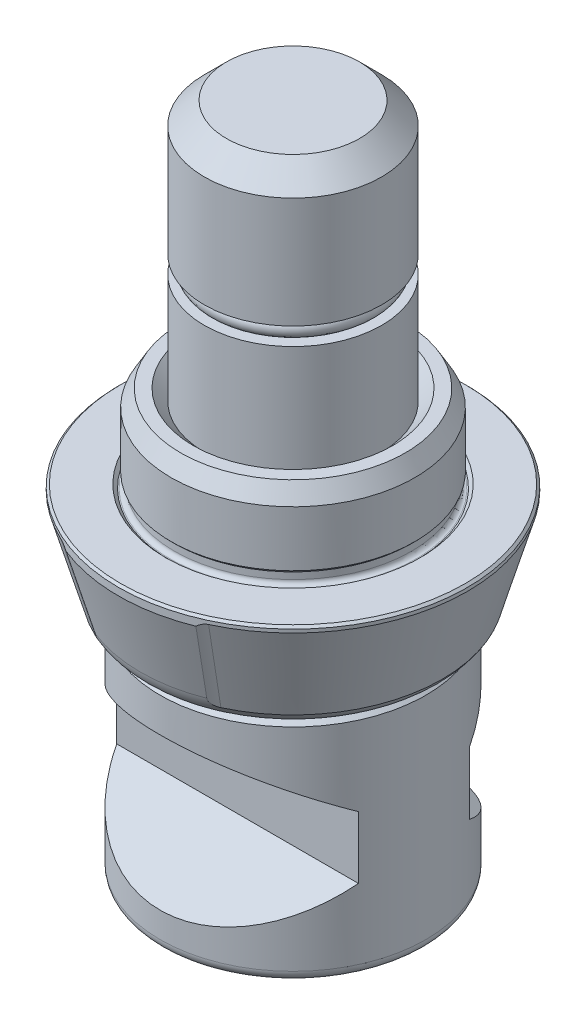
ISO-10303-21;
HEADER;
FILE_DESCRIPTION(('STEP AP214'),'2;1');
FILE_NAME('part.step','',(''),(''),'','','');
FILE_SCHEMA(('AUTOMOTIVE_DESIGN { 1 0 10303 214 1 1 1 1 }'));
ENDSEC;
DATA;
#1=APPLICATION_CONTEXT('core data for automotive mechanical design processes');
#2=APPLICATION_PROTOCOL_DEFINITION('international standard','automotive_design',2000,#1);
#3=PRODUCT_CONTEXT('',#1,'mechanical');
#4=PRODUCT('Part','Part','',(#3));
#5=PRODUCT_RELATED_PRODUCT_CATEGORY('part','',(#4));
#6=PRODUCT_DEFINITION_FORMATION('','',#4);
#7=PRODUCT_DEFINITION_CONTEXT('part definition',#1,'design');
#8=PRODUCT_DEFINITION('design','',#6,#7);
#9=PRODUCT_DEFINITION_SHAPE('','',#8);
#10=(LENGTH_UNIT() NAMED_UNIT(*) SI_UNIT(.MILLI.,.METRE.));
#11=(NAMED_UNIT(*) PLANE_ANGLE_UNIT() SI_UNIT($,.RADIAN.));
#12=(NAMED_UNIT(*) SI_UNIT($,.STERADIAN.) SOLID_ANGLE_UNIT());
#13=UNCERTAINTY_MEASURE_WITH_UNIT(LENGTH_MEASURE(1.E-05),#10,'distance_accuracy_value','');
#14=(GEOMETRIC_REPRESENTATION_CONTEXT(3) GLOBAL_UNCERTAINTY_ASSIGNED_CONTEXT((#13)) GLOBAL_UNIT_ASSIGNED_CONTEXT((#10,
#11,#12)) REPRESENTATION_CONTEXT('',''));
#15=CARTESIAN_POINT('',(0.,0.,0.));
#16=DIRECTION('',(0.,0.,1.));
#17=DIRECTION('',(1.,0.,0.));
#18=AXIS2_PLACEMENT_3D('',#15,#16,#17);
#19=CARTESIAN_POINT('',(-12.,-30.6,15.));
#20=DIRECTION('',(0.,1.,0.));
#21=DIRECTION('',(1.,0.,0.));
#22=AXIS2_PLACEMENT_3D('',#19,#20,#21);
#23=PLANE('',#22);
#24=CARTESIAN_POINT('',(0.,-30.6,0.));
#25=DIRECTION('',(0.,1.,0.));
#26=DIRECTION('',(0.,0.,-1.));
#27=AXIS2_PLACEMENT_3D('',#24,#25,#26);
#28=CIRCLE('',#27,3.75);
#29=CARTESIAN_POINT('',(0.,-30.6,-3.75));
#30=VERTEX_POINT('',#29);
#31=EDGE_CURVE('E356',#30,#30,#28,.T.);
#32=ORIENTED_EDGE('',*,*,#31,.T.);
#33=EDGE_LOOP('',(#32));
#34=FACE_BOUND('',#33,.T.);
#35=CARTESIAN_POINT('',(0.,-30.6,0.));
#36=DIRECTION('',(0.,1.,0.));
#37=DIRECTION('',(1.,0.,0.));
#38=AXIS2_PLACEMENT_3D('',#35,#36,#37);
#39=CIRCLE('',#38,11.);
#40=CARTESIAN_POINT('',(11.,-30.6,0.));
#41=VERTEX_POINT('',#40);
#42=EDGE_CURVE('E502',#41,#41,#39,.F.);
#43=ORIENTED_EDGE('',*,*,#42,.T.);
#44=EDGE_LOOP('',(#43));
#45=FACE_BOUND('',#44,.T.);
#46=DIRECTION('',(0.982188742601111,0.,-0.18789697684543));
#47=VECTOR('',#46,1.);
#48=CARTESIAN_POINT('',(-2.20369531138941,-30.6,-5.16176807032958));
#49=LINE('',#48,#47);
#50=CARTESIAN_POINT('',(-2.20369531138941,-30.6,-5.16176807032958));
#51=VERTEX_POINT('',#50);
#52=CARTESIAN_POINT('',(-1.73404241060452,-30.6,-5.25161471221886));
#53=VERTEX_POINT('',#52);
#54=EDGE_CURVE('E492',#51,#53,#49,.T.);
#55=ORIENTED_EDGE('',*,*,#54,.T.);
#56=DIRECTION('',(-0.186950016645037,0.,-0.982369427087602));
#57=VECTOR('',#56,1.);
#58=CARTESIAN_POINT('',(-1.73404241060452,-30.6,-5.25161471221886));
#59=LINE('',#58,#57);
#60=CARTESIAN_POINT('',(-1.82062190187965,-30.6,-5.70656543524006));
#61=VERTEX_POINT('',#60);
#62=EDGE_CURVE('E489',#53,#61,#59,.T.);
#63=ORIENTED_EDGE('',*,*,#62,.T.);
#64=CARTESIAN_POINT('',(-1.82062190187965,-30.6,-5.70656543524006));
#65=CARTESIAN_POINT('',(-1.75335664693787,-30.6,-5.72383251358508));
#66=CARTESIAN_POINT('',(-1.62301548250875,-30.6,-5.75729125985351));
#67=CARTESIAN_POINT('',(-1.43840151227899,-30.6,-5.82184016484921));
#68=CARTESIAN_POINT('',(-1.26896664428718,-30.6,-5.89200080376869));
#69=CARTESIAN_POINT('',(-1.11680610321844,-30.6,-5.97242058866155));
#70=CARTESIAN_POINT('',(-0.979933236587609,-30.6,-6.05950206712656));
#71=CARTESIAN_POINT('',(-0.860070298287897,-30.6,-6.15587841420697));
#72=CARTESIAN_POINT('',(-0.754419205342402,-30.6,-6.2588980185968));
#73=CARTESIAN_POINT('',(-0.697642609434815,-30.6,-6.33656639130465));
#74=CARTESIAN_POINT('',(-0.669768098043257,-30.6,-6.37469773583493));
#75=B_SPLINE_CURVE_WITH_KNOTS('',3,(#64,#65,#66,#67,#68,#69,#70,#71,#72,#73,#74),.UNSPECIFIED.,
.F.,.F.,(4,1,1,1,1,1,1,1,4),(0.,0.153100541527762,0.296665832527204,0.430945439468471,
0.557190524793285,0.675784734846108,0.788133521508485,0.895983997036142,1.),.UNSPECIFIED.);
#76=CARTESIAN_POINT('',(-0.669768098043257,-30.6,-6.37469773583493));
#77=VERTEX_POINT('',#76);
#78=EDGE_CURVE('E494',#61,#77,#75,.T.);
#79=ORIENTED_EDGE('',*,*,#78,.T.);
#80=CARTESIAN_POINT('',(-0.669768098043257,-30.6,-6.37469773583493));
#81=CARTESIAN_POINT('',(-0.64205179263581,-30.6,-6.41822425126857));
#82=CARTESIAN_POINT('',(-0.587026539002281,-30.6,-6.5046375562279));
#83=CARTESIAN_POINT('',(-0.523028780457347,-30.6,-6.64412982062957));
#84=CARTESIAN_POINT('',(-0.472246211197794,-30.6,-6.78886529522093));
#85=CARTESIAN_POINT('',(-0.438222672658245,-30.6,-6.94046340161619));
#86=CARTESIAN_POINT('',(-0.4197060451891,-30.6,-7.09811494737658));
#87=CARTESIAN_POINT('',(-0.415699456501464,-30.6,-7.26161023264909));
#88=CARTESIAN_POINT('',(-0.427162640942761,-30.6,-7.43139272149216));
#89=CARTESIAN_POINT('',(-0.446087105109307,-30.6,-7.5455533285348));
#90=CARTESIAN_POINT('',(-0.455769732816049,-30.6,-7.60396315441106));
#91=B_SPLINE_CURVE_WITH_KNOTS('',3,(#80,#81,#82,#83,#84,#85,#86,#87,#88,#89,#90),.UNSPECIFIED.,
.F.,.F.,(4,1,1,1,1,1,1,1,4),(0.,0.120661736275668,0.239550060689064,0.358258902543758,
0.479157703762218,0.602392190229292,0.729252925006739,0.861473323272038,1.),.UNSPECIFIED.);
#92=CARTESIAN_POINT('',(-0.455769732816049,-30.6,-7.60396315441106));
#93=VERTEX_POINT('',#92);
#94=EDGE_CURVE('E548',#77,#93,#91,.T.);
#95=ORIENTED_EDGE('',*,*,#94,.T.);
#96=CARTESIAN_POINT('',(-0.455769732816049,-30.6,-7.60396315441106));
#97=CARTESIAN_POINT('',(-0.468060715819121,-30.6,-7.66195221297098));
#98=CARTESIAN_POINT('',(-0.492105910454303,-30.6,-7.77539783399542));
#99=CARTESIAN_POINT('',(-0.545153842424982,-30.6,-7.93755958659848));
#100=CARTESIAN_POINT('',(-0.60868475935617,-30.6,-8.08861642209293));
#101=CARTESIAN_POINT('',(-0.683968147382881,-30.6,-8.22845687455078));
#102=CARTESIAN_POINT('',(-0.771722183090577,-30.6,-8.3567519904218));
#103=CARTESIAN_POINT('',(-0.872051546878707,-30.6,-8.47300153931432));
#104=CARTESIAN_POINT('',(-0.983246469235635,-30.6,-8.57887604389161));
#105=CARTESIAN_POINT('',(-1.0660056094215,-30.6,-8.6389072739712));
#106=CARTESIAN_POINT('',(-1.10756628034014,-30.6,-8.66905425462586));
#107=B_SPLINE_CURVE_WITH_KNOTS('',3,(#96,#97,#98,#99,#100,#101,#102,#103,#104,#105,#106),
.UNSPECIFIED.,.F.,.F.,(4,1,1,1,1,1,1,1,4),(0.,0.13855916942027,0.271067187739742,
0.398330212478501,0.521420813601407,0.641882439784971,0.76109714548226,0.880025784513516,1.),.UNSPECIFIED.);
#108=CARTESIAN_POINT('',(-1.10756628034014,-30.6,-8.66905425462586));
#109=VERTEX_POINT('',#108);
#110=EDGE_CURVE('E541',#93,#109,#107,.T.);
#111=ORIENTED_EDGE('',*,*,#110,.T.);
#112=CARTESIAN_POINT('',(-1.10756628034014,-30.6,-8.66905425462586));
#113=CARTESIAN_POINT('',(-1.147556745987,-30.6,-8.69407569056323));
#114=CARTESIAN_POINT('',(-1.22915044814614,-30.6,-8.74512764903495));
#115=CARTESIAN_POINT('',(-1.36504052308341,-30.6,-8.80295228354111));
#116=CARTESIAN_POINT('',(-1.51240566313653,-30.6,-8.84782068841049));
#117=CARTESIAN_POINT('',(-1.67156586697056,-30.6,-8.87994722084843));
#118=CARTESIAN_POINT('',(-1.84285703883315,-30.6,-8.89578493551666));
#119=CARTESIAN_POINT('',(-2.0259567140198,-30.6,-8.90086518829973));
#120=CARTESIAN_POINT('',(-2.22116480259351,-30.6,-8.89181990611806));
#121=CARTESIAN_POINT('',(-2.35461815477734,-30.6,-8.8752555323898));
#122=CARTESIAN_POINT('',(-2.4234111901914,-30.6,-8.86671686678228));
#123=B_SPLINE_CURVE_WITH_KNOTS('',3,(#112,#113,#114,#115,#116,#117,#118,#119,#120,#121,#122),
.UNSPECIFIED.,.F.,.F.,(4,1,1,1,1,1,1,1,4),(0.,0.103922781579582,0.212036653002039,
0.324495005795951,0.44333245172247,0.569479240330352,0.703450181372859,0.847133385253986,1.),.UNSPECIFIED.);
#124=CARTESIAN_POINT('',(-2.4234111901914,-30.6,-8.86671686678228));
#125=VERTEX_POINT('',#124);
#126=EDGE_CURVE('E537',#109,#125,#123,.T.);
#127=ORIENTED_EDGE('',*,*,#126,.T.);
#128=DIRECTION('',(-0.187533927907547,0.,-0.982258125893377));
#129=VECTOR('',#128,1.);
#130=CARTESIAN_POINT('',(-2.4234111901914,-30.6,-8.86671686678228));
#131=LINE('',#130,#129);
#132=CARTESIAN_POINT('',(-2.54021182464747,-30.6,-9.47849081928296));
#133=VERTEX_POINT('',#132);
#134=EDGE_CURVE('E535',#125,#133,#131,.T.);
#135=ORIENTED_EDGE('',*,*,#134,.T.);
#136=DIRECTION('',(-0.982188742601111,0.,0.187896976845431));
#137=VECTOR('',#136,1.);
#138=CARTESIAN_POINT('',(-2.54021182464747,-30.6,-9.47849081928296));
#139=LINE('',#138,#137);
#140=CARTESIAN_POINT('',(-3.00986472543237,-30.6,-9.38864417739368));
#141=VERTEX_POINT('',#140);
#142=EDGE_CURVE('E533',#133,#141,#139,.T.);
#143=ORIENTED_EDGE('',*,*,#142,.T.);
#144=DIRECTION('',(0.187533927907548,0.,0.982258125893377));
#145=VECTOR('',#144,1.);
#146=CARTESIAN_POINT('',(-3.00986472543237,-30.6,-9.38864417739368));
#147=LINE('',#146,#145);
#148=CARTESIAN_POINT('',(-2.89306409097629,-30.6,-8.776870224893));
#149=VERTEX_POINT('',#148);
#150=EDGE_CURVE('E528',#141,#149,#147,.T.);
#151=ORIENTED_EDGE('',*,*,#150,.T.);
#152=CARTESIAN_POINT('',(-2.89306409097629,-30.6,-8.776870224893));
#153=CARTESIAN_POINT('',(-2.9583892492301,-30.6,-8.75977334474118));
#154=CARTESIAN_POINT('',(-3.08478903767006,-30.6,-8.72669203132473));
#155=CARTESIAN_POINT('',(-3.26415631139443,-30.6,-8.66443506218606));
#156=CARTESIAN_POINT('',(-3.42767514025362,-30.6,-8.59399365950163));
#157=CARTESIAN_POINT('',(-3.57626051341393,-30.6,-8.51629286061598));
#158=CARTESIAN_POINT('',(-3.70818743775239,-30.6,-8.42858905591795));
#159=CARTESIAN_POINT('',(-3.82475100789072,-30.6,-8.33338131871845));
#160=CARTESIAN_POINT('',(-3.92560069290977,-30.6,-8.229696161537));
#161=CARTESIAN_POINT('',(-3.98081184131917,-30.6,-8.15300778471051));
#162=CARTESIAN_POINT('',(-4.00797923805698,-30.6,-8.11527222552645));
#163=B_SPLINE_CURVE_WITH_KNOTS('',3,(#152,#153,#154,#155,#156,#157,#158,#159,#160,#161,#162),
.UNSPECIFIED.,.F.,.F.,(4,1,1,1,1,1,1,1,4),(0.,0.152672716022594,0.295411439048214,
0.428898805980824,0.555055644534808,0.674088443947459,0.786514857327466,0.894951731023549,1.),.UNSPECIFIED.);
#164=CARTESIAN_POINT('',(-4.00797923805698,-30.6,-8.11527222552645));
#165=VERTEX_POINT('',#164);
#166=EDGE_CURVE('E521',#149,#165,#163,.T.);
#167=ORIENTED_EDGE('',*,*,#166,.T.);
#168=CARTESIAN_POINT('',(-4.00797923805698,-30.6,-8.11527222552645));
#169=CARTESIAN_POINT('',(-4.03568716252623,-30.6,-8.07174297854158));
#170=CARTESIAN_POINT('',(-4.09069577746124,-30.6,-7.98532425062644));
#171=CARTESIAN_POINT('',(-4.15492466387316,-30.6,-7.84563772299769));
#172=CARTESIAN_POINT('',(-4.20520008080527,-30.6,-7.70074342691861));
#173=CARTESIAN_POINT('',(-4.23965910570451,-30.6,-7.54926898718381));
#174=CARTESIAN_POINT('',(-4.25804347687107,-30.6,-7.39157665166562));
#175=CARTESIAN_POINT('',(-4.26205850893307,-30.6,-7.22781685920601));
#176=CARTESIAN_POINT('',(-4.25058676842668,-30.6,-7.05775995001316));
#177=CARTESIAN_POINT('',(-4.23166093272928,-30.6,-6.94359967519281));
#178=CARTESIAN_POINT('',(-4.22197760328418,-30.6,-6.88519001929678));
#179=B_SPLINE_CURVE_WITH_KNOTS('',3,(#168,#169,#170,#171,#172,#173,#174,#175,#176,#177,#178),
.UNSPECIFIED.,.F.,.F.,(4,1,1,1,1,1,1,1,4),(0.,0.120587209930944,0.239402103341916,
0.358639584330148,0.478842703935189,0.602001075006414,0.729420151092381,0.861558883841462,1.),.UNSPECIFIED.);
#180=CARTESIAN_POINT('',(-4.22197760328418,-30.6,-6.88519001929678));
#181=VERTEX_POINT('',#180);
#182=EDGE_CURVE('E514',#165,#181,#179,.T.);
#183=ORIENTED_EDGE('',*,*,#182,.T.);
#184=CARTESIAN_POINT('',(-4.22197760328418,-30.6,-6.88519001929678));
#185=CARTESIAN_POINT('',(-4.20963442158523,-30.6,-6.82721671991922));
#186=CARTESIAN_POINT('',(-4.18555847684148,-30.6,-6.71413712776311));
#187=CARTESIAN_POINT('',(-4.13339606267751,-30.6,-6.55206875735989));
#188=CARTESIAN_POINT('',(-4.07000537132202,-30.6,-6.40113080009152));
#189=CARTESIAN_POINT('',(-3.99368237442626,-30.6,-6.26170269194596));
#190=CARTESIAN_POINT('',(-3.90601736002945,-30.6,-6.13347130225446));
#191=CARTESIAN_POINT('',(-3.80652478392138,-30.6,-6.01673022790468));
#192=CARTESIAN_POINT('',(-3.69519326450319,-30.6,-5.91088182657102));
#193=CARTESIAN_POINT('',(-3.61203162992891,-30.6,-5.85103383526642));
#194=CARTESIAN_POINT('',(-3.5701810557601,-30.6,-5.82091570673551));
#195=B_SPLINE_CURVE_WITH_KNOTS('',3,(#184,#185,#186,#187,#188,#189,#190,#191,#192,#193,#194),
.UNSPECIFIED.,.F.,.F.,(4,1,1,1,1,1,1,1,4),(0.,0.138615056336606,0.270375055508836,
0.397689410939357,0.521134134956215,0.641644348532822,0.760492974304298,0.879469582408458,1.),.UNSPECIFIED.);
#196=CARTESIAN_POINT('',(-3.5701810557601,-30.6,-5.82091570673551));
#197=VERTEX_POINT('',#196);
#198=EDGE_CURVE('E507',#181,#197,#195,.T.);
#199=ORIENTED_EDGE('',*,*,#198,.T.);
#200=CARTESIAN_POINT('',(-3.5701810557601,-30.6,-5.82091570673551));
#201=CARTESIAN_POINT('',(-3.53103657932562,-30.6,-5.79559123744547));
#202=CARTESIAN_POINT('',(-3.45172536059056,-30.6,-5.74428094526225));
#203=CARTESIAN_POINT('',(-3.31916986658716,-30.6,-5.68646319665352));
#204=CARTESIAN_POINT('',(-3.17620983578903,-30.6,-5.64002338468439));
#205=CARTESIAN_POINT('',(-3.02097411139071,-30.6,-5.60935342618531));
#206=CARTESIAN_POINT('',(-2.85470879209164,-30.6,-5.58906853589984));
#207=CARTESIAN_POINT('',(-2.67654458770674,-30.6,-5.58548002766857));
#208=CARTESIAN_POINT('',(-2.48687535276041,-30.6,-5.5932884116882));
#209=CARTESIAN_POINT('',(-2.35717448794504,-30.6,-5.60874584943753));
#210=CARTESIAN_POINT('',(-2.29027480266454,-30.6,-5.61671879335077));
#211=B_SPLINE_CURVE_WITH_KNOTS('',3,(#200,#201,#202,#203,#204,#205,#206,#207,#208,#209,#210),
.UNSPECIFIED.,.F.,.F.,(4,1,1,1,1,1,1,1,4),(0.,0.10533404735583,0.213418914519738,
0.326022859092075,0.444905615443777,0.570830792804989,0.704560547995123,0.847612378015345,1.),.UNSPECIFIED.);
#212=CARTESIAN_POINT('',(-2.29027480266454,-30.6,-5.61671879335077));
#213=VERTEX_POINT('',#212);
#214=EDGE_CURVE('E500',#197,#213,#211,.T.);
#215=ORIENTED_EDGE('',*,*,#214,.T.);
#216=DIRECTION('',(0.186950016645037,0.,0.982369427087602));
#217=VECTOR('',#216,1.);
#218=CARTESIAN_POINT('',(-2.29027480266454,-30.6,-5.61671879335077));
#219=LINE('',#218,#217);
#220=EDGE_CURVE('E499',#213,#51,#219,.T.);
#221=ORIENTED_EDGE('',*,*,#220,.T.);
#222=EDGE_LOOP('',(#55,#63,#79,#95,#111,#127,#135,#143,#151,#167,#183,#199,#215,#221));
#223=FACE_BOUND('',#222,.T.);
#224=CARTESIAN_POINT('',(0.809820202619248,-30.6,-6.56377433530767));
#225=CARTESIAN_POINT('',(0.792272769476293,-30.6,-6.58674517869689));
#226=CARTESIAN_POINT('',(0.756509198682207,-30.6,-6.6335622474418));
#227=CARTESIAN_POINT('',(0.714621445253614,-30.6,-6.71344242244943));
#228=CARTESIAN_POINT('',(0.681168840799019,-30.6,-6.80132306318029));
#229=CARTESIAN_POINT('',(0.654643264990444,-30.6,-6.89663348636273));
#230=CARTESIAN_POINT('',(0.639303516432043,-30.6,-7.00086239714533));
#231=CARTESIAN_POINT('',(0.629987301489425,-30.6,-7.11272478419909));
#232=CARTESIAN_POINT('',(0.630355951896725,-30.6,-7.23316577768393));
#233=CARTESIAN_POINT('',(0.636666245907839,-30.6,-7.31579388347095));
#234=CARTESIAN_POINT('',(0.639928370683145,-30.6,-7.35850872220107));
#235=B_SPLINE_CURVE_WITH_KNOTS('',3,(#224,#225,#226,#227,#228,#229,#230,#231,#232,#233,#234),
.UNSPECIFIED.,.F.,.F.,(4,1,1,1,1,1,1,1,4),(0.,0.10390292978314,0.211765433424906,
0.323150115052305,0.442026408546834,0.567057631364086,0.701755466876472,0.845821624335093,1.),.UNSPECIFIED.);
#236=CARTESIAN_POINT('',(0.809820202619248,-30.6,-6.56377433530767));
#237=VERTEX_POINT('',#236);
#238=CARTESIAN_POINT('',(0.639928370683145,-30.6,-7.35850872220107));
#239=VERTEX_POINT('',#238);
#240=EDGE_CURVE('E621',#237,#239,#235,.T.);
#241=ORIENTED_EDGE('',*,*,#240,.T.);
#242=DIRECTION('',(-0.995517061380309,0.,-0.0945821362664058));
#243=VECTOR('',#242,1.);
#244=CARTESIAN_POINT('',(0.639928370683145,-30.6,-7.35850872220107));
#245=LINE('',#244,#243);
#246=CARTESIAN_POINT('',(0.132703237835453,-30.6,-7.40669919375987));
#247=VERTEX_POINT('',#246);
#248=EDGE_CURVE('E732',#239,#247,#245,.T.);
#249=ORIENTED_EDGE('',*,*,#248,.T.);
#250=CARTESIAN_POINT('',(0.132703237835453,-30.6,-7.40669919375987));
#251=CARTESIAN_POINT('',(0.128650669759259,-30.6,-7.35119343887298));
#252=CARTESIAN_POINT('',(0.120790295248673,-30.6,-7.24353429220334));
#253=CARTESIAN_POINT('',(0.122254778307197,-30.6,-7.0859065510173));
#254=CARTESIAN_POINT('',(0.136110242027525,-30.6,-6.93786435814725));
#255=CARTESIAN_POINT('',(0.160687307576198,-30.6,-6.7986100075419));
#256=CARTESIAN_POINT('',(0.199587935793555,-30.6,-6.6690540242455));
#257=CARTESIAN_POINT('',(0.249131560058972,-30.6,-6.54822732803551));
#258=CARTESIAN_POINT('',(0.311291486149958,-30.6,-6.43668122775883));
#259=CARTESIAN_POINT('',(0.362218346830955,-30.6,-6.36990892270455));
#260=CARTESIAN_POINT('',(0.387540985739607,-30.6,-6.33670736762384));
#261=B_SPLINE_CURVE_WITH_KNOTS('',3,(#250,#251,#252,#253,#254,#255,#256,#257,#258,#259,#260),
.UNSPECIFIED.,.F.,.F.,(4,1,1,1,1,1,1,1,4),(0.,0.147854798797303,0.286779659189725,
0.418314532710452,0.542630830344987,0.66189884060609,0.777051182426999,0.889141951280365,1.),.UNSPECIFIED.);
#262=CARTESIAN_POINT('',(0.387540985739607,-30.6,-6.33670736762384));
#263=VERTEX_POINT('',#262);
#264=EDGE_CURVE('E725',#247,#263,#261,.T.);
#265=ORIENTED_EDGE('',*,*,#264,.T.);
#266=CARTESIAN_POINT('',(0.387540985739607,-30.6,-6.33670736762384));
#267=CARTESIAN_POINT('',(0.409396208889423,-30.6,-6.31148926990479));
#268=CARTESIAN_POINT('',(0.452338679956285,-30.6,-6.26193921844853));
#269=CARTESIAN_POINT('',(0.524010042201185,-30.6,-6.19613485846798));
#270=CARTESIAN_POINT('',(0.60039965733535,-30.6,-6.13966281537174));
#271=CARTESIAN_POINT('',(0.68078927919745,-30.6,-6.09121351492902));
#272=CARTESIAN_POINT('',(0.765175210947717,-30.6,-6.0508554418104));
#273=CARTESIAN_POINT('',(0.854152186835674,-30.6,-6.01964230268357));
#274=CARTESIAN_POINT('',(0.947572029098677,-30.6,-5.99747800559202));
#275=CARTESIAN_POINT('',(1.01174093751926,-30.6,-5.98951925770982));
#276=CARTESIAN_POINT('',(1.04423825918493,-30.6,-5.98548867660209));
#277=B_SPLINE_CURVE_WITH_KNOTS('',3,(#266,#267,#268,#269,#270,#271,#272,#273,#274,#275,#276),
.UNSPECIFIED.,.F.,.F.,(4,1,1,1,1,1,1,1,4),(0.,0.130760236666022,0.256925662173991,
0.380540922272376,0.50264904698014,0.624406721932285,0.746622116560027,0.871680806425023,1.),.UNSPECIFIED.);
#278=CARTESIAN_POINT('',(1.04423825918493,-30.6,-5.98548867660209));
#279=VERTEX_POINT('',#278);
#280=EDGE_CURVE('E718',#263,#279,#277,.T.);
#281=ORIENTED_EDGE('',*,*,#280,.T.);
#282=CARTESIAN_POINT('',(1.04423825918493,-30.6,-5.98548867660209));
#283=CARTESIAN_POINT('',(1.08369278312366,-30.6,-5.98268972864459));
#284=CARTESIAN_POINT('',(1.16092059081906,-30.6,-5.9772111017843));
#285=CARTESIAN_POINT('',(1.27463901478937,-30.6,-5.97964319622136));
#286=CARTESIAN_POINT('',(1.38296281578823,-30.6,-5.99167628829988));
#287=CARTESIAN_POINT('',(1.48591107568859,-30.6,-6.01373262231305));
#288=CARTESIAN_POINT('',(1.58347529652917,-30.6,-6.04590076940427));
#289=CARTESIAN_POINT('',(1.67626174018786,-30.6,-6.08660772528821));
#290=CARTESIAN_POINT('',(1.76349746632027,-30.6,-6.1372753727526));
#291=CARTESIAN_POINT('',(1.81652225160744,-30.6,-6.17819400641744));
#292=CARTESIAN_POINT('',(1.84305658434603,-30.6,-6.19867025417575));
#293=B_SPLINE_CURVE_WITH_KNOTS('',3,(#282,#283,#284,#285,#286,#287,#288,#289,#290,#291,#292),
.UNSPECIFIED.,.F.,.F.,(4,1,1,1,1,1,1,1,4),(0.,0.139690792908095,0.273429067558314,
0.401219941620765,0.524233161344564,0.64469251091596,0.763555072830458,0.881679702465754,1.),.UNSPECIFIED.);
#294=CARTESIAN_POINT('',(1.84305658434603,-30.6,-6.19867025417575));
#295=VERTEX_POINT('',#294);
#296=EDGE_CURVE('E711',#279,#295,#293,.T.);
#297=ORIENTED_EDGE('',*,*,#296,.T.);
#298=CARTESIAN_POINT('',(1.84305658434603,-30.6,-6.19867025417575));
#299=CARTESIAN_POINT('',(1.86828799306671,-30.6,-6.22079276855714));
#300=CARTESIAN_POINT('',(1.91788262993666,-30.6,-6.26427658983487));
#301=CARTESIAN_POINT('',(1.98379791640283,-30.6,-6.33714960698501));
#302=CARTESIAN_POINT('',(2.04122871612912,-30.6,-6.41472243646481));
#303=CARTESIAN_POINT('',(2.08956648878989,-30.6,-6.49789438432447));
#304=CARTESIAN_POINT('',(2.12975921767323,-30.6,-6.58571618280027));
#305=CARTESIAN_POINT('',(2.16172609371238,-30.6,-6.67836468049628));
#306=CARTESIAN_POINT('',(2.18501380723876,-30.6,-6.77604683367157));
#307=CARTESIAN_POINT('',(2.1927810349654,-30.6,-6.84327753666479));
#308=CARTESIAN_POINT('',(2.19672563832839,-30.6,-6.87742079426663));
#309=B_SPLINE_CURVE_WITH_KNOTS('',3,(#298,#299,#300,#301,#302,#303,#304,#305,#306,#307,#308),
.UNSPECIFIED.,.F.,.F.,(4,1,1,1,1,1,1,1,4),(0.,0.127939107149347,0.251475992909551,
0.374052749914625,0.495555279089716,0.617801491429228,0.741974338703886,0.868961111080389,1.),.UNSPECIFIED.);
#310=CARTESIAN_POINT('',(2.19672563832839,-30.6,-6.87742079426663));
#311=VERTEX_POINT('',#310);
#312=EDGE_CURVE('E704',#295,#311,#309,.T.);
#313=ORIENTED_EDGE('',*,*,#312,.T.);
#314=CARTESIAN_POINT('',(2.19672563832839,-30.6,-6.87742079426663));
#315=CARTESIAN_POINT('',(2.200036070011,-30.6,-6.92096178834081));
#316=CARTESIAN_POINT('',(2.20657073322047,-30.6,-7.00691001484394));
#317=CARTESIAN_POINT('',(2.20133898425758,-30.6,-7.13504961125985));
#318=CARTESIAN_POINT('',(2.18844566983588,-30.6,-7.26009980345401));
#319=CARTESIAN_POINT('',(2.1623779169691,-30.6,-7.38188314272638));
#320=CARTESIAN_POINT('',(2.12679903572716,-30.6,-7.50040148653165));
#321=CARTESIAN_POINT('',(2.07944804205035,-30.6,-7.6154847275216));
#322=CARTESIAN_POINT('',(2.02270462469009,-30.6,-7.72792181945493));
#323=CARTESIAN_POINT('',(1.97659495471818,-30.6,-7.79888171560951));
#324=CARTESIAN_POINT('',(1.95332291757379,-30.6,-7.83469592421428));
#325=B_SPLINE_CURVE_WITH_KNOTS('',3,(#314,#315,#316,#317,#318,#319,#320,#321,#322,#323,#324),
.UNSPECIFIED.,.F.,.F.,(4,1,1,1,1,1,1,1,4),(0.,0.12978098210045,0.256182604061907,
0.380852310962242,0.503311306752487,0.626027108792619,0.748443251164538,0.87303665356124,1.),.UNSPECIFIED.);
#326=CARTESIAN_POINT('',(1.95332291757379,-30.6,-7.83469592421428));
#327=VERTEX_POINT('',#326);
#328=EDGE_CURVE('E697',#311,#327,#325,.T.);
#329=ORIENTED_EDGE('',*,*,#328,.T.);
#330=CARTESIAN_POINT('',(1.95332291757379,-30.6,-7.83469592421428));
#331=CARTESIAN_POINT('',(1.86130228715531,-30.6,-7.9686241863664));
#332=CARTESIAN_POINT('',(1.67752758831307,-30.6,-8.23609275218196));
#333=CARTESIAN_POINT('',(1.4806729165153,-30.6,-8.49408632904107));
#334=CARTESIAN_POINT('',(1.38238834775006,-30.6,-8.62289600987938));
#335=B_SPLINE_CURVE_WITH_KNOTS('',3,(#330,#331,#332,#333,#334),.UNSPECIFIED.,.F.,.F.,(4,1,4),
(0.,0.50072524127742,1.),.UNSPECIFIED.);
#336=CARTESIAN_POINT('',(1.38238834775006,-30.6,-8.62289600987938));
#337=VERTEX_POINT('',#336);
#338=EDGE_CURVE('E690',#327,#337,#335,.T.);
#339=ORIENTED_EDGE('',*,*,#338,.T.);
#340=CARTESIAN_POINT('',(1.38238834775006,-30.6,-8.62289600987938));
#341=CARTESIAN_POINT('',(1.32987420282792,-30.6,-8.69479714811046));
#342=CARTESIAN_POINT('',(1.22497546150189,-30.6,-8.83842204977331));
#343=CARTESIAN_POINT('',(1.11968735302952,-30.6,-8.98176175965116));
#344=CARTESIAN_POINT('',(1.06710831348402,-30.6,-9.0533431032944));
#345=B_SPLINE_CURVE_WITH_KNOTS('',3,(#340,#341,#342,#343,#344),.UNSPECIFIED.,.F.,.F.,(4,1,4),
(0.,0.500617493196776,1.),.UNSPECIFIED.);
#346=CARTESIAN_POINT('',(1.06710831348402,-30.6,-9.0533431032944));
#347=VERTEX_POINT('',#346);
#348=EDGE_CURVE('E683',#337,#347,#345,.T.);
#349=ORIENTED_EDGE('',*,*,#348,.T.);
#350=CARTESIAN_POINT('',(1.06710831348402,-30.6,-9.0533431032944));
#351=CARTESIAN_POINT('',(1.0235808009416,-30.6,-9.11597149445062));
#352=CARTESIAN_POINT('',(0.939112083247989,-30.6,-9.23750703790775));
#353=CARTESIAN_POINT('',(0.869633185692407,-30.6,-9.36817987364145));
#354=CARTESIAN_POINT('',(0.835957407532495,-30.6,-9.43151578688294));
#355=B_SPLINE_CURVE_WITH_KNOTS('',3,(#350,#351,#352,#353,#354),.UNSPECIFIED.,.F.,.F.,(4,1,4),
(0.,0.515309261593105,1.),.UNSPECIFIED.);
#356=CARTESIAN_POINT('',(0.835957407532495,-30.6,-9.43151578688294));
#357=VERTEX_POINT('',#356);
#358=EDGE_CURVE('E679',#347,#357,#355,.T.);
#359=ORIENTED_EDGE('',*,*,#358,.T.);
#360=DIRECTION('',(0.995535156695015,0.,0.0943914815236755));
#361=VECTOR('',#360,1.);
#362=CARTESIAN_POINT('',(0.835957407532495,-30.6,-9.43151578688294));
#363=LINE('',#362,#361);
#364=CARTESIAN_POINT('',(2.48995240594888,-30.6,-9.27469255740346));
#365=VERTEX_POINT('',#364);
#366=EDGE_CURVE('E677',#357,#365,#363,.T.);
#367=ORIENTED_EDGE('',*,*,#366,.T.);
#368=DIRECTION('',(0.0935217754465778,0.,-0.995617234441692));
#369=VECTOR('',#368,1.);
#370=CARTESIAN_POINT('',(2.48995240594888,-30.6,-9.27469255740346));
#371=LINE('',#370,#369);
#372=CARTESIAN_POINT('',(2.52915821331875,-30.6,-9.69207104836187));
#373=VERTEX_POINT('',#372);
#374=EDGE_CURVE('E675',#365,#373,#371,.T.);
#375=ORIENTED_EDGE('',*,*,#374,.T.);
#376=DIRECTION('',(-0.995539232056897,0.,-0.0943484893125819));
#377=VECTOR('',#376,1.);
#378=CARTESIAN_POINT('',(2.52915821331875,-30.6,-9.69207104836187));
#379=LINE('',#378,#377);
#380=CARTESIAN_POINT('',(0.279725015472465,-30.6,-9.90525262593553));
#381=VERTEX_POINT('',#380);
#382=EDGE_CURVE('E673',#373,#381,#379,.T.);
#383=ORIENTED_EDGE('',*,*,#382,.T.);
#384=DIRECTION('',(-0.0936781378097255,0.,0.995602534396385));
#385=VECTOR('',#384,1.);
#386=CARTESIAN_POINT('',(0.279725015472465,-30.6,-9.90525262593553));
#387=LINE('',#386,#385);
#388=CARTESIAN_POINT('',(0.24460314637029,-30.6,-9.53198066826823));
#389=VERTEX_POINT('',#388);
#390=EDGE_CURVE('E668',#381,#389,#387,.T.);
#391=ORIENTED_EDGE('',*,*,#390,.T.);
#392=CARTESIAN_POINT('',(0.24460314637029,-30.6,-9.53198066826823));
#393=CARTESIAN_POINT('',(0.247370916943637,-30.6,-9.51200040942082));
#394=CARTESIAN_POINT('',(0.253252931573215,-30.6,-9.4695387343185));
#395=CARTESIAN_POINT('',(0.273462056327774,-30.6,-9.40396920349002));
#396=CARTESIAN_POINT('',(0.300465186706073,-30.6,-9.33197727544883));
#397=CARTESIAN_POINT('',(0.336019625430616,-30.6,-9.25359287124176));
#398=CARTESIAN_POINT('',(0.379352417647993,-30.6,-9.16840677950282));
#399=CARTESIAN_POINT('',(0.432119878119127,-30.6,-9.07726534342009));
#400=CARTESIAN_POINT('',(0.492188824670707,-30.6,-8.97903538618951));
#401=CARTESIAN_POINT('',(0.537257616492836,-30.6,-8.91293328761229));
#402=CARTESIAN_POINT('',(0.560699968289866,-30.6,-8.87855054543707));
#403=B_SPLINE_CURVE_WITH_KNOTS('',3,(#392,#393,#394,#395,#396,#397,#398,#399,#400,#401,#402),
.UNSPECIFIED.,.F.,.F.,(4,1,1,1,1,1,1,1,4),(0.,0.0825740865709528,0.175484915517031,
0.280387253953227,0.397797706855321,0.528084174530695,0.672066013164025,0.829426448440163,1.),.UNSPECIFIED.);
#404=CARTESIAN_POINT('',(0.560699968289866,-30.6,-8.87855054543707));
#405=VERTEX_POINT('',#404);
#406=EDGE_CURVE('E661',#389,#405,#403,.T.);
#407=ORIENTED_EDGE('',*,*,#406,.T.);
#408=CARTESIAN_POINT('',(0.560699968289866,-30.6,-8.87855054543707));
#409=CARTESIAN_POINT('',(0.600910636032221,-30.6,-8.82566741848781));
#410=CARTESIAN_POINT('',(0.679553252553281,-30.6,-8.72224044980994));
#411=CARTESIAN_POINT('',(0.796328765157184,-30.6,-8.57160716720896));
#412=CARTESIAN_POINT('',(0.904978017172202,-30.6,-8.42574278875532));
#413=CARTESIAN_POINT('',(1.00980247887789,-30.6,-8.28832541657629));
#414=CARTESIAN_POINT('',(1.10814012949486,-30.6,-8.15692590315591));
#415=CARTESIAN_POINT('',(1.2008278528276,-30.6,-8.03238755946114));
#416=CARTESIAN_POINT('',(1.28852329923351,-30.6,-7.9147184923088));
#417=CARTESIAN_POINT('',(1.34458977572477,-30.6,-7.83826926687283));
#418=CARTESIAN_POINT('',(1.37177010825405,-30.6,-7.80120763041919));
#419=B_SPLINE_CURVE_WITH_KNOTS('',3,(#408,#409,#410,#411,#412,#413,#414,#415,#416,#417,#418),
.UNSPECIFIED.,.F.,.F.,(4,1,1,1,1,1,1,1,4),(0.,0.147790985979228,0.28904443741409,
0.423990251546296,0.552395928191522,0.673532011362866,0.789096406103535,0.897756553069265,1.),.UNSPECIFIED.);
#420=CARTESIAN_POINT('',(1.37177010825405,-30.6,-7.80120763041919));
#421=VERTEX_POINT('',#420);
#422=EDGE_CURVE('E654',#405,#421,#419,.T.);
#423=ORIENTED_EDGE('',*,*,#422,.T.);
#424=CARTESIAN_POINT('',(1.37177010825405,-30.6,-7.80120763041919));
#425=CARTESIAN_POINT('',(1.39852497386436,-30.6,-7.76542229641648));
#426=CARTESIAN_POINT('',(1.45068033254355,-30.6,-7.69566313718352));
#427=CARTESIAN_POINT('',(1.51680580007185,-30.6,-7.58630251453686));
#428=CARTESIAN_POINT('',(1.57197815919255,-30.6,-7.47745758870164));
#429=CARTESIAN_POINT('',(1.61591842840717,-30.6,-7.368345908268));
#430=CARTESIAN_POINT('',(1.6473209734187,-30.6,-7.25829896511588));
#431=CARTESIAN_POINT('',(1.66577179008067,-30.6,-7.14790046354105));
#432=CARTESIAN_POINT('',(1.67398149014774,-30.6,-7.0372837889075));
#433=CARTESIAN_POINT('',(1.66962958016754,-30.6,-6.96399618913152));
#434=CARTESIAN_POINT('',(1.66744723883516,-30.6,-6.9272448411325));
#435=B_SPLINE_CURVE_WITH_KNOTS('',3,(#424,#425,#426,#427,#428,#429,#430,#431,#432,#433,#434),
.UNSPECIFIED.,.F.,.F.,(4,1,1,1,1,1,1,1,4),(0.,0.141712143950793,0.276250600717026,
0.404913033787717,0.528606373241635,0.648941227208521,0.767255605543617,0.883286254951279,1.),.UNSPECIFIED.);
#436=CARTESIAN_POINT('',(1.66744723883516,-30.6,-6.9272448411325));
#437=VERTEX_POINT('',#436);
#438=EDGE_CURVE('E647',#421,#437,#435,.T.);
#439=ORIENTED_EDGE('',*,*,#438,.T.);
#440=CARTESIAN_POINT('',(1.66744723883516,-30.6,-6.9272448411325));
#441=CARTESIAN_POINT('',(1.66481485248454,-30.6,-6.90568032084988));
#442=CARTESIAN_POINT('',(1.65964445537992,-30.6,-6.86332440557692));
#443=CARTESIAN_POINT('',(1.64579807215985,-30.6,-6.80166028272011));
#444=CARTESIAN_POINT('',(1.62594637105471,-30.6,-6.74353818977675));
#445=CARTESIAN_POINT('',(1.60154034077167,-30.6,-6.68831344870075));
#446=CARTESIAN_POINT('',(1.57130739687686,-30.6,-6.63684173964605));
#447=CARTESIAN_POINT('',(1.53544600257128,-30.6,-6.5891596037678));
#448=CARTESIAN_POINT('',(1.49568810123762,-30.6,-6.54358382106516));
#449=CARTESIAN_POINT('',(1.46494875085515,-30.6,-6.51687335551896));
#450=CARTESIAN_POINT('',(1.44936493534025,-30.6,-6.50333204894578));
#451=B_SPLINE_CURVE_WITH_KNOTS('',3,(#440,#441,#442,#443,#444,#445,#446,#447,#448,#449,#450),
.UNSPECIFIED.,.F.,.F.,(4,1,1,1,1,1,1,1,4),(0.,0.13300602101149,0.261243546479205,
0.386219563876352,0.508632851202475,0.630465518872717,0.750863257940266,0.873696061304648,1.),.UNSPECIFIED.);
#452=CARTESIAN_POINT('',(1.44936493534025,-30.6,-6.50333204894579));
#453=VERTEX_POINT('',#452);
#454=EDGE_CURVE('E640',#437,#453,#451,.T.);
#455=ORIENTED_EDGE('',*,*,#454,.T.);
#456=CARTESIAN_POINT('',(1.44936493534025,-30.6,-6.50333204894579));
#457=CARTESIAN_POINT('',(1.42475102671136,-30.6,-6.48495362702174));
#458=CARTESIAN_POINT('',(1.37625185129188,-30.6,-6.44874083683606));
#459=CARTESIAN_POINT('',(1.29082145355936,-30.6,-6.41570838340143));
#460=CARTESIAN_POINT('',(1.19993329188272,-30.6,-6.3971881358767));
#461=CARTESIAN_POINT('',(1.13743249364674,-30.6,-6.40040612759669));
#462=CARTESIAN_POINT('',(1.10549733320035,-30.6,-6.40205037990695));
#463=B_SPLINE_CURVE_WITH_KNOTS('',3,(#456,#457,#458,#459,#460,#461,#462),.UNSPECIFIED.,.F.,.F.,
(4,1,1,1,4),(0.,0.249441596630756,0.491499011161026,0.740178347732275,1.),.UNSPECIFIED.);
#464=CARTESIAN_POINT('',(1.10549733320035,-30.6,-6.40205037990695));
#465=VERTEX_POINT('',#464);
#466=EDGE_CURVE('E633',#453,#465,#463,.T.);
#467=ORIENTED_EDGE('',*,*,#466,.T.);
#468=CARTESIAN_POINT('',(1.10549733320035,-30.6,-6.40205037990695));
#469=CARTESIAN_POINT('',(1.07684726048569,-30.6,-6.40623051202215));
#470=CARTESIAN_POINT('',(1.02031215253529,-30.6,-6.4144791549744));
#471=CARTESIAN_POINT('',(0.941425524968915,-30.6,-6.44899833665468));
#472=CARTESIAN_POINT('',(0.869023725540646,-30.6,-6.49760240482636));
#473=CARTESIAN_POINT('',(0.8299206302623,-30.6,-6.54130803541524));
#474=CARTESIAN_POINT('',(0.809820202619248,-30.6,-6.56377433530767));
#475=B_SPLINE_CURVE_WITH_KNOTS('',3,(#468,#469,#470,#471,#472,#473,#474),.UNSPECIFIED.,.F.,.F.,
(4,1,1,1,4),(0.,0.25001689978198,0.49335764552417,0.739567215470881,1.),.UNSPECIFIED.);
#476=EDGE_CURVE('E626',#465,#237,#475,.T.);
#477=ORIENTED_EDGE('',*,*,#476,.T.);
#478=EDGE_LOOP('',(#241,#249,#265,#281,#297,#313,#329,#339,#349,#359,#367,#375,#383,#391,#407,
#423,#439,#455,#467,#477));
#479=FACE_BOUND('',#478,.T.);
#480=CARTESIAN_POINT('',(2.95753036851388,-30.6,-6.21395586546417));
#481=CARTESIAN_POINT('',(2.94446193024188,-30.6,-6.23975688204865));
#482=CARTESIAN_POINT('',(2.91798138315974,-30.6,-6.29203742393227));
#483=CARTESIAN_POINT('',(2.89277428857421,-30.6,-6.37864400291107));
#484=CARTESIAN_POINT('',(2.87554642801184,-30.6,-6.47081381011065));
#485=CARTESIAN_POINT('',(2.8681501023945,-30.6,-6.56971728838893));
#486=CARTESIAN_POINT('',(2.8723790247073,-30.6,-6.67464937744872));
#487=CARTESIAN_POINT('',(2.88433222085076,-30.6,-6.78617087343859));
#488=CARTESIAN_POINT('',(2.90784648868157,-30.6,-6.90391786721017));
#489=CARTESIAN_POINT('',(2.92929325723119,-30.6,-6.98376020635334));
#490=CARTESIAN_POINT('',(2.94037782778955,-30.6,-7.02502600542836));
#491=B_SPLINE_CURVE_WITH_KNOTS('',3,(#480,#481,#482,#483,#484,#485,#486,#487,#488,#489,#490),
.UNSPECIFIED.,.F.,.F.,(4,1,1,1,1,1,1,1,4),(0.,0.104086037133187,0.210909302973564,
0.323743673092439,0.44188158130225,0.567603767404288,0.701928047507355,0.845944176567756,1.),.UNSPECIFIED.);
#492=CARTESIAN_POINT('',(2.95753036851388,-30.6,-6.21395586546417));
#493=VERTEX_POINT('',#492);
#494=CARTESIAN_POINT('',(2.94037782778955,-30.6,-7.02502600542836));
#495=VERTEX_POINT('',#494);
#496=EDGE_CURVE('E737',#493,#495,#491,.T.);
#497=ORIENTED_EDGE('',*,*,#496,.T.);
#498=DIRECTION('',(-0.960179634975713,0.,-0.279383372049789));
#499=VECTOR('',#498,1.);
#500=CARTESIAN_POINT('',(2.94037782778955,-30.6,-7.02502600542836));
#501=LINE('',#500,#499);
#502=CARTESIAN_POINT('',(2.45193881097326,-30.6,-7.16714705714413));
#503=VERTEX_POINT('',#502);
#504=EDGE_CURVE('E30',#495,#503,#501,.T.);
#505=ORIENTED_EDGE('',*,*,#504,.T.);
#506=CARTESIAN_POINT('',(2.45193881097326,-30.6,-7.16714705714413));
#507=CARTESIAN_POINT('',(2.43754898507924,-30.6,-7.11369662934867));
#508=CARTESIAN_POINT('',(2.40956316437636,-30.6,-7.00974442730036));
#509=CARTESIAN_POINT('',(2.38157284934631,-30.6,-6.85491311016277));
#510=CARTESIAN_POINT('',(2.36756069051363,-30.6,-6.70680779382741));
#511=CARTESIAN_POINT('',(2.36609753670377,-30.6,-6.56569227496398));
#512=CARTESIAN_POINT('',(2.37904303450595,-30.6,-6.43117301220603));
#513=CARTESIAN_POINT('',(2.40617163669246,-30.6,-6.30363649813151));
#514=CARTESIAN_POINT('',(2.44549337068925,-30.6,-6.18227151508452));
#515=CARTESIAN_POINT('',(2.48310461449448,-30.6,-6.10736231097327));
#516=CARTESIAN_POINT('',(2.50176285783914,-30.6,-6.07020123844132));
#517=B_SPLINE_CURVE_WITH_KNOTS('',3,(#506,#507,#508,#509,#510,#511,#512,#513,#514,#515,#516),
.UNSPECIFIED.,.F.,.F.,(4,1,1,1,1,1,1,1,4),(0.,0.147300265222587,0.286474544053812,
0.418229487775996,0.542886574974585,0.661586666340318,0.777147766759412,0.889447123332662,1.),.UNSPECIFIED.);
#518=CARTESIAN_POINT('',(2.50176285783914,-30.6,-6.07020123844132));
#519=VERTEX_POINT('',#518);
#520=EDGE_CURVE('E34',#503,#519,#517,.T.);
#521=ORIENTED_EDGE('',*,*,#520,.T.);
#522=CARTESIAN_POINT('',(2.50176285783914,-30.6,-6.07020123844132));
#523=CARTESIAN_POINT('',(2.51831614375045,-30.6,-6.04149356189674));
#524=CARTESIAN_POINT('',(2.55101520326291,-30.6,-5.98478494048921));
#525=CARTESIAN_POINT('',(2.60981549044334,-30.6,-5.90762361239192));
#526=CARTESIAN_POINT('',(2.67242180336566,-30.6,-5.83629704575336));
#527=CARTESIAN_POINT('',(2.74261513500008,-30.6,-5.77428098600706));
#528=CARTESIAN_POINT('',(2.81780156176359,-30.6,-5.71906306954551));
#529=CARTESIAN_POINT('',(2.8995901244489,-30.6,-5.67234491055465));
#530=CARTESIAN_POINT('',(2.98689290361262,-30.6,-5.6329694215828));
#531=CARTESIAN_POINT('',(3.04825625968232,-30.6,-5.61305251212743));
#532=CARTESIAN_POINT('',(3.07923172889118,-30.6,-5.60299870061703));
#533=B_SPLINE_CURVE_WITH_KNOTS('',3,(#522,#523,#524,#525,#526,#527,#528,#529,#530,#531,#532),
.UNSPECIFIED.,.F.,.F.,(4,1,1,1,1,1,1,1,4),(0.,0.130114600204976,0.257026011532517,
0.380549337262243,0.502561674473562,0.624348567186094,0.746590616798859,0.872082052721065,1.),.UNSPECIFIED.);
#534=CARTESIAN_POINT('',(3.07923172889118,-30.6,-5.60299870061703));
#535=VERTEX_POINT('',#534);
#536=EDGE_CURVE('E833',#519,#535,#533,.T.);
#537=ORIENTED_EDGE('',*,*,#536,.T.);
#538=CARTESIAN_POINT('',(3.07923172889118,-30.6,-5.60299870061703));
#539=CARTESIAN_POINT('',(3.11748084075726,-30.6,-5.59285658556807));
#540=CARTESIAN_POINT('',(3.19230412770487,-30.6,-5.57301648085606));
#541=CARTESIAN_POINT('',(3.30433433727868,-30.6,-5.55424905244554));
#542=CARTESIAN_POINT('',(3.4128825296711,-30.6,-5.54563679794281));
#543=CARTESIAN_POINT('',(3.51791686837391,-30.6,-5.5482863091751));
#544=CARTESIAN_POINT('',(3.61983510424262,-30.6,-5.56015743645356));
#545=CARTESIAN_POINT('',(3.71835961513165,-30.6,-5.58337499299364));
#546=CARTESIAN_POINT('',(3.81379334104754,-30.6,-5.61634851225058));
#547=CARTESIAN_POINT('',(3.87347867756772,-30.6,-5.64718205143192));
#548=CARTESIAN_POINT('',(3.90337047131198,-30.6,-5.66262419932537));
#549=B_SPLINE_CURVE_WITH_KNOTS('',3,(#538,#539,#540,#541,#542,#543,#544,#545,#546,#547,#548),
.UNSPECIFIED.,.F.,.F.,(4,1,1,1,1,1,1,1,4),(0.,0.139797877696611,0.273473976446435,
0.400857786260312,0.524062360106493,0.644253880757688,0.762828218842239,0.881218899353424,1.),.UNSPECIFIED.);
#550=CARTESIAN_POINT('',(3.90337047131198,-30.6,-5.66262419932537));
#551=VERTEX_POINT('',#550);
#552=EDGE_CURVE('E826',#535,#551,#549,.T.);
#553=ORIENTED_EDGE('',*,*,#552,.T.);
#554=CARTESIAN_POINT('',(3.90337047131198,-30.6,-5.66262419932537));
#555=CARTESIAN_POINT('',(3.93202359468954,-30.6,-5.67952561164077));
#556=CARTESIAN_POINT('',(3.98883364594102,-30.6,-5.71303574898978));
#557=CARTESIAN_POINT('',(4.06728716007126,-30.6,-5.77196935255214));
#558=CARTESIAN_POINT('',(4.13809889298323,-30.6,-5.83777359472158));
#559=CARTESIAN_POINT('',(4.20092557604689,-30.6,-5.91002590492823));
#560=CARTESIAN_POINT('',(4.25753043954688,-30.6,-5.98792438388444));
#561=CARTESIAN_POINT('',(4.30400634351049,-30.6,-6.07365380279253));
#562=CARTESIAN_POINT('',(4.34624313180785,-30.6,-6.16452267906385));
#563=CARTESIAN_POINT('',(4.36614777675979,-30.6,-6.22919266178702));
#564=CARTESIAN_POINT('',(4.37629052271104,-30.6,-6.26214633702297));
#565=B_SPLINE_CURVE_WITH_KNOTS('',3,(#554,#555,#556,#557,#558,#559,#560,#561,#562,#563,#564),
.UNSPECIFIED.,.F.,.F.,(4,1,1,1,1,1,1,1,4),(0.,0.127117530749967,0.25203372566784,
0.374302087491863,0.496024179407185,0.617639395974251,0.741597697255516,0.868326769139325,1.),.UNSPECIFIED.);
#566=CARTESIAN_POINT('',(4.37629052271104,-30.6,-6.26214633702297));
#567=VERTEX_POINT('',#566);
#568=EDGE_CURVE('E819',#551,#567,#565,.T.);
#569=ORIENTED_EDGE('',*,*,#568,.T.);
#570=CARTESIAN_POINT('',(4.37629052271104,-30.6,-6.26214633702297));
#571=CARTESIAN_POINT('',(4.38767061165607,-30.6,-6.30417298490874));
#572=CARTESIAN_POINT('',(4.41015914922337,-30.6,-6.38722311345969));
#573=CARTESIAN_POINT('',(4.43030957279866,-30.6,-6.5136368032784));
#574=CARTESIAN_POINT('',(4.43921173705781,-30.6,-6.63879159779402));
#575=CARTESIAN_POINT('',(4.43795331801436,-30.6,-6.7629148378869));
#576=CARTESIAN_POINT('',(4.42446807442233,-30.6,-6.88586995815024));
#577=CARTESIAN_POINT('',(4.40092419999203,-30.6,-7.00783975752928));
#578=CARTESIAN_POINT('',(4.36586964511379,-30.6,-7.12882891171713));
#579=CARTESIAN_POINT('',(4.33373456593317,-30.6,-7.20689332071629));
#580=CARTESIAN_POINT('',(4.31748181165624,-30.6,-7.24637545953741));
#581=B_SPLINE_CURVE_WITH_KNOTS('',3,(#570,#571,#572,#573,#574,#575,#576,#577,#578,#579,#580),
.UNSPECIFIED.,.F.,.F.,(4,1,1,1,1,1,1,1,4),(0.,0.129649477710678,0.256204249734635,
0.380632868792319,0.503129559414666,0.625494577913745,0.748626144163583,0.872864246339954,1.),.UNSPECIFIED.);
#582=CARTESIAN_POINT('',(4.31748181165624,-30.6,-7.24637545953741));
#583=VERTEX_POINT('',#582);
#584=EDGE_CURVE('E812',#567,#583,#581,.T.);
#585=ORIENTED_EDGE('',*,*,#584,.T.);
#586=CARTESIAN_POINT('',(4.31748181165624,-30.6,-7.24637545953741));
#587=CARTESIAN_POINT('',(4.25223562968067,-30.6,-7.39477009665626));
#588=CARTESIAN_POINT('',(4.12184534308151,-30.6,-7.69132720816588));
#589=CARTESIAN_POINT('',(3.97724674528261,-30.6,-7.98122189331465));
#590=CARTESIAN_POINT('',(3.90500404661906,-30.6,-8.12605576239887));
#591=B_SPLINE_CURVE_WITH_KNOTS('',3,(#586,#587,#588,#589,#590),.UNSPECIFIED.,.F.,.F.,(4,1,4),
(0.,0.50039143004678,1.),.UNSPECIFIED.);
#592=CARTESIAN_POINT('',(3.90500404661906,-30.6,-8.12605576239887));
#593=VERTEX_POINT('',#592);
#594=EDGE_CURVE('E805',#583,#593,#591,.T.);
#595=ORIENTED_EDGE('',*,*,#594,.T.);
#596=CARTESIAN_POINT('',(3.90500404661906,-30.6,-8.12605576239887));
#597=CARTESIAN_POINT('',(3.8669137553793,-30.6,-8.20638579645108));
#598=CARTESIAN_POINT('',(3.79083852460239,-30.6,-8.36682368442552));
#599=CARTESIAN_POINT('',(3.71444658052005,-30.6,-8.52711101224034));
#600=CARTESIAN_POINT('',(3.67630350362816,-30.6,-8.60714369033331));
#601=B_SPLINE_CURVE_WITH_KNOTS('',3,(#596,#597,#598,#599,#600),.UNSPECIFIED.,.F.,.F.,(4,1,4),
(0.,0.500692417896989,1.),.UNSPECIFIED.);
#602=CARTESIAN_POINT('',(3.67630350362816,-30.6,-8.60714369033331));
#603=VERTEX_POINT('',#602);
#604=EDGE_CURVE('E798',#593,#603,#601,.T.);
#605=ORIENTED_EDGE('',*,*,#604,.T.);
#606=CARTESIAN_POINT('',(3.67630350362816,-30.6,-8.60714369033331));
#607=CARTESIAN_POINT('',(3.64508536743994,-30.6,-8.67653663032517));
#608=CARTESIAN_POINT('',(3.58444450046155,-30.6,-8.81133161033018));
#609=CARTESIAN_POINT('',(3.54125328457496,-30.6,-8.9526754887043));
#610=CARTESIAN_POINT('',(3.52029706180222,-30.6,-9.02125503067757));
#611=B_SPLINE_CURVE_WITH_KNOTS('',3,(#606,#607,#608,#609,#610),.UNSPECIFIED.,.F.,.F.,(4,1,4),
(0.,0.514803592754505,1.),.UNSPECIFIED.);
#612=CARTESIAN_POINT('',(3.52029706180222,-30.6,-9.02125503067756));
#613=VERTEX_POINT('',#612);
#614=EDGE_CURVE('E794',#603,#613,#611,.T.);
#615=ORIENTED_EDGE('',*,*,#614,.T.);
#616=DIRECTION('',(0.960231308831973,0.,0.279205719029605));
#617=VECTOR('',#616,1.);
#618=CARTESIAN_POINT('',(3.52029706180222,-30.6,-9.02125503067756));
#619=LINE('',#618,#617);
#620=CARTESIAN_POINT('',(5.11303298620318,-30.6,-8.55813643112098));
#621=VERTEX_POINT('',#620);
#622=EDGE_CURVE('E792',#613,#621,#619,.T.);
#623=ORIENTED_EDGE('',*,*,#622,.T.);
#624=DIRECTION('',(0.278194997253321,0.,-0.960524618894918));
#625=VECTOR('',#624,1.);
#626=CARTESIAN_POINT('',(5.11303298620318,-30.6,-8.55813643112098));
#627=LINE('',#626,#625);
#628=CARTESIAN_POINT('',(5.23391755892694,-30.6,-8.97551492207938));
#629=VERTEX_POINT('',#628);
#630=EDGE_CURVE('E790',#621,#629,#627,.T.);
#631=ORIENTED_EDGE('',*,*,#630,.T.);
#632=DIRECTION('',(-0.960242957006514,0.,-0.279165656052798));
#633=VECTOR('',#632,1.);
#634=CARTESIAN_POINT('',(5.23391755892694,-30.6,-8.97551492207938));
#635=LINE('',#634,#633);
#636=CARTESIAN_POINT('',(3.06779670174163,-30.6,-9.60525820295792));
#637=VERTEX_POINT('',#636);
#638=EDGE_CURVE('E788',#629,#637,#635,.T.);
#639=ORIENTED_EDGE('',*,*,#638,.T.);
#640=DIRECTION('',(-0.278312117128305,0.,0.960490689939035));
#641=VECTOR('',#640,1.);
#642=CARTESIAN_POINT('',(3.06779670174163,-30.6,-9.60525820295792));
#643=LINE('',#642,#641);
#644=CARTESIAN_POINT('',(2.95916394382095,-30.6,-9.23035266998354));
#645=VERTEX_POINT('',#644);
#646=EDGE_CURVE('E783',#637,#645,#643,.T.);
#647=ORIENTED_EDGE('',*,*,#646,.T.);
#648=CARTESIAN_POINT('',(2.95916394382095,-30.6,-9.23035266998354));
#649=CARTESIAN_POINT('',(2.95815393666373,-30.6,-9.2102011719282));
#650=CARTESIAN_POINT('',(2.95600747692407,-30.6,-9.16737535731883));
#651=CARTESIAN_POINT('',(2.96263752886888,-30.6,-9.0992174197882));
#652=CARTESIAN_POINT('',(2.97641498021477,-30.6,-9.02356498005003));
#653=CARTESIAN_POINT('',(2.99548777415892,-30.6,-8.93953571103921));
#654=CARTESIAN_POINT('',(3.02440315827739,-30.6,-8.8485205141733));
#655=CARTESIAN_POINT('',(3.05736419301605,-30.6,-8.74889221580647));
#656=CARTESIAN_POINT('',(3.09969316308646,-30.6,-8.64226314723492));
#657=CARTESIAN_POINT('',(3.13081403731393,-30.6,-8.56869025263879));
#658=CARTESIAN_POINT('',(3.14702510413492,-30.6,-8.53036565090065));
#659=B_SPLINE_CURVE_WITH_KNOTS('',3,(#648,#649,#650,#651,#652,#653,#654,#655,#656,#657,#658),
.UNSPECIFIED.,.F.,.F.,(4,1,1,1,1,1,1,1,4),(0.,0.0827404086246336,0.175839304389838,
0.280211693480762,0.398419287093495,0.529243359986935,0.672038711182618,0.829162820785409,1.),.UNSPECIFIED.);
#660=CARTESIAN_POINT('',(3.14702510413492,-30.6,-8.53036565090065));
#661=VERTEX_POINT('',#660);
#662=EDGE_CURVE('E776',#645,#661,#659,.T.);
#663=ORIENTED_EDGE('',*,*,#662,.T.);
#664=CARTESIAN_POINT('',(3.14702510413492,-30.6,-8.53036565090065));
#665=CARTESIAN_POINT('',(3.17667951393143,-30.6,-8.47100137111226));
#666=CARTESIAN_POINT('',(3.23462803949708,-30.6,-8.35499594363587));
#667=CARTESIAN_POINT('',(3.31993819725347,-30.6,-8.18514802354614));
#668=CARTESIAN_POINT('',(3.39992441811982,-30.6,-8.02244111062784));
#669=CARTESIAN_POINT('',(3.47546344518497,-30.6,-7.86718265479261));
#670=CARTESIAN_POINT('',(3.54869080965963,-30.6,-7.72041816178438));
#671=CARTESIAN_POINT('',(3.6162823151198,-30.6,-7.58091604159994));
#672=CARTESIAN_POINT('',(3.67914267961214,-30.6,-7.44886424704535));
#673=CARTESIAN_POINT('',(3.72011018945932,-30.6,-7.36370742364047));
#674=CARTESIAN_POINT('',(3.7400129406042,-30.6,-7.32233671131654));
#675=B_SPLINE_CURVE_WITH_KNOTS('',3,(#664,#665,#666,#667,#668,#669,#670,#671,#672,#673,#674),
.UNSPECIFIED.,.F.,.F.,(4,1,1,1,1,1,1,1,4),(0.,0.147930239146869,0.289074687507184,
0.423707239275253,0.552098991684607,0.673973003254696,0.789339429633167,0.897657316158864,1.),.UNSPECIFIED.);
#676=CARTESIAN_POINT('',(3.7400129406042,-30.6,-7.32233671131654));
#677=VERTEX_POINT('',#676);
#678=EDGE_CURVE('E769',#661,#677,#675,.T.);
#679=ORIENTED_EDGE('',*,*,#678,.T.);
#680=CARTESIAN_POINT('',(3.7400129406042,-30.6,-7.32233671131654));
#681=CARTESIAN_POINT('',(3.75945524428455,-30.6,-7.28233154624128));
#682=CARTESIAN_POINT('',(3.79747328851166,-30.6,-7.20410428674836));
#683=CARTESIAN_POINT('',(3.84216933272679,-30.6,-7.08456092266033));
#684=CARTESIAN_POINT('',(3.87618189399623,-30.6,-6.96721082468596));
#685=CARTESIAN_POINT('',(3.89866030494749,-30.6,-6.8518828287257));
#686=CARTESIAN_POINT('',(3.90853028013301,-30.6,-6.73825024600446));
#687=CARTESIAN_POINT('',(3.90676167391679,-30.6,-6.62665080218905));
#688=CARTESIAN_POINT('',(3.8945959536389,-30.6,-6.51654565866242));
#689=CARTESIAN_POINT('',(3.87593429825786,-30.6,-6.44547581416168));
#690=CARTESIAN_POINT('',(3.86661502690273,-30.6,-6.40998490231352));
#691=B_SPLINE_CURVE_WITH_KNOTS('',3,(#680,#681,#682,#683,#684,#685,#686,#687,#688,#689,#690),
.UNSPECIFIED.,.F.,.F.,(4,1,1,1,1,1,1,1,4),(0.,0.14128988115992,0.276282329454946,
0.404997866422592,0.52921435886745,0.649069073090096,0.766755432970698,0.883522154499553,1.),.UNSPECIFIED.);
#692=CARTESIAN_POINT('',(3.86661502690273,-30.6,-6.40998490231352));
#693=VERTEX_POINT('',#692);
#694=EDGE_CURVE('E762',#677,#693,#691,.T.);
#695=ORIENTED_EDGE('',*,*,#694,.T.);
#696=CARTESIAN_POINT('',(3.86661502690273,-30.6,-6.40998490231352));
#697=CARTESIAN_POINT('',(3.86017489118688,-30.6,-6.38943567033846));
#698=CARTESIAN_POINT('',(3.84742368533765,-30.6,-6.34874902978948));
#699=CARTESIAN_POINT('',(3.82221108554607,-30.6,-6.29087291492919));
#700=CARTESIAN_POINT('',(3.79165931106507,-30.6,-6.23749240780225));
#701=CARTESIAN_POINT('',(3.75716553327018,-30.6,-6.18834674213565));
#702=CARTESIAN_POINT('',(3.71894990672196,-30.6,-6.14251237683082));
#703=CARTESIAN_POINT('',(3.67392557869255,-30.6,-6.10305370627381));
#704=CARTESIAN_POINT('',(3.62630328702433,-30.6,-6.06561515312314));
#705=CARTESIAN_POINT('',(3.59108517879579,-30.6,-6.04529176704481));
#706=CARTESIAN_POINT('',(3.57338825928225,-30.6,-6.03507936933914));
#707=B_SPLINE_CURVE_WITH_KNOTS('',3,(#696,#697,#698,#699,#700,#701,#702,#703,#704,#705,#706),
.UNSPECIFIED.,.F.,.F.,(4,1,1,1,1,1,1,1,4),(0.,0.131987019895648,0.26132891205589,
0.386197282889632,0.508471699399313,0.629255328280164,0.750992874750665,0.874875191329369,1.),.UNSPECIFIED.);
#708=CARTESIAN_POINT('',(3.57338825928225,-30.6,-6.03507936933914));
#709=VERTEX_POINT('',#708);
#710=EDGE_CURVE('E755',#693,#709,#707,.T.);
#711=ORIENTED_EDGE('',*,*,#710,.T.);
#712=CARTESIAN_POINT('',(3.57338825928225,-30.6,-6.03507936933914));
#713=CARTESIAN_POINT('',(3.54578285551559,-30.6,-6.02186714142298));
#714=CARTESIAN_POINT('',(3.49149519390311,-30.6,-5.99588451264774));
#715=CARTESIAN_POINT('',(3.40221340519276,-30.6,-5.97831689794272));
#716=CARTESIAN_POINT('',(3.30979460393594,-30.6,-5.97752616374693));
#717=CARTESIAN_POINT('',(3.24921062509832,-30.6,-5.9923445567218));
#718=CARTESIAN_POINT('',(3.2180856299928,-30.6,-5.99995750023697));
#719=B_SPLINE_CURVE_WITH_KNOTS('',3,(#712,#713,#714,#715,#716,#717,#718),.UNSPECIFIED.,.F.,.F.,
(4,1,1,1,4),(0.,0.249708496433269,0.491066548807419,0.738535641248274,1.),.UNSPECIFIED.);
#720=CARTESIAN_POINT('',(3.2180856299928,-30.6,-5.99995750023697));
#721=VERTEX_POINT('',#720);
#722=EDGE_CURVE('E748',#709,#721,#719,.T.);
#723=ORIENTED_EDGE('',*,*,#722,.T.);
#724=CARTESIAN_POINT('',(3.2180856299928,-30.6,-5.99995750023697));
#725=CARTESIAN_POINT('',(3.19086028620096,-30.6,-6.00942647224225));
#726=CARTESIAN_POINT('',(3.13700340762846,-30.6,-6.02815788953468));
#727=CARTESIAN_POINT('',(3.06587683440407,-30.6,-6.0764347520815));
#728=CARTESIAN_POINT('',(3.00430003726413,-30.6,-6.13826515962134));
#729=CARTESIAN_POINT('',(2.97345491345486,-30.6,-6.18818403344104));
#730=CARTESIAN_POINT('',(2.95753036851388,-30.6,-6.21395586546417));
#731=B_SPLINE_CURVE_WITH_KNOTS('',3,(#724,#725,#726,#727,#728,#729,#730),.UNSPECIFIED.,.F.,.F.,
(4,1,1,1,4),(0.,0.249033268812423,0.492634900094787,0.738060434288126,1.),.UNSPECIFIED.);
#732=EDGE_CURVE('E741',#721,#493,#731,.T.);
#733=ORIENTED_EDGE('',*,*,#732,.T.);
#734=EDGE_LOOP('',(#497,#505,#521,#537,#553,#569,#585,#595,#605,#615,#623,#631,#639,#647,#663,
#679,#695,#711,#723,#733));
#735=FACE_BOUND('',#734,.T.);
#736=ADVANCED_FACE('F15',(#34,#45,#223,#479,#735),#23,.F.);
#737=ORIENTED_EDGE('',*,*,#504,.F.);
#738=ORIENTED_EDGE('',*,*,#496,.F.);
#739=ORIENTED_EDGE('',*,*,#732,.F.);
#740=ORIENTED_EDGE('',*,*,#722,.F.);
#741=ORIENTED_EDGE('',*,*,#710,.F.);
#742=ORIENTED_EDGE('',*,*,#694,.F.);
#743=ORIENTED_EDGE('',*,*,#678,.F.);
#744=ORIENTED_EDGE('',*,*,#662,.F.);
#745=ORIENTED_EDGE('',*,*,#646,.F.);
#746=ORIENTED_EDGE('',*,*,#638,.F.);
#747=ORIENTED_EDGE('',*,*,#630,.F.);
#748=ORIENTED_EDGE('',*,*,#622,.F.);
#749=ORIENTED_EDGE('',*,*,#614,.F.);
#750=ORIENTED_EDGE('',*,*,#604,.F.);
#751=ORIENTED_EDGE('',*,*,#594,.F.);
#752=ORIENTED_EDGE('',*,*,#584,.F.);
#753=ORIENTED_EDGE('',*,*,#568,.F.);
#754=ORIENTED_EDGE('',*,*,#552,.F.);
#755=ORIENTED_EDGE('',*,*,#536,.F.);
#756=ORIENTED_EDGE('',*,*,#520,.F.);
#757=EDGE_LOOP('',(#737,#738,#739,#740,#741,#742,#743,#744,#745,#746,#747,#748,#749,#750,#751,
#752,#753,#754,#755,#756));
#758=FACE_BOUND('',#757,.T.);
#759=ADVANCED_FACE('F450',(#758),#23,.F.);
#760=CARTESIAN_POINT('',(-3.59060074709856,-30.6,-7.92577748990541));
#761=CARTESIAN_POINT('',(-3.57278176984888,-30.6,-7.95112858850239));
#762=CARTESIAN_POINT('',(-3.53632781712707,-30.6,-8.00299170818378));
#763=CARTESIAN_POINT('',(-3.46685631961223,-30.6,-8.07163629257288));
#764=CARTESIAN_POINT('',(-3.38851426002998,-30.6,-8.13799075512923));
#765=CARTESIAN_POINT('',(-3.29648761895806,-30.6,-8.19721540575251));
#766=CARTESIAN_POINT('',(-3.19374749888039,-30.6,-8.25249406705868));
#767=CARTESIAN_POINT('',(-3.07935461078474,-30.6,-8.30325826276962));
#768=CARTESIAN_POINT('',(-2.95349038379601,-30.6,-8.34895133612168));
#769=CARTESIAN_POINT('',(-2.86465127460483,-30.6,-8.37420870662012));
#770=CARTESIAN_POINT('',(-2.81873641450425,-30.6,-8.38726251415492));
#771=B_SPLINE_CURVE_WITH_KNOTS('',3,(#760,#761,#762,#763,#764,#765,#766,#767,#768,#769,#770),
.UNSPECIFIED.,.F.,.F.,(4,1,1,1,1,1,1,1,4),(0.,0.101000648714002,0.206626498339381,
0.317730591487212,0.435848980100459,0.563147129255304,0.698466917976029,0.84415817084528,1.),.UNSPECIFIED.);
#772=CARTESIAN_POINT('',(-3.59060074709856,-30.6,-7.92577748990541));
#773=VERTEX_POINT('',#772);
#774=CARTESIAN_POINT('',(-2.81873641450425,-30.6,-8.38726251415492));
#775=VERTEX_POINT('',#774);
#776=EDGE_CURVE('E592',#773,#775,#771,.T.);
#777=ORIENTED_EDGE('',*,*,#776,.T.);
#778=DIRECTION('',(0.187359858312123,0.,0.982291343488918));
#779=VECTOR('',#778,1.);
#780=CARTESIAN_POINT('',(-2.81873641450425,-30.6,-8.38726251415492));
#781=LINE('',#780,#779);
#782=CARTESIAN_POINT('',(-2.36460247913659,-30.6,-6.00632650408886));
#783=VERTEX_POINT('',#782);
#784=EDGE_CURVE('E480',#775,#783,#781,.T.);
#785=ORIENTED_EDGE('',*,*,#784,.T.);
#786=CARTESIAN_POINT('',(-2.36460247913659,-30.6,-6.00632650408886));
#787=CARTESIAN_POINT('',(-2.411935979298,-30.6,-6.00170965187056));
#788=CARTESIAN_POINT('',(-2.5037384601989,-30.6,-5.99275534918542));
#789=CARTESIAN_POINT('',(-2.63742614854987,-30.6,-5.98849429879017));
#790=CARTESIAN_POINT('',(-2.76246437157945,-30.6,-5.99313889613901));
#791=CARTESIAN_POINT('',(-2.87840787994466,-30.6,-6.00653570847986));
#792=CARTESIAN_POINT('',(-2.98529356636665,-30.6,-6.02950758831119));
#793=CARTESIAN_POINT('',(-3.08320914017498,-30.6,-6.06029079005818));
#794=CARTESIAN_POINT('',(-3.17238180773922,-30.6,-6.09994214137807));
#795=CARTESIAN_POINT('',(-3.22560336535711,-30.6,-6.13416138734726));
#796=CARTESIAN_POINT('',(-3.2516338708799,-30.6,-6.15089791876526));
#797=B_SPLINE_CURVE_WITH_KNOTS('',3,(#786,#787,#788,#789,#790,#791,#792,#793,#794,#795,#796),
.UNSPECIFIED.,.F.,.F.,(4,1,1,1,1,1,1,1,4),(0.,0.155394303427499,0.301384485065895,
0.436734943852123,0.563984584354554,0.682307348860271,0.793457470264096,0.898980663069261,1.),.UNSPECIFIED.);
#798=CARTESIAN_POINT('',(-3.2516338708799,-30.6,-6.15089791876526));
#799=VERTEX_POINT('',#798);
#800=EDGE_CURVE('E610',#783,#799,#797,.T.);
#801=ORIENTED_EDGE('',*,*,#800,.T.);
#802=CARTESIAN_POINT('',(-3.2516338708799,-30.6,-6.15089791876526));
#803=CARTESIAN_POINT('',(-3.28295300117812,-30.6,-6.17362639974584));
#804=CARTESIAN_POINT('',(-3.3456285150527,-30.6,-6.21911039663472));
#805=CARTESIAN_POINT('',(-3.42964888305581,-30.6,-6.29968289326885));
#806=CARTESIAN_POINT('',(-3.50442162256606,-30.6,-6.38964488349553));
#807=CARTESIAN_POINT('',(-3.57092269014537,-30.6,-6.48840465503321));
#808=CARTESIAN_POINT('',(-3.62938450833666,-30.6,-6.59645560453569));
#809=CARTESIAN_POINT('',(-3.67678476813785,-30.6,-6.71493331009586));
#810=CARTESIAN_POINT('',(-3.7175761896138,-30.6,-6.84171350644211));
#811=CARTESIAN_POINT('',(-3.73624111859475,-30.6,-6.93045291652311));
#812=CARTESIAN_POINT('',(-3.74579040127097,-30.6,-6.9758534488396));
#813=B_SPLINE_CURVE_WITH_KNOTS('',3,(#802,#803,#804,#805,#806,#807,#808,#809,#810,#811,#812),
.UNSPECIFIED.,.F.,.F.,(4,1,1,1,1,1,1,1,4),(0.,0.117425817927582,0.234991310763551,
0.352408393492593,0.472129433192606,0.596071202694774,0.724755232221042,0.859180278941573,1.),.UNSPECIFIED.);
#814=CARTESIAN_POINT('',(-3.74579040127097,-30.6,-6.9758534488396));
#815=VERTEX_POINT('',#814);
#816=EDGE_CURVE('E603',#799,#815,#813,.T.);
#817=ORIENTED_EDGE('',*,*,#816,.T.);
#818=CARTESIAN_POINT('',(-3.74579040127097,-30.6,-6.9758534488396));
#819=CARTESIAN_POINT('',(-3.7536060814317,-30.6,-7.02176319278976));
#820=CARTESIAN_POINT('',(-3.76884688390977,-30.6,-7.11128852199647));
#821=CARTESIAN_POINT('',(-3.77888015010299,-30.6,-7.24442564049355));
#822=CARTESIAN_POINT('',(-3.77614553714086,-30.6,-7.37176765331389));
#823=CARTESIAN_POINT('',(-3.76378074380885,-30.6,-7.49393505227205));
#824=CARTESIAN_POINT('',(-3.73797444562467,-30.6,-7.61045164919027));
#825=CARTESIAN_POINT('',(-3.70167314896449,-30.6,-7.72196602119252));
#826=CARTESIAN_POINT('',(-3.65214148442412,-30.6,-7.8274795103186));
#827=CARTESIAN_POINT('',(-3.61115324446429,-30.6,-7.89294933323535));
#828=CARTESIAN_POINT('',(-3.59060074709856,-30.6,-7.92577748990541));
#829=B_SPLINE_CURVE_WITH_KNOTS('',3,(#818,#819,#820,#821,#822,#823,#824,#825,#826,#827,#828),
.UNSPECIFIED.,.F.,.F.,(4,1,1,1,1,1,1,1,4),(0.,0.141259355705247,0.275459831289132,
0.40436065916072,0.527341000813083,0.647415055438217,0.76576009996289,0.882546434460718,1.),.UNSPECIFIED.);
#830=EDGE_CURVE('E596',#815,#773,#829,.T.);
#831=ORIENTED_EDGE('',*,*,#830,.T.);
#832=EDGE_LOOP('',(#777,#785,#801,#817,#831));
#833=FACE_BOUND('',#832,.T.);
#834=ADVANCED_FACE('F458',(#833),#23,.F.);
#835=CARTESIAN_POINT('',(-1.08714658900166,-30.6,-6.56419247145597));
#836=CARTESIAN_POINT('',(-1.1061407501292,-30.6,-6.5386364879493));
#837=CARTESIAN_POINT('',(-1.14490911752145,-30.6,-6.48647499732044));
#838=CARTESIAN_POINT('',(-1.21649768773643,-30.6,-6.41575340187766));
#839=CARTESIAN_POINT('',(-1.3005566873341,-30.6,-6.35093951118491));
#840=CARTESIAN_POINT('',(-1.39545468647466,-30.6,-6.28912410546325));
#841=CARTESIAN_POINT('',(-1.5035003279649,-30.6,-6.23405594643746));
#842=CARTESIAN_POINT('',(-1.62289508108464,-30.6,-6.18301290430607));
#843=CARTESIAN_POINT('',(-1.75396598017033,-30.6,-6.1347839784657));
#844=CARTESIAN_POINT('',(-1.84681210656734,-30.6,-6.1093564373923));
#845=CARTESIAN_POINT('',(-1.89494957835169,-30.6,-6.09617314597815));
#846=B_SPLINE_CURVE_WITH_KNOTS('',3,(#835,#836,#837,#838,#839,#840,#841,#842,#843,#844,#845),
.UNSPECIFIED.,.F.,.F.,(4,1,1,1,1,1,1,1,4),(0.,0.100171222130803,0.204456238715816,
0.315607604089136,0.434050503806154,0.560607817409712,0.696953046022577,0.842880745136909,1.),.UNSPECIFIED.);
#847=CARTESIAN_POINT('',(-1.08714658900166,-30.6,-6.56419247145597));
#848=VERTEX_POINT('',#847);
#849=CARTESIAN_POINT('',(-1.89494957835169,-30.6,-6.09617314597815));
#850=VERTEX_POINT('',#849);
#851=EDGE_CURVE('E496',#848,#850,#846,.T.);
#852=ORIENTED_EDGE('',*,*,#851,.T.);
#853=DIRECTION('',(-0.187359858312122,0.,-0.982291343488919));
#854=VECTOR('',#853,1.);
#855=CARTESIAN_POINT('',(-1.89494957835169,-30.6,-6.09617314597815));
#856=LINE('',#855,#854);
#857=CARTESIAN_POINT('',(-2.34908351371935,-30.6,-8.4771091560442));
#858=VERTEX_POINT('',#857);
#859=EDGE_CURVE('E485',#850,#858,#856,.T.);
#860=ORIENTED_EDGE('',*,*,#859,.T.);
#861=CARTESIAN_POINT('',(-2.34908351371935,-30.6,-8.4771091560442));
#862=CARTESIAN_POINT('',(-2.29958370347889,-30.6,-8.48243556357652));
#863=CARTESIAN_POINT('',(-2.2037576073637,-30.6,-8.49274689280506));
#864=CARTESIAN_POINT('',(-2.06427859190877,-30.6,-8.49631212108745));
#865=CARTESIAN_POINT('',(-1.93444556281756,-30.6,-8.49253101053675));
#866=CARTESIAN_POINT('',(-1.81380676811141,-30.6,-8.48109313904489));
#867=CARTESIAN_POINT('',(-1.70260222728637,-30.6,-8.45885094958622));
#868=CARTESIAN_POINT('',(-1.60064384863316,-30.6,-8.428934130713));
#869=CARTESIAN_POINT('',(-1.50790450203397,-30.6,-8.39034846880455));
#870=CARTESIAN_POINT('',(-1.45293479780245,-30.6,-8.35588686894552));
#871=CARTESIAN_POINT('',(-1.42611346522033,-30.6,-8.33907204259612));
#872=B_SPLINE_CURVE_WITH_KNOTS('',3,(#861,#862,#863,#864,#865,#866,#867,#868,#869,#870,#871),
.UNSPECIFIED.,.F.,.F.,(4,1,1,1,1,1,1,1,4),(0.,0.156805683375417,0.303558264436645,
0.439164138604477,0.565920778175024,0.68486332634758,0.795869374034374,0.900398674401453,1.),.UNSPECIFIED.);
#873=CARTESIAN_POINT('',(-1.42611346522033,-30.6,-8.33907204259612));
#874=VERTEX_POINT('',#873);
#875=EDGE_CURVE('E581',#858,#874,#872,.T.);
#876=ORIENTED_EDGE('',*,*,#875,.T.);
#877=CARTESIAN_POINT('',(-1.42611346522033,-30.6,-8.33907204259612));
#878=CARTESIAN_POINT('',(-1.39473256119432,-30.6,-8.31640523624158));
#879=CARTESIAN_POINT('',(-1.3320931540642,-30.6,-8.27116003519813));
#880=CARTESIAN_POINT('',(-1.24898777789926,-30.6,-8.18971094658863));
#881=CARTESIAN_POINT('',(-1.17301885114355,-30.6,-8.10052840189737));
#882=CARTESIAN_POINT('',(-1.10689733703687,-30.6,-8.00106056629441));
#883=CARTESIAN_POINT('',(-1.04971829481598,-30.6,-7.89248354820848));
#884=CARTESIAN_POINT('',(-1.00049383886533,-30.6,-7.77507657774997));
#885=CARTESIAN_POINT('',(-0.960168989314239,-30.6,-7.64796249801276));
#886=CARTESIAN_POINT('',(-0.941523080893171,-30.6,-7.5589611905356));
#887=CARTESIAN_POINT('',(-0.931956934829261,-30.6,-7.51329972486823));
#888=B_SPLINE_CURVE_WITH_KNOTS('',3,(#877,#878,#879,#880,#881,#882,#883,#884,#885,#886,#887),
.UNSPECIFIED.,.F.,.F.,(4,1,1,1,1,1,1,1,4),(0.,0.117356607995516,0.234255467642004,
0.352134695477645,0.472471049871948,0.595950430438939,0.724111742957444,0.858457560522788,1.),.UNSPECIFIED.);
#889=CARTESIAN_POINT('',(-0.931956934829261,-30.6,-7.51329972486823));
#890=VERTEX_POINT('',#889);
#891=EDGE_CURVE('E574',#874,#890,#888,.T.);
#892=ORIENTED_EDGE('',*,*,#891,.T.);
#893=CARTESIAN_POINT('',(-0.931956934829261,-30.6,-7.51329972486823));
#894=CARTESIAN_POINT('',(-0.924006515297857,-30.6,-7.46739572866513));
#895=CARTESIAN_POINT('',(-0.90850625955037,-30.6,-7.37790061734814));
#896=CARTESIAN_POINT('',(-0.900358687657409,-30.6,-7.24497986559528));
#897=CARTESIAN_POINT('',(-0.901000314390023,-30.6,-7.11759125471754));
#898=CARTESIAN_POINT('',(-0.915119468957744,-30.6,-6.99555951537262));
#899=CARTESIAN_POINT('',(-0.940277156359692,-30.6,-6.87888340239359));
#900=CARTESIAN_POINT('',(-0.977306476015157,-30.6,-6.7680174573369));
#901=CARTESIAN_POINT('',(-1.02540762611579,-30.6,-6.66227741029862));
#902=CARTESIAN_POINT('',(-1.0665074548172,-30.6,-6.59698194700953));
#903=CARTESIAN_POINT('',(-1.08714658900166,-30.6,-6.56419247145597));
#904=B_SPLINE_CURVE_WITH_KNOTS('',3,(#893,#894,#895,#896,#897,#898,#899,#900,#901,#902,#903),
.UNSPECIFIED.,.F.,.F.,(4,1,1,1,1,1,1,1,4),(0.,0.141417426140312,0.27570950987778,
0.403914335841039,0.52794562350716,0.648154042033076,0.765846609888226,0.88241500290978,1.),.UNSPECIFIED.);
#905=EDGE_CURVE('E567',#890,#848,#904,.T.);
#906=ORIENTED_EDGE('',*,*,#905,.T.);
#907=EDGE_LOOP('',(#852,#860,#876,#892,#906));
#908=FACE_BOUND('',#907,.T.);
#909=ADVANCED_FACE('F475',(#908),#23,.F.);
#910=ORIENTED_EDGE('',*,*,#248,.F.);
#911=ORIENTED_EDGE('',*,*,#240,.F.);
#912=ORIENTED_EDGE('',*,*,#476,.F.);
#913=ORIENTED_EDGE('',*,*,#466,.F.);
#914=ORIENTED_EDGE('',*,*,#454,.F.);
#915=ORIENTED_EDGE('',*,*,#438,.F.);
#916=ORIENTED_EDGE('',*,*,#422,.F.);
#917=ORIENTED_EDGE('',*,*,#406,.F.);
#918=ORIENTED_EDGE('',*,*,#390,.F.);
#919=ORIENTED_EDGE('',*,*,#382,.F.);
#920=ORIENTED_EDGE('',*,*,#374,.F.);
#921=ORIENTED_EDGE('',*,*,#366,.F.);
#922=ORIENTED_EDGE('',*,*,#358,.F.);
#923=ORIENTED_EDGE('',*,*,#348,.F.);
#924=ORIENTED_EDGE('',*,*,#338,.F.);
#925=ORIENTED_EDGE('',*,*,#328,.F.);
#926=ORIENTED_EDGE('',*,*,#312,.F.);
#927=ORIENTED_EDGE('',*,*,#296,.F.);
#928=ORIENTED_EDGE('',*,*,#280,.F.);
#929=ORIENTED_EDGE('',*,*,#264,.F.);
#930=EDGE_LOOP('',(#910,#911,#912,#913,#914,#915,#916,#917,#918,#919,#920,#921,#922,#923,#924,
#925,#926,#927,#928,#929));
#931=FACE_BOUND('',#930,.T.);
#932=ADVANCED_FACE('F465',(#931),#23,.F.);
#933=ORIENTED_EDGE('',*,*,#784,.F.);
#934=ORIENTED_EDGE('',*,*,#776,.F.);
#935=ORIENTED_EDGE('',*,*,#830,.F.);
#936=ORIENTED_EDGE('',*,*,#816,.F.);
#937=ORIENTED_EDGE('',*,*,#800,.F.);
#938=EDGE_LOOP('',(#933,#934,#935,#936,#937));
#939=FACE_BOUND('',#938,.T.);
#940=ORIENTED_EDGE('',*,*,#859,.F.);
#941=ORIENTED_EDGE('',*,*,#851,.F.);
#942=ORIENTED_EDGE('',*,*,#905,.F.);
#943=ORIENTED_EDGE('',*,*,#891,.F.);
#944=ORIENTED_EDGE('',*,*,#875,.F.);
#945=EDGE_LOOP('',(#940,#941,#942,#943,#944));
#946=FACE_BOUND('',#945,.T.);
#947=ORIENTED_EDGE('',*,*,#62,.F.);
#948=ORIENTED_EDGE('',*,*,#54,.F.);
#949=ORIENTED_EDGE('',*,*,#220,.F.);
#950=ORIENTED_EDGE('',*,*,#214,.F.);
#951=ORIENTED_EDGE('',*,*,#198,.F.);
#952=ORIENTED_EDGE('',*,*,#182,.F.);
#953=ORIENTED_EDGE('',*,*,#166,.F.);
#954=ORIENTED_EDGE('',*,*,#150,.F.);
#955=ORIENTED_EDGE('',*,*,#142,.F.);
#956=ORIENTED_EDGE('',*,*,#134,.F.);
#957=ORIENTED_EDGE('',*,*,#126,.F.);
#958=ORIENTED_EDGE('',*,*,#110,.F.);
#959=ORIENTED_EDGE('',*,*,#94,.F.);
#960=ORIENTED_EDGE('',*,*,#78,.F.);
#961=EDGE_LOOP('',(#947,#948,#949,#950,#951,#952,#953,#954,#955,#956,#957,#958,#959,#960));
#962=FACE_BOUND('',#961,.T.);
#963=ADVANCED_FACE('F453',(#939,#946,#962),#23,.F.);
#964=CARTESIAN_POINT('',(25.,-13.5999999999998,12.));
#965=DIRECTION('',(0.,0.866025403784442,-0.5));
#966=DIRECTION('',(0.,-0.499999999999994,-0.866025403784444));
#967=AXIS2_PLACEMENT_3D('',#964,#965,#966);
#968=PLANE('',#967);
#969=DIRECTION('',(-1.,0.,0.));
#970=VECTOR('',#969,1.);
#971=CARTESIAN_POINT('',(25.,-17.6414518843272,5.));
#972=LINE('',#971,#970);
#973=CARTESIAN_POINT('',(10.9087121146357,-17.6414518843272,5.));
#974=VERTEX_POINT('',#973);
#975=CARTESIAN_POINT('',(-10.9087121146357,-17.6414518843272,5.));
#976=VERTEX_POINT('',#975);
#977=EDGE_CURVE('E877',#974,#976,#972,.T.);
#978=ORIENTED_EDGE('',*,*,#977,.F.);
#979=CARTESIAN_POINT('',(0.,-20.5282032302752,0.));
#980=DIRECTION('',(0.,0.866025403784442,-0.5));
#981=DIRECTION('',(0.,0.499999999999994,0.866025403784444));
#982=AXIS2_PLACEMENT_3D('',#979,#980,#981);
#983=ELLIPSE('',#982,13.856406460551,12.);
#984=EDGE_CURVE('E888',#976,#974,#983,.T.);
#985=ORIENTED_EDGE('',*,*,#984,.F.);
#986=EDGE_LOOP('',(#978,#985));
#987=FACE_BOUND('',#986,.T.);
#988=ADVANCED_FACE('F464',(#987),#968,.F.);
#989=CARTESIAN_POINT('',(25.,-26.4339745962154,10.5));
#990=DIRECTION('',(0.,-0.866025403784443,-0.499999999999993));
#991=DIRECTION('',(0.,-0.499999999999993,0.866025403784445));
#992=AXIS2_PLACEMENT_3D('',#989,#990,#991);
#993=PLANE('',#992);
#994=CARTESIAN_POINT('',(0.,-20.3717967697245,0.));
#995=DIRECTION('',(0.,-0.866025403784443,-0.499999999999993));
#996=DIRECTION('',(0.,0.499999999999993,-0.866025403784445));
#997=AXIS2_PLACEMENT_3D('',#994,#995,#996);
#998=ELLIPSE('',#997,13.856406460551,12.);
#999=CARTESIAN_POINT('',(10.9087121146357,-23.2585481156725,5.));
#1000=VERTEX_POINT('',#999);
#1001=CARTESIAN_POINT('',(-10.9087121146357,-23.2585481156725,5.));
#1002=VERTEX_POINT('',#1001);
#1003=EDGE_CURVE('E893',#1000,#1002,#998,.T.);
#1004=ORIENTED_EDGE('',*,*,#1003,.F.);
#1005=DIRECTION('',(-1.,0.,0.));
#1006=VECTOR('',#1005,1.);
#1007=CARTESIAN_POINT('',(25.,-23.2585481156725,5.));
#1008=LINE('',#1007,#1006);
#1009=EDGE_CURVE('E879',#1000,#1002,#1008,.T.);
#1010=ORIENTED_EDGE('',*,*,#1009,.T.);
#1011=EDGE_LOOP('',(#1004,#1010));
#1012=FACE_BOUND('',#1011,.T.);
#1013=ADVANCED_FACE('F472',(#1012),#993,.F.);
#1014=CARTESIAN_POINT('',(25.,-17.6414518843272,5.));
#1015=DIRECTION('',(0.,0.,-1.));
#1016=DIRECTION('',(-1.,0.,0.));
#1017=AXIS2_PLACEMENT_3D('',#1014,#1015,#1016);
#1018=PLANE('',#1017);
#1019=DIRECTION('',(0.,1.,0.));
#1020=VECTOR('',#1019,1.);
#1021=CARTESIAN_POINT('',(10.9087121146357,-30.6,5.));
#1022=LINE('',#1021,#1020);
#1023=EDGE_CURVE('E933',#974,#1000,#1022,.F.);
#1024=ORIENTED_EDGE('',*,*,#1023,.F.);
#1025=ORIENTED_EDGE('',*,*,#977,.T.);
#1026=DIRECTION('',(0.,1.,0.));
#1027=VECTOR('',#1026,1.);
#1028=CARTESIAN_POINT('',(-10.9087121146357,-51.,5.));
#1029=LINE('',#1028,#1027);
#1030=EDGE_CURVE('E890',#1002,#976,#1029,.T.);
#1031=ORIENTED_EDGE('',*,*,#1030,.F.);
#1032=ORIENTED_EDGE('',*,*,#1009,.F.);
#1033=EDGE_LOOP('',(#1024,#1025,#1031,#1032));
#1034=FACE_BOUND('',#1033,.T.);
#1035=ADVANCED_FACE('F941',(#1034),#1018,.F.);
#1036=CARTESIAN_POINT('',(25.,-13.5999999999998,-12.));
#1037=DIRECTION('',(0.,-0.866025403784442,-0.5));
#1038=DIRECTION('',(0.,-0.499999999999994,0.866025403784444));
#1039=AXIS2_PLACEMENT_3D('',#1036,#1037,#1038);
#1040=PLANE('',#1039);
#1041=CARTESIAN_POINT('',(0.,-20.5282032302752,0.));
#1042=DIRECTION('',(0.,-0.866025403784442,-0.5));
#1043=DIRECTION('',(0.,0.499999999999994,-0.866025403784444));
#1044=AXIS2_PLACEMENT_3D('',#1041,#1042,#1043);
#1045=ELLIPSE('',#1044,13.856406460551,12.);
#1046=CARTESIAN_POINT('',(-10.9087121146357,-17.6414518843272,-5.));
#1047=VERTEX_POINT('',#1046);
#1048=CARTESIAN_POINT('',(10.9087121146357,-17.6414518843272,-5.));
#1049=VERTEX_POINT('',#1048);
#1050=EDGE_CURVE('E902',#1047,#1049,#1045,.T.);
#1051=ORIENTED_EDGE('',*,*,#1050,.T.);
#1052=DIRECTION('',(-1.,0.,0.));
#1053=VECTOR('',#1052,1.);
#1054=CARTESIAN_POINT('',(25.,-17.6414518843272,-5.));
#1055=LINE('',#1054,#1053);
#1056=EDGE_CURVE('E870',#1049,#1047,#1055,.T.);
#1057=ORIENTED_EDGE('',*,*,#1056,.T.);
#1058=EDGE_LOOP('',(#1051,#1057));
#1059=FACE_BOUND('',#1058,.T.);
#1060=ADVANCED_FACE('F949',(#1059),#1040,.T.);
#1061=CARTESIAN_POINT('',(25.,-17.6414518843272,-5.));
#1062=DIRECTION('',(0.,0.,-1.));
#1063=DIRECTION('',(-1.,0.,0.));
#1064=AXIS2_PLACEMENT_3D('',#1061,#1062,#1063);
#1065=PLANE('',#1064);
#1066=ORIENTED_EDGE('',*,*,#1056,.F.);
#1067=DIRECTION('',(0.,1.,0.));
#1068=VECTOR('',#1067,1.);
#1069=CARTESIAN_POINT('',(10.9087121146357,-30.6,-5.));
#1070=LINE('',#1069,#1068);
#1071=CARTESIAN_POINT('',(10.9087121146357,-23.2585481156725,-5.));
#1072=VERTEX_POINT('',#1071);
#1073=EDGE_CURVE('E938',#1049,#1072,#1070,.F.);
#1074=ORIENTED_EDGE('',*,*,#1073,.T.);
#1075=DIRECTION('',(-1.,0.,0.));
#1076=VECTOR('',#1075,1.);
#1077=CARTESIAN_POINT('',(25.,-23.2585481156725,-5.));
#1078=LINE('',#1077,#1076);
#1079=CARTESIAN_POINT('',(-10.9087121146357,-23.2585481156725,-5.));
#1080=VERTEX_POINT('',#1079);
#1081=EDGE_CURVE('E867',#1072,#1080,#1078,.T.);
#1082=ORIENTED_EDGE('',*,*,#1081,.T.);
#1083=DIRECTION('',(0.,1.,0.));
#1084=VECTOR('',#1083,1.);
#1085=CARTESIAN_POINT('',(-10.9087121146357,-51.,-5.));
#1086=LINE('',#1085,#1084);
#1087=EDGE_CURVE('E899',#1080,#1047,#1086,.T.);
#1088=ORIENTED_EDGE('',*,*,#1087,.T.);
#1089=EDGE_LOOP('',(#1066,#1074,#1082,#1088));
#1090=FACE_BOUND('',#1089,.T.);
#1091=ADVANCED_FACE('F1062',(#1090),#1065,.T.);
#1092=CARTESIAN_POINT('',(25.,-23.2585481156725,-5.));
#1093=DIRECTION('',(0.,0.866025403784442,-0.5));
#1094=DIRECTION('',(0.,-0.499999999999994,-0.866025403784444));
#1095=AXIS2_PLACEMENT_3D('',#1092,#1093,#1094);
#1096=PLANE('',#1095);
#1097=ORIENTED_EDGE('',*,*,#1081,.F.);
#1098=CARTESIAN_POINT('',(0.,-20.3717967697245,0.));
#1099=DIRECTION('',(0.,0.866025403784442,-0.5));
#1100=DIRECTION('',(0.,0.499999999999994,0.866025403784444));
#1101=AXIS2_PLACEMENT_3D('',#1098,#1099,#1100);
#1102=ELLIPSE('',#1101,13.856406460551,12.);
#1103=EDGE_CURVE('E896',#1072,#1080,#1102,.T.);
#1104=ORIENTED_EDGE('',*,*,#1103,.T.);
#1105=EDGE_LOOP('',(#1097,#1104));
#1106=FACE_BOUND('',#1105,.T.);
#1107=ADVANCED_FACE('F918',(#1106),#1096,.T.);
#1108=CARTESIAN_POINT('',(0.,-29.6,0.));
#1109=DIRECTION('',(0.,1.,0.));
#1110=DIRECTION('',(1.,0.,0.));
#1111=AXIS2_PLACEMENT_3D('',#1108,#1109,#1110);
#1112=TOROIDAL_SURFACE('',#1111,11.,1.);
#1113=ORIENTED_EDGE('',*,*,#42,.F.);
#1114=EDGE_LOOP('',(#1113));
#1115=FACE_BOUND('',#1114,.T.);
#1116=CARTESIAN_POINT('',(0.,-29.6,0.));
#1117=DIRECTION('',(0.,1.,0.));
#1118=DIRECTION('',(1.,0.,0.));
#1119=AXIS2_PLACEMENT_3D('',#1116,#1117,#1118);
#1120=CIRCLE('',#1119,12.);
#1121=CARTESIAN_POINT('',(12.,-29.6,0.));
#1122=VERTEX_POINT('',#1121);
#1123=EDGE_CURVE('E910',#1122,#1122,#1120,.T.);
#1124=ORIENTED_EDGE('',*,*,#1123,.F.);
#1125=EDGE_LOOP('',(#1124));
#1126=FACE_BOUND('',#1125,.T.);
#1127=ADVANCED_FACE('F17',(#1115,#1126),#1112,.T.);
#1128=CARTESIAN_POINT('',(0.,-51.,0.));
#1129=DIRECTION('',(0.,1.,0.));
#1130=DIRECTION('',(0.,0.,-1.));
#1131=AXIS2_PLACEMENT_3D('',#1128,#1129,#1130);
#1132=CYLINDRICAL_SURFACE('',#1131,12.);
#1133=ORIENTED_EDGE('',*,*,#1123,.T.);
#1134=EDGE_LOOP('',(#1133));
#1135=FACE_BOUND('',#1134,.T.);
#1136=CARTESIAN_POINT('',(0.,-10.4999999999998,0.));
#1137=DIRECTION('',(0.,1.,0.));
#1138=DIRECTION('',(0.,0.,-1.));
#1139=AXIS2_PLACEMENT_3D('',#1136,#1137,#1138);
#1140=CIRCLE('',#1139,12.);
#1141=CARTESIAN_POINT('',(0.,-10.4999999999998,-12.));
#1142=VERTEX_POINT('',#1141);
#1143=EDGE_CURVE('E904',#1142,#1142,#1140,.F.);
#1144=ORIENTED_EDGE('',*,*,#1143,.T.);
#1145=EDGE_LOOP('',(#1144));
#1146=FACE_BOUND('',#1145,.T.);
#1147=ORIENTED_EDGE('',*,*,#1103,.F.);
#1148=ORIENTED_EDGE('',*,*,#1073,.F.);
#1149=ORIENTED_EDGE('',*,*,#1050,.F.);
#1150=ORIENTED_EDGE('',*,*,#1087,.F.);
#1151=EDGE_LOOP('',(#1147,#1148,#1149,#1150));
#1152=FACE_BOUND('',#1151,.T.);
#1153=ORIENTED_EDGE('',*,*,#1023,.T.);
#1154=ORIENTED_EDGE('',*,*,#1003,.T.);
#1155=ORIENTED_EDGE('',*,*,#1030,.T.);
#1156=ORIENTED_EDGE('',*,*,#984,.T.);
#1157=EDGE_LOOP('',(#1153,#1154,#1155,#1156));
#1158=FACE_BOUND('',#1157,.T.);
#1159=ADVANCED_FACE('F917',(#1135,#1146,#1152,#1158),#1132,.T.);
#1160=CARTESIAN_POINT('',(0.,-10.4999999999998,0.));
#1161=DIRECTION('',(0.,-1.,0.));
#1162=DIRECTION('',(0.,0.,1.));
#1163=AXIS2_PLACEMENT_3D('',#1160,#1161,#1162);
#1164=CONICAL_SURFACE('',#1163,12.,0.785398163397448);
#1165=CARTESIAN_POINT('',(0.,-9.99999999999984,0.));
#1166=DIRECTION('',(0.,1.,0.));
#1167=DIRECTION('',(0.,0.,-1.));
#1168=AXIS2_PLACEMENT_3D('',#1165,#1166,#1167);
#1169=CIRCLE('',#1168,11.5);
#1170=CARTESIAN_POINT('',(0.,-9.99999999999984,-11.5));
#1171=VERTEX_POINT('',#1170);
#1172=EDGE_CURVE('E907',#1171,#1171,#1169,.T.);
#1173=ORIENTED_EDGE('',*,*,#1172,.F.);
#1174=EDGE_LOOP('',(#1173));
#1175=FACE_BOUND('',#1174,.T.);
#1176=ORIENTED_EDGE('',*,*,#1143,.F.);
#1177=EDGE_LOOP('',(#1176));
#1178=FACE_BOUND('',#1177,.T.);
#1179=ADVANCED_FACE('F923',(#1175,#1178),#1164,.T.);
#1180=CARTESIAN_POINT('',(0.,-9.99999999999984,0.));
#1181=DIRECTION('',(0.,1.,0.));
#1182=DIRECTION('',(0.,0.,-1.));
#1183=AXIS2_PLACEMENT_3D('',#1180,#1181,#1182);
#1184=PLANE('',#1183);
#1185=CARTESIAN_POINT('',(0.,-10.,0.));
#1186=DIRECTION('',(0.,-1.,0.));
#1187=DIRECTION('',(0.,0.,-1.));
#1188=AXIS2_PLACEMENT_3D('',#1185,#1186,#1187);
#1189=CIRCLE('',#1188,10.8718839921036);
#1190=CARTESIAN_POINT('',(0.,-10.,-10.8718839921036));
#1191=VERTEX_POINT('',#1190);
#1192=EDGE_CURVE('E1450',#1191,#1191,#1189,.T.);
#1193=ORIENTED_EDGE('',*,*,#1192,.T.);
#1194=EDGE_LOOP('',(#1193));
#1195=FACE_BOUND('',#1194,.T.);
#1196=ORIENTED_EDGE('',*,*,#1172,.T.);
#1197=EDGE_LOOP('',(#1196));
#1198=FACE_BOUND('',#1197,.T.);
#1199=ADVANCED_FACE('F390',(#1195,#1198),#1184,.T.);
#1200=CARTESIAN_POINT('',(0.,-30.6,0.));
#1201=DIRECTION('',(0.,-1.,0.));
#1202=DIRECTION('',(0.,0.,1.));
#1203=AXIS2_PLACEMENT_3D('',#1200,#1201,#1202);
#1204=CONICAL_SURFACE('',#1203,3.75,1.0471975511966);
#1205=ORIENTED_EDGE('',*,*,#31,.F.);
#1206=EDGE_LOOP('',(#1205));
#1207=FACE_BOUND('',#1206,.T.);
#1208=CARTESIAN_POINT('',(-0.000200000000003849,-30.4350031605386,3.4642170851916));
#1209=CARTESIAN_POINT('',(0.131635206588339,-30.3910410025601,3.38810199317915));
#1210=CARTESIAN_POINT('',(0.264608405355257,-30.3510588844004,3.31132988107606));
#1211=CARTESIAN_POINT('',(0.532857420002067,-30.2812693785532,3.15645624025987));
#1212=CARTESIAN_POINT('',(0.668138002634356,-30.2514866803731,3.07835195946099));
#1213=CARTESIAN_POINT('',(0.9370226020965,-30.205125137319,2.92311136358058));
#1214=CARTESIAN_POINT('',(1.07058524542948,-30.1882377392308,2.8459989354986));
#1215=CARTESIAN_POINT('',(1.3383390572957,-30.1680769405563,2.69141120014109));
#1216=CARTESIAN_POINT('',(1.47252925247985,-30.1647868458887,2.61393645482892));
#1217=CARTESIAN_POINT('',(1.7232755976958,-30.171627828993,2.46916798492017));
#1218=CARTESIAN_POINT('',(1.83986926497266,-30.1800792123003,2.40185259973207));
#1219=CARTESIAN_POINT('',(2.07229698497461,-30.2068662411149,2.26766039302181));
#1220=CARTESIAN_POINT('',(2.18813023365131,-30.2252110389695,2.20078403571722));
#1221=CARTESIAN_POINT('',(2.42103725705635,-30.2710720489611,2.06631510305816));
#1222=CARTESIAN_POINT('',(2.53808155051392,-30.2987826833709,1.99873954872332));
#1223=CARTESIAN_POINT('',(2.77042435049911,-30.3616750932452,1.8645963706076));
#1224=CARTESIAN_POINT('',(2.88572583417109,-30.3968420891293,1.79802702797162));
#1225=CARTESIAN_POINT('',(3.0002,-30.4350031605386,1.73193533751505));
#1226=B_SPLINE_CURVE_WITH_KNOTS('',3,(#1208,#1209,#1210,#1211,#1212,#1213,#1214,#1215,#1216,
#1217,#1218,#1219,#1220,#1221,#1222,#1223,#1224,#1225),.UNSPECIFIED.,.F.,.F.,(4,2,2,2,2,2,2,2,
4),(0.,0.475539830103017,0.952222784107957,1.41710776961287,1.88142182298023,2.28572436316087,
2.69040156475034,3.10405572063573,3.51689749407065),.UNSPECIFIED.);
#1227=CARTESIAN_POINT('',(0.,-30.4349364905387,3.46410161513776));
#1228=VERTEX_POINT('',#1227);
#1229=CARTESIAN_POINT('',(3.,-30.4349364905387,1.73205080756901));
#1230=VERTEX_POINT('',#1229);
#1231=EDGE_CURVE('E421',#1228,#1230,#1226,.T.);
#1232=ORIENTED_EDGE('',*,*,#1231,.T.);
#1233=CARTESIAN_POINT('',(3.,-31.9126261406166,5.22331081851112));
#1234=CARTESIAN_POINT('',(3.,-31.8500953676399,5.09839207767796));
#1235=CARTESIAN_POINT('',(3.,-31.7879936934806,4.97325627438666));
#1236=CARTESIAN_POINT('',(3.,-31.6648581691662,4.72245581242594));
#1237=CARTESIAN_POINT('',(3.,-31.6038243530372,4.5967911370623));
#1238=CARTESIAN_POINT('',(3.,-31.4829170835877,4.34459355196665));
#1239=CARTESIAN_POINT('',(3.,-31.4230462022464,4.2180594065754));
#1240=CARTESIAN_POINT('',(3.,-31.3048773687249,3.96425506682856));
#1241=CARTESIAN_POINT('',(3.,-31.2465794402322,3.83698486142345));
#1242=CARTESIAN_POINT('',(3.,-31.1293314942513,3.57579973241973));
#1243=CARTESIAN_POINT('',(3.,-31.0704710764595,3.44184445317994));
#1244=CARTESIAN_POINT('',(3.,-30.9554163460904,3.17279497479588));
#1245=CARTESIAN_POINT('',(3.,-30.8992219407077,3.03770081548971));
#1246=CARTESIAN_POINT('',(3.,-30.7902586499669,2.76625064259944));
#1247=CARTESIAN_POINT('',(3.,-30.737487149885,2.62989568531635));
#1248=CARTESIAN_POINT('',(3.,-30.6362580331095,2.35554255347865));
#1249=CARTESIAN_POINT('',(3.,-30.5878016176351,2.21754393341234));
#1250=CARTESIAN_POINT('',(3.,-30.4858075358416,1.90736941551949));
#1251=CARTESIAN_POINT('',(3.,-30.4337102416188,1.73471109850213));
#1252=CARTESIAN_POINT('',(3.,-30.3409165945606,1.38639576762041));
#1253=CARTESIAN_POINT('',(3.,-30.3002135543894,1.21074057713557));
#1254=CARTESIAN_POINT('',(3.,-30.2341754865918,0.859535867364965));
#1255=CARTESIAN_POINT('',(3.,-30.2085934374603,0.68403428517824));
#1256=CARTESIAN_POINT('',(3.,-30.1746384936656,0.331383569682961));
#1257=CARTESIAN_POINT('',(3.,-30.1662581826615,0.154235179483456));
#1258=CARTESIAN_POINT('',(3.,-30.1678218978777,-0.201072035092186));
#1259=CARTESIAN_POINT('',(3.,-30.1778793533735,-0.37923034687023));
#1260=CARTESIAN_POINT('',(3.,-30.2151890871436,-0.73374711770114));
#1261=CARTESIAN_POINT('',(3.,-30.2424494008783,-0.910104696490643));
#1262=CARTESIAN_POINT('',(3.,-30.311721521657,-1.26294952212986));
#1263=CARTESIAN_POINT('',(3.,-30.3539781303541,-1.43938719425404));
#1264=CARTESIAN_POINT('',(3.,-30.4496812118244,-1.78923874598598));
#1265=CARTESIAN_POINT('',(3.,-30.5031340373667,-1.96265084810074));
#1266=CARTESIAN_POINT('',(3.,-30.6063214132,-2.27091047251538));
#1267=CARTESIAN_POINT('',(3.,-30.6545194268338,-2.40628172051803));
#1268=CARTESIAN_POINT('',(3.,-30.7549625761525,-2.67546504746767));
#1269=CARTESIAN_POINT('',(3.,-30.8072065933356,-2.80927754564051));
#1270=CARTESIAN_POINT('',(3.,-30.9149156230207,-3.07570061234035));
#1271=CARTESIAN_POINT('',(3.,-30.9703828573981,-3.20831027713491));
#1272=CARTESIAN_POINT('',(3.,-31.0838418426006,-3.47244628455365));
#1273=CARTESIAN_POINT('',(3.,-31.1418336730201,-3.60397259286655));
#1274=CARTESIAN_POINT('',(3.,-31.2573189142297,-3.86053084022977));
#1275=CARTESIAN_POINT('',(3.,-31.3147282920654,-3.98560072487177));
#1276=CARTESIAN_POINT('',(3.,-31.4310518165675,-4.23503512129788));
#1277=CARTESIAN_POINT('',(3.,-31.4899659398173,-4.35939964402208));
#1278=CARTESIAN_POINT('',(3.,-31.6089223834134,-4.6073108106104));
#1279=CARTESIAN_POINT('',(3.,-31.6689624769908,-4.73085852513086));
#1280=CARTESIAN_POINT('',(3.,-31.7900719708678,-4.97744444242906));
#1281=CARTESIAN_POINT('',(3.,-31.8511413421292,-5.10048265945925));
#1282=CARTESIAN_POINT('',(3.,-31.9126261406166,-5.22331081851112));
#1283=B_SPLINE_CURVE_WITH_KNOTS('',3,(#1233,#1234,#1235,#1236,#1237,#1238,#1239,#1240,#1241,
#1242,#1243,#1244,#1245,#1246,#1247,#1248,#1249,#1250,#1251,#1252,#1253,#1254,#1255,#1256,#1257,
#1258,#1259,#1260,#1261,#1262,#1263,#1264,#1265,#1266,#1267,#1268,#1269,#1270,#1271,#1272,#1273,
#1274,#1275,#1276,#1277,#1278,#1279,#1280,#1281,#1282),.UNSPECIFIED.,.F.,.F.,(4,2,2,2,2,2,2,2,2,
2,2,2,2,2,2,2,2,2,2,2,2,2,2,2,4),(0.,0.41908822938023,0.838189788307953,1.25813167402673,
1.67807988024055,2.11700693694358,2.55591870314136,2.99449114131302,3.43318528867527,
3.97393590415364,4.51436848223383,5.04570917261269,5.57682073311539,6.11121066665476,
6.64585039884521,7.1896526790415,7.73376435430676,8.16477855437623,8.59567402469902,
9.02687013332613,9.45807984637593,9.87091765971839,10.2837490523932,10.6958357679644,
11.1079108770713),.UNSPECIFIED.);
#1284=CARTESIAN_POINT('',(3.,-30.4349364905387,-1.73205080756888));
#1285=VERTEX_POINT('',#1284);
#1286=EDGE_CURVE('E416',#1230,#1285,#1283,.T.);
#1287=ORIENTED_EDGE('',*,*,#1286,.T.);
#1288=CARTESIAN_POINT('',(3.0002,-30.4350031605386,-1.73193533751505));
#1289=CARTESIAN_POINT('',(2.86836479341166,-30.3910410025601,-1.8080504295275));
#1290=CARTESIAN_POINT('',(2.73539159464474,-30.3510588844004,-1.88482254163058));
#1291=CARTESIAN_POINT('',(2.46714257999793,-30.2812693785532,-2.03969618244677));
#1292=CARTESIAN_POINT('',(2.33186199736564,-30.2514866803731,-2.11780046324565));
#1293=CARTESIAN_POINT('',(2.06297739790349,-30.205125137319,-2.27304105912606));
#1294=CARTESIAN_POINT('',(1.92941475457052,-30.1882377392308,-2.35015348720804));
#1295=CARTESIAN_POINT('',(1.66166094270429,-30.1680769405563,-2.50474122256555));
#1296=CARTESIAN_POINT('',(1.52747074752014,-30.1647868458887,-2.58221596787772));
#1297=CARTESIAN_POINT('',(1.2767244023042,-30.171627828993,-2.72698443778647));
#1298=CARTESIAN_POINT('',(1.16013073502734,-30.1800792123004,-2.79429982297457));
#1299=CARTESIAN_POINT('',(0.927703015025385,-30.2068662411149,-2.92849202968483));
#1300=CARTESIAN_POINT('',(0.811869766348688,-30.2252110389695,-2.99536838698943));
#1301=CARTESIAN_POINT('',(0.578962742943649,-30.2710720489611,-3.12983731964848));
#1302=CARTESIAN_POINT('',(0.461918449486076,-30.2987826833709,-3.19741287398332));
#1303=CARTESIAN_POINT('',(0.229575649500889,-30.3616750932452,-3.33155605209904));
#1304=CARTESIAN_POINT('',(0.114274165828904,-30.3968420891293,-3.39812539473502));
#1305=CARTESIAN_POINT('',(-0.00020000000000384,-30.4350031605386,-3.4642170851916));
#1306=B_SPLINE_CURVE_WITH_KNOTS('',3,(#1288,#1289,#1290,#1291,#1292,#1293,#1294,#1295,#1296,
#1297,#1298,#1299,#1300,#1301,#1302,#1303,#1304,#1305),.UNSPECIFIED.,.F.,.F.,(4,2,2,2,2,2,2,2,
4),(0.,0.475539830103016,0.952222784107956,1.41710776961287,1.88142182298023,2.28572436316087,
2.69040156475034,3.10405572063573,3.51689749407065),.UNSPECIFIED.);
#1307=CARTESIAN_POINT('',(0.,-30.4349364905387,-3.46410161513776));
#1308=VERTEX_POINT('',#1307);
#1309=EDGE_CURVE('E409',#1285,#1308,#1306,.T.);
#1310=ORIENTED_EDGE('',*,*,#1309,.T.);
#1311=CARTESIAN_POINT('',(0.000199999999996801,-30.4350031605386,-3.4642170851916));
#1312=CARTESIAN_POINT('',(-0.131635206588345,-30.3910410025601,-3.38810199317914));
#1313=CARTESIAN_POINT('',(-0.264608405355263,-30.3510588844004,-3.31132988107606));
#1314=CARTESIAN_POINT('',(-0.532857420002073,-30.2812693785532,-3.15645624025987));
#1315=CARTESIAN_POINT('',(-0.668138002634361,-30.2514866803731,-3.07835195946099));
#1316=CARTESIAN_POINT('',(-0.937022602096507,-30.205125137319,-2.92311136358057));
#1317=CARTESIAN_POINT('',(-1.07058524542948,-30.1882377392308,-2.8459989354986));
#1318=CARTESIAN_POINT('',(-1.33833905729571,-30.1680769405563,-2.69141120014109));
#1319=CARTESIAN_POINT('',(-1.47252925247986,-30.1647868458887,-2.61393645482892));
#1320=CARTESIAN_POINT('',(-1.72327559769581,-30.171627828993,-2.46916798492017));
#1321=CARTESIAN_POINT('',(-1.83986926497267,-30.1800792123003,-2.40185259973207));
#1322=CARTESIAN_POINT('',(-2.07229698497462,-30.2068662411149,-2.26766039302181));
#1323=CARTESIAN_POINT('',(-2.18813023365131,-30.2252110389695,-2.20078403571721));
#1324=CARTESIAN_POINT('',(-2.42103725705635,-30.2710720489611,-2.06631510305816));
#1325=CARTESIAN_POINT('',(-2.53808155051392,-30.2987826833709,-1.99873954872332));
#1326=CARTESIAN_POINT('',(-2.77042435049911,-30.3616750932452,-1.8645963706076));
#1327=CARTESIAN_POINT('',(-2.88572583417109,-30.3968420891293,-1.79802702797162));
#1328=CARTESIAN_POINT('',(-3.0002,-30.4350031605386,-1.73193533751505));
#1329=B_SPLINE_CURVE_WITH_KNOTS('',3,(#1311,#1312,#1313,#1314,#1315,#1316,#1317,#1318,#1319,
#1320,#1321,#1322,#1323,#1324,#1325,#1326,#1327,#1328),.UNSPECIFIED.,.F.,.F.,(4,2,2,2,2,2,2,2,
4),(0.,0.475539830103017,0.952222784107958,1.41710776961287,1.88142182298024,2.28572436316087,
2.69040156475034,3.10405572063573,3.51689749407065),.UNSPECIFIED.);
#1330=CARTESIAN_POINT('',(-3.,-30.4349364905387,-1.73205080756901));
#1331=VERTEX_POINT('',#1330);
#1332=EDGE_CURVE('E374',#1308,#1331,#1329,.T.);
#1333=ORIENTED_EDGE('',*,*,#1332,.T.);
#1334=CARTESIAN_POINT('',(-3.,-31.9126261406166,-5.22331081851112));
#1335=CARTESIAN_POINT('',(-3.,-31.8500953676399,-5.09839207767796));
#1336=CARTESIAN_POINT('',(-3.,-31.7879936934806,-4.97325627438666));
#1337=CARTESIAN_POINT('',(-3.,-31.6648581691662,-4.72245581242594));
#1338=CARTESIAN_POINT('',(-3.,-31.6038243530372,-4.5967911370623));
#1339=CARTESIAN_POINT('',(-3.,-31.4829170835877,-4.34459355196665));
#1340=CARTESIAN_POINT('',(-3.,-31.4230462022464,-4.2180594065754));
#1341=CARTESIAN_POINT('',(-3.,-31.3048773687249,-3.96425506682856));
#1342=CARTESIAN_POINT('',(-3.,-31.2465794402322,-3.83698486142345));
#1343=CARTESIAN_POINT('',(-3.,-31.1293314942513,-3.57579973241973));
#1344=CARTESIAN_POINT('',(-3.,-31.0704710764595,-3.44184445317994));
#1345=CARTESIAN_POINT('',(-3.,-30.9554163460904,-3.17279497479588));
#1346=CARTESIAN_POINT('',(-3.,-30.8992219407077,-3.0377008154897));
#1347=CARTESIAN_POINT('',(-3.,-30.7902586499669,-2.76625064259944));
#1348=CARTESIAN_POINT('',(-3.,-30.737487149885,-2.62989568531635));
#1349=CARTESIAN_POINT('',(-3.,-30.6362580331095,-2.35554255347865));
#1350=CARTESIAN_POINT('',(-3.,-30.5878016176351,-2.21754393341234));
#1351=CARTESIAN_POINT('',(-3.,-30.4858075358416,-1.90736941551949));
#1352=CARTESIAN_POINT('',(-3.,-30.4337102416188,-1.73471109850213));
#1353=CARTESIAN_POINT('',(-3.,-30.3409165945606,-1.3863957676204));
#1354=CARTESIAN_POINT('',(-3.,-30.3002135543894,-1.21074057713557));
#1355=CARTESIAN_POINT('',(-3.,-30.2341754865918,-0.859535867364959));
#1356=CARTESIAN_POINT('',(-3.,-30.2085934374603,-0.684034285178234));
#1357=CARTESIAN_POINT('',(-3.,-30.1746384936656,-0.331383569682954));
#1358=CARTESIAN_POINT('',(-3.,-30.1662581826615,-0.154235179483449));
#1359=CARTESIAN_POINT('',(-3.,-30.1678218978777,0.201072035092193));
#1360=CARTESIAN_POINT('',(-3.,-30.1778793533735,0.379230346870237));
#1361=CARTESIAN_POINT('',(-3.,-30.2151890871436,0.733747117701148));
#1362=CARTESIAN_POINT('',(-3.,-30.2424494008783,0.910104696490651));
#1363=CARTESIAN_POINT('',(-3.,-30.311721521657,1.26294952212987));
#1364=CARTESIAN_POINT('',(-3.,-30.3539781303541,1.43938719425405));
#1365=CARTESIAN_POINT('',(-3.,-30.4496812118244,1.78923874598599));
#1366=CARTESIAN_POINT('',(-3.,-30.5031340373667,1.96265084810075));
#1367=CARTESIAN_POINT('',(-3.,-30.6063214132,2.27091047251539));
#1368=CARTESIAN_POINT('',(-3.,-30.6545194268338,2.40628172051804));
#1369=CARTESIAN_POINT('',(-3.,-30.7549625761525,2.67546504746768));
#1370=CARTESIAN_POINT('',(-3.,-30.8072065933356,2.80927754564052));
#1371=CARTESIAN_POINT('',(-3.,-30.9149156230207,3.07570061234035));
#1372=CARTESIAN_POINT('',(-3.,-30.9703828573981,3.20831027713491));
#1373=CARTESIAN_POINT('',(-3.,-31.0838418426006,3.47244628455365));
#1374=CARTESIAN_POINT('',(-3.,-31.1418336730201,3.60397259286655));
#1375=CARTESIAN_POINT('',(-3.,-31.2573189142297,3.86053084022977));
#1376=CARTESIAN_POINT('',(-3.,-31.3147282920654,3.98560072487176));
#1377=CARTESIAN_POINT('',(-3.,-31.4310518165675,4.23503512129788));
#1378=CARTESIAN_POINT('',(-3.,-31.4899659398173,4.35939964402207));
#1379=CARTESIAN_POINT('',(-3.,-31.6089223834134,4.6073108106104));
#1380=CARTESIAN_POINT('',(-3.,-31.6689624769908,4.73085852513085));
#1381=CARTESIAN_POINT('',(-3.,-31.7900719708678,4.97744444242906));
#1382=CARTESIAN_POINT('',(-3.,-31.8511413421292,5.10048265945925));
#1383=CARTESIAN_POINT('',(-3.,-31.9126261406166,5.22331081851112));
#1384=B_SPLINE_CURVE_WITH_KNOTS('',3,(#1334,#1335,#1336,#1337,#1338,#1339,#1340,#1341,#1342,
#1343,#1344,#1345,#1346,#1347,#1348,#1349,#1350,#1351,#1352,#1353,#1354,#1355,#1356,#1357,#1358,
#1359,#1360,#1361,#1362,#1363,#1364,#1365,#1366,#1367,#1368,#1369,#1370,#1371,#1372,#1373,#1374,
#1375,#1376,#1377,#1378,#1379,#1380,#1381,#1382,#1383),.UNSPECIFIED.,.F.,.F.,(4,2,2,2,2,2,2,2,2,
2,2,2,2,2,2,2,2,2,2,2,2,2,2,2,4),(0.,0.41908822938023,0.838189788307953,1.25813167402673,
1.67807988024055,2.11700693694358,2.55591870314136,2.99449114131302,3.43318528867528,
3.97393590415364,4.51436848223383,5.04570917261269,5.5768207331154,6.11121066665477,
6.64585039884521,7.18965267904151,7.73376435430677,8.16477855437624,8.59567402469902,
9.02687013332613,9.45807984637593,9.87091765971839,10.2837490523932,10.6958357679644,
11.1079108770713),.UNSPECIFIED.);
#1385=CARTESIAN_POINT('',(-3.,-30.4349364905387,1.73205080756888));
#1386=VERTEX_POINT('',#1385);
#1387=EDGE_CURVE('E360',#1331,#1386,#1384,.T.);
#1388=ORIENTED_EDGE('',*,*,#1387,.T.);
#1389=CARTESIAN_POINT('',(-3.0002,-30.4350031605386,1.73193533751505));
#1390=CARTESIAN_POINT('',(-2.86836479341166,-30.3910410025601,1.8080504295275));
#1391=CARTESIAN_POINT('',(-2.73539159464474,-30.3510588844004,1.88482254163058));
#1392=CARTESIAN_POINT('',(-2.46714257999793,-30.2812693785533,2.03969618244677));
#1393=CARTESIAN_POINT('',(-2.33186199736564,-30.2514866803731,2.11780046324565));
#1394=CARTESIAN_POINT('',(-2.0629773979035,-30.205125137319,2.27304105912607));
#1395=CARTESIAN_POINT('',(-1.92941475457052,-30.1882377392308,2.35015348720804));
#1396=CARTESIAN_POINT('',(-1.6616609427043,-30.1680769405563,2.50474122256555));
#1397=CARTESIAN_POINT('',(-1.52747074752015,-30.1647868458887,2.58221596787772));
#1398=CARTESIAN_POINT('',(-1.2767244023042,-30.171627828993,2.72698443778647));
#1399=CARTESIAN_POINT('',(-1.16013073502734,-30.1800792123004,2.79429982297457));
#1400=CARTESIAN_POINT('',(-0.927703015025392,-30.2068662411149,2.92849202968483));
#1401=CARTESIAN_POINT('',(-0.811869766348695,-30.2252110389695,2.99536838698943));
#1402=CARTESIAN_POINT('',(-0.578962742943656,-30.2710720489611,3.12983731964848));
#1403=CARTESIAN_POINT('',(-0.461918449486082,-30.2987826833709,3.19741287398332));
#1404=CARTESIAN_POINT('',(-0.229575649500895,-30.3616750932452,3.33155605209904));
#1405=CARTESIAN_POINT('',(-0.114274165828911,-30.3968420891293,3.39812539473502));
#1406=CARTESIAN_POINT('',(0.000199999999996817,-30.4350031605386,3.4642170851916));
#1407=B_SPLINE_CURVE_WITH_KNOTS('',3,(#1389,#1390,#1391,#1392,#1393,#1394,#1395,#1396,#1397,
#1398,#1399,#1400,#1401,#1402,#1403,#1404,#1405,#1406),.UNSPECIFIED.,.F.,.F.,(4,2,2,2,2,2,2,2,
4),(0.,0.475539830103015,0.952222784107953,1.41710776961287,1.88142182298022,2.28572436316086,
2.69040156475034,3.10405572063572,3.51689749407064),.UNSPECIFIED.);
#1408=EDGE_CURVE('E398',#1386,#1228,#1407,.T.);
#1409=ORIENTED_EDGE('',*,*,#1408,.T.);
#1410=EDGE_LOOP('',(#1232,#1287,#1310,#1333,#1388,#1409));
#1411=FACE_BOUND('',#1410,.T.);
#1412=ADVANCED_FACE('F384',(#1207,#1411),#1204,.F.);
#1413=CARTESIAN_POINT('',(0.,-26.1,0.));
#1414=DIRECTION('',(0.,-1.,0.));
#1415=DIRECTION('',(0.,0.,1.));
#1416=AXIS2_PLACEMENT_3D('',#1413,#1414,#1415);
#1417=PLANE('',#1416);
#1418=DIRECTION('',(0.,0.,1.));
#1419=VECTOR('',#1418,1.);
#1420=CARTESIAN_POINT('',(3.,-26.1,-1.73205080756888));
#1421=LINE('',#1420,#1419);
#1422=CARTESIAN_POINT('',(3.,-26.1,-1.73205080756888));
#1423=VERTEX_POINT('',#1422);
#1424=CARTESIAN_POINT('',(3.,-26.1,1.73205080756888));
#1425=VERTEX_POINT('',#1424);
#1426=EDGE_CURVE('E1305',#1423,#1425,#1421,.T.);
#1427=ORIENTED_EDGE('',*,*,#1426,.T.);
#1428=DIRECTION('',(-0.86602540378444,0.,0.5));
#1429=VECTOR('',#1428,1.);
#1430=CARTESIAN_POINT('',(3.,-26.1,1.73205080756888));
#1431=LINE('',#1430,#1429);
#1432=CARTESIAN_POINT('',(0.,-26.1,3.46410161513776));
#1433=VERTEX_POINT('',#1432);
#1434=EDGE_CURVE('E1298',#1425,#1433,#1431,.T.);
#1435=ORIENTED_EDGE('',*,*,#1434,.T.);
#1436=DIRECTION('',(-0.86602540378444,0.,-0.5));
#1437=VECTOR('',#1436,1.);
#1438=CARTESIAN_POINT('',(0.,-26.1,3.46410161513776));
#1439=LINE('',#1438,#1437);
#1440=CARTESIAN_POINT('',(-3.,-26.1,1.73205080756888));
#1441=VERTEX_POINT('',#1440);
#1442=EDGE_CURVE('E1302',#1433,#1441,#1439,.T.);
#1443=ORIENTED_EDGE('',*,*,#1442,.T.);
#1444=DIRECTION('',(0.,0.,-1.));
#1445=VECTOR('',#1444,1.);
#1446=CARTESIAN_POINT('',(-3.,-26.1,1.73205080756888));
#1447=LINE('',#1446,#1445);
#1448=CARTESIAN_POINT('',(-3.,-26.1,-1.73205080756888));
#1449=VERTEX_POINT('',#1448);
#1450=EDGE_CURVE('E1527',#1441,#1449,#1447,.T.);
#1451=ORIENTED_EDGE('',*,*,#1450,.T.);
#1452=DIRECTION('',(0.86602540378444,0.,-0.5));
#1453=VECTOR('',#1452,1.);
#1454=CARTESIAN_POINT('',(-3.,-26.1,-1.73205080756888));
#1455=LINE('',#1454,#1453);
#1456=CARTESIAN_POINT('',(0.,-26.1,-3.46410161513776));
#1457=VERTEX_POINT('',#1456);
#1458=EDGE_CURVE('E1524',#1449,#1457,#1455,.T.);
#1459=ORIENTED_EDGE('',*,*,#1458,.T.);
#1460=DIRECTION('',(0.86602540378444,0.,0.5));
#1461=VECTOR('',#1460,1.);
#1462=CARTESIAN_POINT('',(0.,-26.1,-3.46410161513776));
#1463=LINE('',#1462,#1461);
#1464=EDGE_CURVE('E1309',#1457,#1423,#1463,.T.);
#1465=ORIENTED_EDGE('',*,*,#1464,.T.);
#1466=EDGE_LOOP('',(#1427,#1435,#1443,#1451,#1459,#1465));
#1467=FACE_BOUND('',#1466,.T.);
#1468=ADVANCED_FACE('F389',(#1467),#1417,.T.);
#1469=CARTESIAN_POINT('',(0.,-26.1,3.46410161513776));
#1470=DIRECTION('',(-0.5,0.,0.86602540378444));
#1471=DIRECTION('',(0.86602540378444,0.,0.5));
#1472=AXIS2_PLACEMENT_3D('',#1469,#1470,#1471);
#1473=PLANE('',#1472);
#1474=ORIENTED_EDGE('',*,*,#1408,.F.);
#1475=DIRECTION('',(0.,-1.,0.));
#1476=VECTOR('',#1475,1.);
#1477=CARTESIAN_POINT('',(-3.,-26.1,1.73205080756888));
#1478=LINE('',#1477,#1476);
#1479=EDGE_CURVE('E1304',#1441,#1386,#1478,.T.);
#1480=ORIENTED_EDGE('',*,*,#1479,.F.);
#1481=ORIENTED_EDGE('',*,*,#1442,.F.);
#1482=DIRECTION('',(0.,-1.,0.));
#1483=VECTOR('',#1482,1.);
#1484=CARTESIAN_POINT('',(0.,-26.1,3.46410161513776));
#1485=LINE('',#1484,#1483);
#1486=EDGE_CURVE('E1293',#1433,#1228,#1485,.T.);
#1487=ORIENTED_EDGE('',*,*,#1486,.T.);
#1488=EDGE_LOOP('',(#1474,#1480,#1481,#1487));
#1489=FACE_BOUND('',#1488,.T.);
#1490=ADVANCED_FACE('F446',(#1489),#1473,.F.);
#1491=CARTESIAN_POINT('',(-3.,-26.1,1.73205080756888));
#1492=DIRECTION('',(-1.,0.,0.));
#1493=DIRECTION('',(0.,0.,1.));
#1494=AXIS2_PLACEMENT_3D('',#1491,#1492,#1493);
#1495=PLANE('',#1494);
#1496=ORIENTED_EDGE('',*,*,#1387,.F.);
#1497=DIRECTION('',(0.,-1.,0.));
#1498=VECTOR('',#1497,1.);
#1499=CARTESIAN_POINT('',(-3.,-26.1,-1.73205080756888));
#1500=LINE('',#1499,#1498);
#1501=EDGE_CURVE('E1307',#1449,#1331,#1500,.T.);
#1502=ORIENTED_EDGE('',*,*,#1501,.F.);
#1503=ORIENTED_EDGE('',*,*,#1450,.F.);
#1504=ORIENTED_EDGE('',*,*,#1479,.T.);
#1505=EDGE_LOOP('',(#1496,#1502,#1503,#1504));
#1506=FACE_BOUND('',#1505,.T.);
#1507=ADVANCED_FACE('F381',(#1506),#1495,.F.);
#1508=CARTESIAN_POINT('',(-3.,-26.1,-1.73205080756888));
#1509=DIRECTION('',(-0.5,0.,-0.86602540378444));
#1510=DIRECTION('',(-0.86602540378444,0.,0.5));
#1511=AXIS2_PLACEMENT_3D('',#1508,#1509,#1510);
#1512=PLANE('',#1511);
#1513=ORIENTED_EDGE('',*,*,#1332,.F.);
#1514=DIRECTION('',(0.,-1.,0.));
#1515=VECTOR('',#1514,1.);
#1516=CARTESIAN_POINT('',(0.,-26.1,-3.46410161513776));
#1517=LINE('',#1516,#1515);
#1518=EDGE_CURVE('E1515',#1457,#1308,#1517,.T.);
#1519=ORIENTED_EDGE('',*,*,#1518,.F.);
#1520=ORIENTED_EDGE('',*,*,#1458,.F.);
#1521=ORIENTED_EDGE('',*,*,#1501,.T.);
#1522=EDGE_LOOP('',(#1513,#1519,#1520,#1521));
#1523=FACE_BOUND('',#1522,.T.);
#1524=ADVANCED_FACE('F436',(#1523),#1512,.F.);
#1525=CARTESIAN_POINT('',(0.,-26.1,-3.46410161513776));
#1526=DIRECTION('',(0.5,0.,-0.86602540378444));
#1527=DIRECTION('',(-0.866025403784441,0.,-0.5));
#1528=AXIS2_PLACEMENT_3D('',#1525,#1526,#1527);
#1529=PLANE('',#1528);
#1530=ORIENTED_EDGE('',*,*,#1309,.F.);
#1531=DIRECTION('',(0.,-1.,0.));
#1532=VECTOR('',#1531,1.);
#1533=CARTESIAN_POINT('',(3.,-26.1,-1.73205080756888));
#1534=LINE('',#1533,#1532);
#1535=EDGE_CURVE('E1512',#1423,#1285,#1534,.T.);
#1536=ORIENTED_EDGE('',*,*,#1535,.F.);
#1537=ORIENTED_EDGE('',*,*,#1464,.F.);
#1538=ORIENTED_EDGE('',*,*,#1518,.T.);
#1539=EDGE_LOOP('',(#1530,#1536,#1537,#1538));
#1540=FACE_BOUND('',#1539,.T.);
#1541=ADVANCED_FACE('F432',(#1540),#1529,.F.);
#1542=CARTESIAN_POINT('',(3.,-26.1,-1.73205080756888));
#1543=DIRECTION('',(1.,0.,0.));
#1544=DIRECTION('',(0.,0.,-1.));
#1545=AXIS2_PLACEMENT_3D('',#1542,#1543,#1544);
#1546=PLANE('',#1545);
#1547=ORIENTED_EDGE('',*,*,#1286,.F.);
#1548=DIRECTION('',(0.,-1.,0.));
#1549=VECTOR('',#1548,1.);
#1550=CARTESIAN_POINT('',(3.,-26.1,1.73205080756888));
#1551=LINE('',#1550,#1549);
#1552=EDGE_CURVE('E1295',#1425,#1230,#1551,.T.);
#1553=ORIENTED_EDGE('',*,*,#1552,.F.);
#1554=ORIENTED_EDGE('',*,*,#1426,.F.);
#1555=ORIENTED_EDGE('',*,*,#1535,.T.);
#1556=EDGE_LOOP('',(#1547,#1553,#1554,#1555));
#1557=FACE_BOUND('',#1556,.T.);
#1558=ADVANCED_FACE('F428',(#1557),#1546,.F.);
#1559=CARTESIAN_POINT('',(3.,-26.1,1.73205080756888));
#1560=DIRECTION('',(0.5,0.,0.86602540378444));
#1561=DIRECTION('',(0.86602540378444,0.,-0.5));
#1562=AXIS2_PLACEMENT_3D('',#1559,#1560,#1561);
#1563=PLANE('',#1562);
#1564=ORIENTED_EDGE('',*,*,#1231,.F.);
#1565=ORIENTED_EDGE('',*,*,#1486,.F.);
#1566=ORIENTED_EDGE('',*,*,#1434,.F.);
#1567=ORIENTED_EDGE('',*,*,#1552,.T.);
#1568=EDGE_LOOP('',(#1564,#1565,#1566,#1567));
#1569=FACE_BOUND('',#1568,.T.);
#1570=ADVANCED_FACE('F431',(#1569),#1563,.F.);
#1571=CARTESIAN_POINT('',(-6.84926759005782,-17.0559655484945,14.6883017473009));
#1572=DIRECTION('',(0.116489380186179,-0.961261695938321,-0.249812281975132));
#1573=DIRECTION('',(0.,-0.251524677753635,0.967850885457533));
#1574=AXIS2_PLACEMENT_3D('',#1571,#1572,#1573);
#1575=CYLINDRICAL_SURFACE('',#1574,5.);
#1576=CARTESIAN_POINT('',(-7.43691292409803,-0.871853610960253,13.8836171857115));
#1577=CARTESIAN_POINT('',(-7.38713621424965,-0.824740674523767,13.9102762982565));
#1578=CARTESIAN_POINT('',(-7.33504177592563,-0.780134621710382,13.9378405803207));
#1579=CARTESIAN_POINT('',(-7.22522436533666,-0.697914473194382,13.9950907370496));
#1580=CARTESIAN_POINT('',(-7.16742618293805,-0.660420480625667,14.0248030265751));
#1581=CARTESIAN_POINT('',(-7.04625420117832,-0.595775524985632,14.0860719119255));
#1582=CARTESIAN_POINT('',(-6.98283824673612,-0.568712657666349,14.1176417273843));
#1583=CARTESIAN_POINT('',(-6.85239118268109,-0.528902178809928,14.1814117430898));
#1584=CARTESIAN_POINT('',(-6.78538911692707,-0.516053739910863,14.213605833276));
#1585=CARTESIAN_POINT('',(-6.65725889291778,-0.506942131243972,14.2740279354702));
#1586=CARTESIAN_POINT('',(-6.59627284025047,-0.509045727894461,14.3023105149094));
#1587=CARTESIAN_POINT('',(-6.47527683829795,-0.525737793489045,14.3574973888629));
#1588=CARTESIAN_POINT('',(-6.41526960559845,-0.540356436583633,14.3843981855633));
#1589=CARTESIAN_POINT('',(-6.28735830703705,-0.583964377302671,14.4408231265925));
#1590=CARTESIAN_POINT('',(-6.2200145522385,-0.615091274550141,14.4699285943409));
#1591=CARTESIAN_POINT('',(-6.09039299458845,-0.688488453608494,14.5249652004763));
#1592=CARTESIAN_POINT('',(-6.02812288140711,-0.730775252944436,14.550891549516));
#1593=CARTESIAN_POINT('',(-5.92956229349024,-0.807113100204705,14.591248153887));
#1594=CARTESIAN_POINT('',(-5.89181553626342,-0.838856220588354,14.6065228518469));
#1595=CARTESIAN_POINT('',(-5.85511231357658,-0.871853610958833,14.621222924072));
#1596=B_SPLINE_CURVE_WITH_KNOTS('',3,(#1576,#1577,#1578,#1579,#1580,#1581,#1582,#1583,#1584,
#1585,#1586,#1587,#1588,#1589,#1590,#1591,#1592,#1593,#1594,#1595),.UNSPECIFIED.,.F.,.F.,(4,2,2,
2,2,2,2,2,2,4),(0.,0.220981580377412,0.445415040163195,0.671704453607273,0.89637822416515,
1.09691911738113,1.29794488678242,1.53569897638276,1.77380695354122,1.92846237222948),.UNSPECIFIED.);
#1597=CARTESIAN_POINT('',(-6.65623762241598,-0.50905808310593,14.2743476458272));
#1598=VERTEX_POINT('',#1597);
#1599=CARTESIAN_POINT('',(-5.85511231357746,-0.871853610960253,14.6212229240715));
#1600=VERTEX_POINT('',#1599);
#1601=EDGE_CURVE('E335',#1598,#1600,#1596,.T.);
#1602=ORIENTED_EDGE('',*,*,#1601,.F.);
#1603=DIRECTION('',(0.116489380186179,-0.961261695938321,-0.249812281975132));
#1604=VECTOR('',#1603,1.);
#1605=CARTESIAN_POINT('',(-5.50608886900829,-10.,11.807845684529));
#1606=LINE('',#1605,#1604);
#1607=CARTESIAN_POINT('',(-5.68329509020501,-8.53770745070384,12.1878656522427));
#1608=VERTEX_POINT('',#1607);
#1609=EDGE_CURVE('E329',#1598,#1608,#1606,.T.);
#1610=ORIENTED_EDGE('',*,*,#1609,.T.);
#1611=CARTESIAN_POINT('',(-5.02414482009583,-7.82671206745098,12.8053886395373));
#1612=CARTESIAN_POINT('',(-5.01915697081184,-7.86803060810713,12.7946605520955));
#1613=CARTESIAN_POINT('',(-5.01756748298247,-7.90909915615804,12.781568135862));
#1614=CARTESIAN_POINT('',(-5.02102608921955,-7.98929282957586,12.751444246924));
#1615=CARTESIAN_POINT('',(-5.02604764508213,-8.02842507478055,12.7344287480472));
#1616=CARTESIAN_POINT('',(-5.04253044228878,-8.10364761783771,12.6971538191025));
#1617=CARTESIAN_POINT('',(-5.05399061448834,-8.13973841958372,12.6768949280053));
#1618=CARTESIAN_POINT('',(-5.08287078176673,-8.20795248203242,12.6340852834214));
#1619=CARTESIAN_POINT('',(-5.10029278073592,-8.24007440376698,12.6115337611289));
#1620=CARTESIAN_POINT('',(-5.13966150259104,-8.29853008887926,12.5660373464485));
#1621=CARTESIAN_POINT('',(-5.16140500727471,-8.32504087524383,12.5431421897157));
#1622=CARTESIAN_POINT('',(-5.20913961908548,-8.37349191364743,12.4969652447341));
#1623=CARTESIAN_POINT('',(-5.23513167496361,-8.39543114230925,12.4736833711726));
#1624=CARTESIAN_POINT('',(-5.29363503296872,-8.43668034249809,12.4249993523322));
#1625=CARTESIAN_POINT('',(-5.32654510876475,-8.45546667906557,12.3996334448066));
#1626=CARTESIAN_POINT('',(-5.39585828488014,-8.4872747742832,12.3500957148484));
#1627=CARTESIAN_POINT('',(-5.43226302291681,-8.50029381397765,12.325924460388));
#1628=CARTESIAN_POINT('',(-5.51205957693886,-8.52178240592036,12.2767420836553));
#1629=CARTESIAN_POINT('',(-5.5557742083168,-8.52956075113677,12.251951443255));
#1630=CARTESIAN_POINT('',(-5.64541536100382,-8.53809220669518,12.2053141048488));
#1631=CARTESIAN_POINT('',(-5.69134300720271,-8.53884170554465,12.1834689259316));
#1632=CARTESIAN_POINT('',(-5.78770677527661,-8.53311343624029,12.1417873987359));
#1633=CARTESIAN_POINT('',(-5.83822692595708,-8.52610294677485,12.1222149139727));
#1634=CARTESIAN_POINT('',(-5.93905244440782,-8.50390425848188,12.0876097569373));
#1635=CARTESIAN_POINT('',(-5.98935778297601,-8.48871498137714,12.0725776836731));
#1636=CARTESIAN_POINT('',(-6.08714227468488,-8.45040090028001,12.0476869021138));
#1637=CARTESIAN_POINT('',(-6.13465573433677,-8.42742166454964,12.0377411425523));
#1638=CARTESIAN_POINT('',(-6.22582190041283,-8.37352455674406,12.0228899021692));
#1639=CARTESIAN_POINT('',(-6.26947801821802,-8.34261379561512,12.0179799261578));
#1640=CARTESIAN_POINT('',(-6.3464484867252,-8.27693620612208,12.0134957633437));
#1641=CARTESIAN_POINT('',(-6.38036729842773,-8.24291403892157,12.0134158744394));
#1642=CARTESIAN_POINT('',(-6.44167755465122,-8.16957804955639,12.0172015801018));
#1643=CARTESIAN_POINT('',(-6.46907173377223,-8.13026645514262,12.0210655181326));
#1644=CARTESIAN_POINT('',(-6.51301336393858,-8.0525821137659,12.0317359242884));
#1645=CARTESIAN_POINT('',(-6.53046825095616,-8.01466339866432,12.0381333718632));
#1646=CARTESIAN_POINT('',(-6.55837111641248,-7.93687925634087,12.0534166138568));
#1647=CARTESIAN_POINT('',(-6.56883847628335,-7.89701954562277,12.0622954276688));
#1648=CARTESIAN_POINT('',(-6.57733290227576,-7.84682902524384,12.07470611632));
#1649=CARTESIAN_POINT('',(-6.57880214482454,-7.83677405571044,12.0772534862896));
#1650=CARTESIAN_POINT('',(-6.580038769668,-7.82671206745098,12.0798633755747));
#1651=B_SPLINE_CURVE_WITH_KNOTS('',3,(#1611,#1612,#1613,#1614,#1615,#1616,#1617,#1618,#1619,
#1620,#1621,#1622,#1623,#1624,#1625,#1626,#1627,#1628,#1629,#1630,#1631,#1632,#1633,#1634,#1635,
#1636,#1637,#1638,#1639,#1640,#1641,#1642,#1643,#1644,#1645,#1646,#1647,#1648,#1649,#1650),
.UNSPECIFIED.,.F.,.F.,(4,2,2,2,2,2,2,2,2,2,2,2,2,2,2,2,2,2,2,4),(0.,0.128684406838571,
0.25685381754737,0.385001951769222,0.513193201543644,0.636379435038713,0.759593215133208,
0.895840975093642,1.0321529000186,1.18406544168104,1.33605603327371,1.4991654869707,
1.66229645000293,1.82253324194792,1.98262687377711,2.12592641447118,2.26916578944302,
2.39520621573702,2.52089557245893,2.55231197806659),.UNSPECIFIED.);
#1652=CARTESIAN_POINT('',(-5.02412093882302,-7.82691206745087,12.805336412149));
#1653=VERTEX_POINT('',#1652);
#1654=EDGE_CURVE('E332',#1653,#1608,#1651,.T.);
#1655=ORIENTED_EDGE('',*,*,#1654,.F.);
#1656=CARTESIAN_POINT('',(-5.85513624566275,-0.871653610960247,14.6212751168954));
#1657=CARTESIAN_POINT('',(-5.71640750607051,-2.03090902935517,14.3187589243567));
#1658=CARTESIAN_POINT('',(-5.5777898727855,-3.19015827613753,14.0161682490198));
#1659=CARTESIAN_POINT('',(-5.30077681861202,-5.50864442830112,13.4108379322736));
#1660=CARTESIAN_POINT('',(-5.1623813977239,-6.66788133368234,13.108098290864));
#1661=CARTESIAN_POINT('',(-5.02409708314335,-7.82711206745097,12.8052841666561));
#1662=B_SPLINE_CURVE_WITH_KNOTS('',3,(#1656,#1657,#1658,#1659,#1660,#1661),.UNSPECIFIED.,.F.,
.F.,(4,2,4),(0.,3.61824723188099,7.23649446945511),.UNSPECIFIED.);
#1663=EDGE_CURVE('E341',#1600,#1653,#1662,.T.);
#1664=ORIENTED_EDGE('',*,*,#1663,.F.);
#1665=EDGE_LOOP('',(#1602,#1610,#1655,#1664));
#1666=FACE_BOUND('',#1665,.T.);
#1667=ADVANCED_FACE('F331',(#1666),#1575,.F.);
#1668=CARTESIAN_POINT('',(-6.84926759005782,-17.0559655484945,-14.6883017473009));
#1669=DIRECTION('',(0.116489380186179,-0.961261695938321,0.249812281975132));
#1670=DIRECTION('',(0.,-0.251524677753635,-0.967850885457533));
#1671=AXIS2_PLACEMENT_3D('',#1668,#1669,#1670);
#1672=CYLINDRICAL_SURFACE('',#1671,5.);
#1673=CARTESIAN_POINT('',(-5.02409708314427,-7.82711206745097,-12.8052841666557));
#1674=CARTESIAN_POINT('',(-5.16238139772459,-6.66788133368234,-13.1080982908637));
#1675=CARTESIAN_POINT('',(-5.30077681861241,-5.50864442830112,-13.4108379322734));
#1676=CARTESIAN_POINT('',(-5.57778987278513,-3.19015827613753,-14.01616824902));
#1677=CARTESIAN_POINT('',(-5.71640750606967,-2.03090902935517,-14.3187589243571));
#1678=CARTESIAN_POINT('',(-5.85513624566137,-0.871653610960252,-14.6212751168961));
#1679=B_SPLINE_CURVE_WITH_KNOTS('',3,(#1673,#1674,#1675,#1676,#1677,#1678),.UNSPECIFIED.,.F.,
.F.,(4,2,4),(0.,3.61824723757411,7.2364944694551),.UNSPECIFIED.);
#1680=CARTESIAN_POINT('',(-5.02412093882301,-7.82691206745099,-12.8053364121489));
#1681=VERTEX_POINT('',#1680);
#1682=CARTESIAN_POINT('',(-5.85511231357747,-0.871853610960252,-14.6212229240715));
#1683=VERTEX_POINT('',#1682);
#1684=EDGE_CURVE('E1370',#1681,#1683,#1679,.T.);
#1685=ORIENTED_EDGE('',*,*,#1684,.F.);
#1686=CARTESIAN_POINT('',(-6.58003876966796,-7.82671206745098,-12.0798633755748));
#1687=CARTESIAN_POINT('',(-6.5750267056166,-7.86803060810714,-12.0691465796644));
#1688=CARTESIAN_POINT('',(-6.56601903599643,-7.90909915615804,-12.0595133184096));
#1689=CARTESIAN_POINT('',(-6.54071964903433,-7.98929282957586,-12.0427995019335));
#1690=CARTESIAN_POINT('',(-6.52445722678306,-8.02842507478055,-12.0357088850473));
#1691=CARTESIAN_POINT('',(-6.48530803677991,-8.10364761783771,-12.0243755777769));
#1692=CARTESIAN_POINT('',(-6.46242236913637,-8.13973841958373,-12.0201324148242));
#1693=CARTESIAN_POINT('',(-6.41106446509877,-8.20795248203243,-12.0147383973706));
#1694=CARTESIAN_POINT('',(-6.38259035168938,-8.24007440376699,-12.0135885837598));
#1695=CARTESIAN_POINT('',(-6.32243234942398,-8.29853008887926,-12.0145022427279));
#1696=CARTESIAN_POINT('',(-6.29091718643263,-8.32504087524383,-12.016442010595));
#1697=CARTESIAN_POINT('',(-6.22486037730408,-8.37349191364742,-12.0233268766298));
#1698=CARTESIAN_POINT('',(-6.19031805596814,-8.39543114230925,-12.0282726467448));
#1699=CARTESIAN_POINT('',(-6.11541870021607,-8.43668034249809,-12.0417953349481));
#1700=CARTESIAN_POINT('',(-6.07483309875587,-8.45546667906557,-12.0507010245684));
#1701=CARTESIAN_POINT('',(-5.99233134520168,-8.4872747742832,-12.0719557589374));
#1702=CARTESIAN_POINT('',(-5.9504145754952,-8.50029381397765,-12.0843064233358));
#1703=CARTESIAN_POINT('',(-5.86144645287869,-8.52178240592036,-12.1138203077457));
#1704=CARTESIAN_POINT('',(-5.81435649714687,-8.52956075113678,-12.1313725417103));
#1705=CARTESIAN_POINT('',(-5.72101000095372,-8.53809220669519,-12.1700637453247));
#1706=CARTESIAN_POINT('',(-5.67475390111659,-8.53884170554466,-12.1912045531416));
#1707=CARTESIAN_POINT('',(-5.58088256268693,-8.53311343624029,-12.2382311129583));
#1708=CARTESIAN_POINT('',(-5.53341544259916,-8.52610294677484,-12.2643508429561));
#1709=CARTESIAN_POINT('',(-5.4420969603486,-8.50390425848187,-12.3193439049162));
#1710=CARTESIAN_POINT('',(-5.39824607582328,-8.48871498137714,-12.3482175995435));
#1711=CARTESIAN_POINT('',(-5.31632397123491,-8.45040090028,-12.4071253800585));
#1712=CARTESIAN_POINT('',(-5.27816401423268,-8.42742166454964,-12.4371297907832));
#1713=CARTESIAN_POINT('',(-5.20818682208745,-8.37352455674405,-12.4974209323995));
#1714=CARTESIAN_POINT('',(-5.17636395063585,-8.34261379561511,-12.5277073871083));
#1715=CARTESIAN_POINT('',(-5.12345321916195,-8.27693620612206,-12.5837878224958));
#1716=CARTESIAN_POINT('',(-5.10158942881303,-8.24291403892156,-12.6097197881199));
#1717=CARTESIAN_POINT('',(-5.06507997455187,-8.16957804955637,-12.6591195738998));
#1718=CARTESIAN_POINT('',(-5.0504312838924,-8.13026645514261,-12.6825884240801));
#1719=CARTESIAN_POINT('',(-5.03036015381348,-8.05258211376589,-12.7231084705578));
#1720=CARTESIAN_POINT('',(-5.0240410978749,-8.01466339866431,-12.7405918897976));
#1721=CARTESIAN_POINT('',(-5.0178131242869,-7.93687925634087,-12.7717906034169));
#1722=CARTESIAN_POINT('',(-5.01788640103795,-7.89701954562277,-12.7855162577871));
#1723=CARTESIAN_POINT('',(-5.02193342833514,-7.84682902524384,-12.8000008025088));
#1724=CARTESIAN_POINT('',(-5.02294041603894,-7.83677405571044,-12.8027637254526));
#1725=CARTESIAN_POINT('',(-5.02414482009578,-7.82671206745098,-12.8053886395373));
#1726=B_SPLINE_CURVE_WITH_KNOTS('',3,(#1686,#1687,#1688,#1689,#1690,#1691,#1692,#1693,#1694,
#1695,#1696,#1697,#1698,#1699,#1700,#1701,#1702,#1703,#1704,#1705,#1706,#1707,#1708,#1709,#1710,
#1711,#1712,#1713,#1714,#1715,#1716,#1717,#1718,#1719,#1720,#1721,#1722,#1723,#1724,#1725),
.UNSPECIFIED.,.F.,.F.,(4,2,2,2,2,2,2,2,2,2,2,2,2,2,2,2,2,2,2,4),(0.,0.128684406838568,
0.25685381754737,0.385001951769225,0.513193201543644,0.636379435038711,0.759593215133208,
0.895840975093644,1.0321529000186,1.18406544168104,1.33605603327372,1.4991654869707,
1.66229645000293,1.82253324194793,1.98262687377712,2.12592641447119,2.26916578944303,
2.39520621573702,2.52089557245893,2.55231197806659),.UNSPECIFIED.);
#1727=CARTESIAN_POINT('',(-5.68329509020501,-8.53770745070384,-12.1878656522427));
#1728=VERTEX_POINT('',#1727);
#1729=EDGE_CURVE('E340',#1728,#1681,#1726,.T.);
#1730=ORIENTED_EDGE('',*,*,#1729,.F.);
#1731=DIRECTION('',(0.116489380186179,-0.961261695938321,0.249812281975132));
#1732=VECTOR('',#1731,1.);
#1733=CARTESIAN_POINT('',(-5.50608886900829,-10.,-11.807845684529));
#1734=LINE('',#1733,#1732);
#1735=CARTESIAN_POINT('',(-6.65623762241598,-0.509058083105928,-14.2743476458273));
#1736=VERTEX_POINT('',#1735);
#1737=EDGE_CURVE('E355',#1736,#1728,#1734,.T.);
#1738=ORIENTED_EDGE('',*,*,#1737,.F.);
#1739=CARTESIAN_POINT('',(-5.85511231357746,-0.871853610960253,-14.6212229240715));
#1740=CARTESIAN_POINT('',(-5.90753023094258,-0.824740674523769,-14.6002278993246));
#1741=CARTESIAN_POINT('',(-5.96213135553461,-0.780134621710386,-14.5780392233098));
#1742=CARTESIAN_POINT('',(-6.07657679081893,-0.697914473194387,-14.5307138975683));
#1743=CARTESIAN_POINT('',(-6.13648968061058,-0.660420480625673,-14.505536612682));
#1744=CARTESIAN_POINT('',(-6.26131221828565,-0.595775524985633,-14.4520963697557));
#1745=CARTESIAN_POINT('',(-6.32625908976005,-0.568712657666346,-14.4238096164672));
#1746=CARTESIAN_POINT('',(-6.45895951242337,-0.528902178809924,-14.3648719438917));
#1747=CARTESIAN_POINT('',(-6.52668971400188,-0.516053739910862,-14.3342393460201));
#1748=CARTESIAN_POINT('',(-6.65533625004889,-0.506942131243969,-14.2749244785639));
#1749=CARTESIAN_POINT('',(-6.71620304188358,-0.509045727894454,-14.2463861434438));
#1750=CARTESIAN_POINT('',(-6.83625337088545,-0.525737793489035,-14.1891712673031));
#1751=CARTESIAN_POINT('',(-6.89543248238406,-0.540356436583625,-14.1604945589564));
#1752=CARTESIAN_POINT('',(-7.02087629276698,-0.583964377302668,-14.0987780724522));
#1753=CARTESIAN_POINT('',(-7.08646010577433,-0.615091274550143,-14.0658983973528));
#1754=CARTESIAN_POINT('',(-7.2119397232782,-0.688488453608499,-14.0019793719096));
#1755=CARTESIAN_POINT('',(-7.27182691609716,-0.73077525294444,-13.9709428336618));
#1756=CARTESIAN_POINT('',(-7.3660953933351,-0.807113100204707,-13.9213817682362));
#1757=CARTESIAN_POINT('',(-7.40205963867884,-0.838856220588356,-13.9022844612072));
#1758=CARTESIAN_POINT('',(-7.436912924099,-0.871853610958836,-13.8836171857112));
#1759=B_SPLINE_CURVE_WITH_KNOTS('',3,(#1739,#1740,#1741,#1742,#1743,#1744,#1745,#1746,#1747,
#1748,#1749,#1750,#1751,#1752,#1753,#1754,#1755,#1756,#1757,#1758),.UNSPECIFIED.,.F.,.F.,(4,2,2,
2,2,2,2,2,2,4),(0.,0.220981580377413,0.4454150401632,0.671704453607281,0.896378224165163,
1.09691911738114,1.29794488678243,1.53569897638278,1.77380695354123,1.92846237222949),.UNSPECIFIED.);
#1760=EDGE_CURVE('E1377',#1683,#1736,#1759,.T.);
#1761=ORIENTED_EDGE('',*,*,#1760,.F.);
#1762=EDGE_LOOP('',(#1685,#1730,#1738,#1761));
#1763=FACE_BOUND('',#1762,.T.);
#1764=ADVANCED_FACE('F1259',(#1763),#1672,.F.);
#1765=CARTESIAN_POINT('',(0.,0.,0.));
#1766=DIRECTION('',(0.,1.,0.));
#1767=DIRECTION('',(0.,0.,1.));
#1768=AXIS2_PLACEMENT_3D('',#1765,#1766,#1767);
#1769=CONICAL_SURFACE('',#1768,15.8959700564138,0.279252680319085);
#1770=ORIENTED_EDGE('',*,*,#1737,.T.);
#1771=CARTESIAN_POINT('',(0.,-8.53770745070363,0.));
#1772=DIRECTION('',(0.,1.,0.));
#1773=DIRECTION('',(0.,0.,1.));
#1774=AXIS2_PLACEMENT_3D('',#1771,#1772,#1773);
#1775=CIRCLE('',#1774,13.447821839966);
#1776=EDGE_CURVE('E348',#1608,#1728,#1775,.F.);
#1777=ORIENTED_EDGE('',*,*,#1776,.F.);
#1778=ORIENTED_EDGE('',*,*,#1609,.F.);
#1779=CARTESIAN_POINT('',(0.,-0.509058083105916,0.));
#1780=DIRECTION('',(0.,1.,0.));
#1781=DIRECTION('',(0.,0.,1.));
#1782=AXIS2_PLACEMENT_3D('',#1779,#1780,#1781);
#1783=CIRCLE('',#1782,15.75);
#1784=EDGE_CURVE('E1389',#1736,#1598,#1783,.T.);
#1785=ORIENTED_EDGE('',*,*,#1784,.F.);
#1786=EDGE_LOOP('',(#1770,#1777,#1778,#1785));
#1787=FACE_BOUND('',#1786,.T.);
#1788=ADVANCED_FACE('F354',(#1787),#1769,.T.);
#1789=CARTESIAN_POINT('',(6.84926759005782,-17.0559655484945,14.6883017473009));
#1790=DIRECTION('',(-0.116489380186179,-0.961261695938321,-0.249812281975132));
#1791=DIRECTION('',(0.,-0.251524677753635,0.967850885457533));
#1792=AXIS2_PLACEMENT_3D('',#1789,#1790,#1791);
#1793=CYLINDRICAL_SURFACE('',#1792,5.);
#1794=CARTESIAN_POINT('',(5.02409708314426,-7.82711206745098,12.8052841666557));
#1795=CARTESIAN_POINT('',(5.16238139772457,-6.66788133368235,13.1080982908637));
#1796=CARTESIAN_POINT('',(5.3007768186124,-5.50864442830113,13.4108379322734));
#1797=CARTESIAN_POINT('',(5.57778987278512,-3.19015827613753,14.01616824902));
#1798=CARTESIAN_POINT('',(5.71640750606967,-2.03090902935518,14.318758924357));
#1799=CARTESIAN_POINT('',(5.85513624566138,-0.871653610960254,14.6212751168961));
#1800=B_SPLINE_CURVE_WITH_KNOTS('',3,(#1794,#1795,#1796,#1797,#1798,#1799),.UNSPECIFIED.,.F.,
.F.,(4,2,4),(0.,3.61824723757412,7.23649446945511),.UNSPECIFIED.);
#1801=CARTESIAN_POINT('',(5.02412093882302,-7.82691206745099,12.8053364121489));
#1802=VERTEX_POINT('',#1801);
#1803=CARTESIAN_POINT('',(5.85511231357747,-0.871853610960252,14.6212229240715));
#1804=VERTEX_POINT('',#1803);
#1805=EDGE_CURVE('E1362',#1802,#1804,#1800,.T.);
#1806=ORIENTED_EDGE('',*,*,#1805,.F.);
#1807=CARTESIAN_POINT('',(6.58003876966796,-7.82671206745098,12.0798633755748));
#1808=CARTESIAN_POINT('',(6.5750267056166,-7.86803060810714,12.0691465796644));
#1809=CARTESIAN_POINT('',(6.56601903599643,-7.90909915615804,12.0595133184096));
#1810=CARTESIAN_POINT('',(6.54071964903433,-7.98929282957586,12.0427995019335));
#1811=CARTESIAN_POINT('',(6.52445722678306,-8.02842507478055,12.0357088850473));
#1812=CARTESIAN_POINT('',(6.48530803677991,-8.10364761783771,12.0243755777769));
#1813=CARTESIAN_POINT('',(6.46242236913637,-8.13973841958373,12.0201324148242));
#1814=CARTESIAN_POINT('',(6.41106446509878,-8.20795248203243,12.0147383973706));
#1815=CARTESIAN_POINT('',(6.38259035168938,-8.24007440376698,12.0135885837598));
#1816=CARTESIAN_POINT('',(6.32243234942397,-8.29853008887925,12.0145022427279));
#1817=CARTESIAN_POINT('',(6.29091718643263,-8.32504087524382,12.016442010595));
#1818=CARTESIAN_POINT('',(6.22486037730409,-8.37349191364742,12.0233268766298));
#1819=CARTESIAN_POINT('',(6.19031805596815,-8.39543114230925,12.0282726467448));
#1820=CARTESIAN_POINT('',(6.11541870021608,-8.43668034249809,12.0417953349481));
#1821=CARTESIAN_POINT('',(6.07483309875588,-8.45546667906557,12.0507010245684));
#1822=CARTESIAN_POINT('',(5.99233134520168,-8.4872747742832,12.0719557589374));
#1823=CARTESIAN_POINT('',(5.9504145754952,-8.50029381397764,12.0843064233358));
#1824=CARTESIAN_POINT('',(5.86144645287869,-8.52178240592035,12.1138203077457));
#1825=CARTESIAN_POINT('',(5.81435649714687,-8.52956075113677,12.1313725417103));
#1826=CARTESIAN_POINT('',(5.72101000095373,-8.53809220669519,12.1700637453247));
#1827=CARTESIAN_POINT('',(5.6747539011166,-8.53884170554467,12.1912045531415));
#1828=CARTESIAN_POINT('',(5.58088256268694,-8.5331134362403,12.2382311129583));
#1829=CARTESIAN_POINT('',(5.53341544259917,-8.52610294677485,12.264350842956));
#1830=CARTESIAN_POINT('',(5.44209696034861,-8.50390425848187,12.3193439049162));
#1831=CARTESIAN_POINT('',(5.39824607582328,-8.48871498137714,12.3482175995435));
#1832=CARTESIAN_POINT('',(5.31632397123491,-8.45040090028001,12.4071253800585));
#1833=CARTESIAN_POINT('',(5.27816401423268,-8.42742166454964,12.4371297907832));
#1834=CARTESIAN_POINT('',(5.20818682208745,-8.37352455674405,12.4974209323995));
#1835=CARTESIAN_POINT('',(5.17636395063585,-8.34261379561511,12.5277073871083));
#1836=CARTESIAN_POINT('',(5.12345321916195,-8.27693620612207,12.5837878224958));
#1837=CARTESIAN_POINT('',(5.10158942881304,-8.24291403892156,12.6097197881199));
#1838=CARTESIAN_POINT('',(5.06507997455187,-8.16957804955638,12.6591195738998));
#1839=CARTESIAN_POINT('',(5.0504312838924,-8.13026645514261,12.6825884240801));
#1840=CARTESIAN_POINT('',(5.03036015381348,-8.0525821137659,12.7231084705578));
#1841=CARTESIAN_POINT('',(5.0240410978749,-8.01466339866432,12.7405918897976));
#1842=CARTESIAN_POINT('',(5.01781312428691,-7.93687925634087,12.7717906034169));
#1843=CARTESIAN_POINT('',(5.01788640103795,-7.89701954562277,12.7855162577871));
#1844=CARTESIAN_POINT('',(5.02193342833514,-7.84682902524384,12.8000008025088));
#1845=CARTESIAN_POINT('',(5.02294041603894,-7.83677405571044,12.8027637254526));
#1846=CARTESIAN_POINT('',(5.02414482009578,-7.82671206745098,12.8053886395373));
#1847=B_SPLINE_CURVE_WITH_KNOTS('',3,(#1807,#1808,#1809,#1810,#1811,#1812,#1813,#1814,#1815,
#1816,#1817,#1818,#1819,#1820,#1821,#1822,#1823,#1824,#1825,#1826,#1827,#1828,#1829,#1830,#1831,
#1832,#1833,#1834,#1835,#1836,#1837,#1838,#1839,#1840,#1841,#1842,#1843,#1844,#1845,#1846),
.UNSPECIFIED.,.F.,.F.,(4,2,2,2,2,2,2,2,2,2,2,2,2,2,2,2,2,2,2,4),(0.,0.128684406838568,
0.25685381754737,0.385001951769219,0.513193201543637,0.636379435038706,0.759593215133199,
0.895840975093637,1.0321529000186,1.18406544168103,1.3360560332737,1.49916548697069,
1.66229645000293,1.82253324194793,1.98262687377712,2.12592641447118,2.26916578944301,
2.39520621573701,2.52089557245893,2.55231197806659),.UNSPECIFIED.);
#1848=CARTESIAN_POINT('',(5.68329509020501,-8.53770745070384,12.1878656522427));
#1849=VERTEX_POINT('',#1848);
#1850=EDGE_CURVE('E1390',#1849,#1802,#1847,.T.);
#1851=ORIENTED_EDGE('',*,*,#1850,.F.);
#1852=DIRECTION('',(-0.116489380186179,-0.961261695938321,-0.249812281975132));
#1853=VECTOR('',#1852,1.);
#1854=CARTESIAN_POINT('',(5.50608886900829,-10.,11.807845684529));
#1855=LINE('',#1854,#1853);
#1856=CARTESIAN_POINT('',(6.65623762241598,-0.509058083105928,14.2743476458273));
#1857=VERTEX_POINT('',#1856);
#1858=EDGE_CURVE('E1406',#1857,#1849,#1855,.T.);
#1859=ORIENTED_EDGE('',*,*,#1858,.F.);
#1860=CARTESIAN_POINT('',(5.85511231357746,-0.871853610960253,14.6212229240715));
#1861=CARTESIAN_POINT('',(5.90753023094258,-0.824740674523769,14.6002278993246));
#1862=CARTESIAN_POINT('',(5.96213135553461,-0.780134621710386,14.5780392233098));
#1863=CARTESIAN_POINT('',(6.07657679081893,-0.697914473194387,14.5307138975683));
#1864=CARTESIAN_POINT('',(6.13648968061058,-0.660420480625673,14.505536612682));
#1865=CARTESIAN_POINT('',(6.26131221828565,-0.595775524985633,14.4520963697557));
#1866=CARTESIAN_POINT('',(6.32625908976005,-0.568712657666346,14.4238096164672));
#1867=CARTESIAN_POINT('',(6.45895951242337,-0.528902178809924,14.3648719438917));
#1868=CARTESIAN_POINT('',(6.52668971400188,-0.516053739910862,14.3342393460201));
#1869=CARTESIAN_POINT('',(6.65533625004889,-0.506942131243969,14.2749244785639));
#1870=CARTESIAN_POINT('',(6.71620304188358,-0.509045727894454,14.2463861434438));
#1871=CARTESIAN_POINT('',(6.83625337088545,-0.525737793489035,14.1891712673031));
#1872=CARTESIAN_POINT('',(6.89543248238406,-0.540356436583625,14.1604945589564));
#1873=CARTESIAN_POINT('',(7.02087629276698,-0.583964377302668,14.0987780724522));
#1874=CARTESIAN_POINT('',(7.08646010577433,-0.615091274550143,14.0658983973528));
#1875=CARTESIAN_POINT('',(7.2119397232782,-0.688488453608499,14.0019793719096));
#1876=CARTESIAN_POINT('',(7.27182691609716,-0.73077525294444,13.9709428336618));
#1877=CARTESIAN_POINT('',(7.3660953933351,-0.807113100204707,13.9213817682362));
#1878=CARTESIAN_POINT('',(7.40205963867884,-0.838856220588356,13.9022844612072));
#1879=CARTESIAN_POINT('',(7.436912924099,-0.871853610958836,13.8836171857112));
#1880=B_SPLINE_CURVE_WITH_KNOTS('',3,(#1860,#1861,#1862,#1863,#1864,#1865,#1866,#1867,#1868,
#1869,#1870,#1871,#1872,#1873,#1874,#1875,#1876,#1877,#1878,#1879),.UNSPECIFIED.,.F.,.F.,(4,2,2,
2,2,2,2,2,2,4),(0.,0.220981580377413,0.4454150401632,0.671704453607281,0.896378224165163,
1.09691911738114,1.29794488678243,1.53569897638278,1.77380695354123,1.92846237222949),.UNSPECIFIED.);
#1881=EDGE_CURVE('E1399',#1804,#1857,#1880,.T.);
#1882=ORIENTED_EDGE('',*,*,#1881,.F.);
#1883=EDGE_LOOP('',(#1806,#1851,#1859,#1882));
#1884=FACE_BOUND('',#1883,.T.);
#1885=ADVANCED_FACE('F1244',(#1884),#1793,.F.);
#1886=CARTESIAN_POINT('',(6.84926759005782,-17.0559655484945,-14.6883017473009));
#1887=DIRECTION('',(-0.116489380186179,-0.961261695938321,0.249812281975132));
#1888=DIRECTION('',(0.,-0.251524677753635,-0.967850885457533));
#1889=AXIS2_PLACEMENT_3D('',#1886,#1887,#1888);
#1890=CYLINDRICAL_SURFACE('',#1889,5.);
#1891=DIRECTION('',(-0.116489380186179,-0.961261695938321,0.249812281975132));
#1892=VECTOR('',#1891,1.);
#1893=CARTESIAN_POINT('',(5.50608886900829,-10.,-11.807845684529));
#1894=LINE('',#1893,#1892);
#1895=CARTESIAN_POINT('',(6.65623762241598,-0.50905808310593,-14.2743476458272));
#1896=VERTEX_POINT('',#1895);
#1897=CARTESIAN_POINT('',(5.68329509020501,-8.53770745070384,-12.1878656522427));
#1898=VERTEX_POINT('',#1897);
#1899=EDGE_CURVE('E1421',#1896,#1898,#1894,.T.);
#1900=ORIENTED_EDGE('',*,*,#1899,.T.);
#1901=CARTESIAN_POINT('',(5.02414482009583,-7.82671206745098,-12.8053886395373));
#1902=CARTESIAN_POINT('',(5.01915697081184,-7.86803060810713,-12.7946605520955));
#1903=CARTESIAN_POINT('',(5.01756748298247,-7.90909915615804,-12.781568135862));
#1904=CARTESIAN_POINT('',(5.02102608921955,-7.98929282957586,-12.751444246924));
#1905=CARTESIAN_POINT('',(5.02604764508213,-8.02842507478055,-12.7344287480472));
#1906=CARTESIAN_POINT('',(5.04253044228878,-8.10364761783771,-12.6971538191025));
#1907=CARTESIAN_POINT('',(5.05399061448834,-8.13973841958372,-12.6768949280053));
#1908=CARTESIAN_POINT('',(5.08287078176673,-8.20795248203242,-12.6340852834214));
#1909=CARTESIAN_POINT('',(5.10029278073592,-8.24007440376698,-12.6115337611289));
#1910=CARTESIAN_POINT('',(5.13966150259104,-8.29853008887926,-12.5660373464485));
#1911=CARTESIAN_POINT('',(5.16140500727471,-8.32504087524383,-12.5431421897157));
#1912=CARTESIAN_POINT('',(5.20913961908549,-8.37349191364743,-12.4969652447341));
#1913=CARTESIAN_POINT('',(5.23513167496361,-8.39543114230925,-12.4736833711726));
#1914=CARTESIAN_POINT('',(5.29363503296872,-8.43668034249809,-12.4249993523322));
#1915=CARTESIAN_POINT('',(5.32654510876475,-8.45546667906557,-12.3996334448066));
#1916=CARTESIAN_POINT('',(5.39585828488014,-8.4872747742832,-12.3500957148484));
#1917=CARTESIAN_POINT('',(5.43226302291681,-8.50029381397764,-12.325924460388));
#1918=CARTESIAN_POINT('',(5.51205957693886,-8.52178240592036,-12.2767420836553));
#1919=CARTESIAN_POINT('',(5.5557742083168,-8.52956075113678,-12.251951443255));
#1920=CARTESIAN_POINT('',(5.64541536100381,-8.53809220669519,-12.2053141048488));
#1921=CARTESIAN_POINT('',(5.6913430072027,-8.53884170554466,-12.1834689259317));
#1922=CARTESIAN_POINT('',(5.7877067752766,-8.53311343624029,-12.1417873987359));
#1923=CARTESIAN_POINT('',(5.83822692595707,-8.52610294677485,-12.1222149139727));
#1924=CARTESIAN_POINT('',(5.93905244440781,-8.50390425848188,-12.0876097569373));
#1925=CARTESIAN_POINT('',(5.98935778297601,-8.48871498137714,-12.0725776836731));
#1926=CARTESIAN_POINT('',(6.08714227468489,-8.45040090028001,-12.0476869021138));
#1927=CARTESIAN_POINT('',(6.13465573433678,-8.42742166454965,-12.0377411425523));
#1928=CARTESIAN_POINT('',(6.22582190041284,-8.37352455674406,-12.0228899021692));
#1929=CARTESIAN_POINT('',(6.26947801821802,-8.34261379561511,-12.0179799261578));
#1930=CARTESIAN_POINT('',(6.3464484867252,-8.27693620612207,-12.0134957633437));
#1931=CARTESIAN_POINT('',(6.38036729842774,-8.24291403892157,-12.0134158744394));
#1932=CARTESIAN_POINT('',(6.44167755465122,-8.16957804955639,-12.0172015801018));
#1933=CARTESIAN_POINT('',(6.46907173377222,-8.13026645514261,-12.0210655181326));
#1934=CARTESIAN_POINT('',(6.51301336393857,-8.0525821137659,-12.0317359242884));
#1935=CARTESIAN_POINT('',(6.53046825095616,-8.01466339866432,-12.0381333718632));
#1936=CARTESIAN_POINT('',(6.55837111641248,-7.93687925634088,-12.0534166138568));
#1937=CARTESIAN_POINT('',(6.56883847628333,-7.89701954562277,-12.0622954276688));
#1938=CARTESIAN_POINT('',(6.57733290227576,-7.84682902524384,-12.07470611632));
#1939=CARTESIAN_POINT('',(6.57880214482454,-7.83677405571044,-12.0772534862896));
#1940=CARTESIAN_POINT('',(6.580038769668,-7.82671206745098,-12.0798633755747));
#1941=B_SPLINE_CURVE_WITH_KNOTS('',3,(#1901,#1902,#1903,#1904,#1905,#1906,#1907,#1908,#1909,
#1910,#1911,#1912,#1913,#1914,#1915,#1916,#1917,#1918,#1919,#1920,#1921,#1922,#1923,#1924,#1925,
#1926,#1927,#1928,#1929,#1930,#1931,#1932,#1933,#1934,#1935,#1936,#1937,#1938,#1939,#1940),
.UNSPECIFIED.,.F.,.F.,(4,2,2,2,2,2,2,2,2,2,2,2,2,2,2,2,2,2,2,4),(0.,0.128684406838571,
0.25685381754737,0.385001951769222,0.513193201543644,0.636379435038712,0.759593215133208,
0.89584097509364,1.03215290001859,1.18406544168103,1.3360560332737,1.49916548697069,
1.66229645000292,1.82253324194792,1.98262687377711,2.12592641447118,2.26916578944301,
2.395206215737,2.52089557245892,2.55231197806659),.UNSPECIFIED.);
#1942=CARTESIAN_POINT('',(5.02412093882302,-7.82691206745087,-12.805336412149));
#1943=VERTEX_POINT('',#1942);
#1944=EDGE_CURVE('E1408',#1943,#1898,#1941,.T.);
#1945=ORIENTED_EDGE('',*,*,#1944,.F.);
#1946=CARTESIAN_POINT('',(5.85513624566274,-0.871653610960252,-14.6212751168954));
#1947=CARTESIAN_POINT('',(5.71640750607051,-2.03090902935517,-14.3187589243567));
#1948=CARTESIAN_POINT('',(5.5777898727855,-3.19015827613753,-14.0161682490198));
#1949=CARTESIAN_POINT('',(5.30077681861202,-5.50864442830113,-13.4108379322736));
#1950=CARTESIAN_POINT('',(5.1623813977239,-6.66788133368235,-13.108098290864));
#1951=CARTESIAN_POINT('',(5.02409708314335,-7.82711206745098,-12.8052841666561));
#1952=B_SPLINE_CURVE_WITH_KNOTS('',3,(#1946,#1947,#1948,#1949,#1950,#1951),.UNSPECIFIED.,.F.,
.F.,(4,2,4),(0.,3.61824723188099,7.23649446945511),.UNSPECIFIED.);
#1953=CARTESIAN_POINT('',(5.85511231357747,-0.871853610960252,-14.6212229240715));
#1954=VERTEX_POINT('',#1953);
#1955=EDGE_CURVE('E1353',#1954,#1943,#1952,.T.);
#1956=ORIENTED_EDGE('',*,*,#1955,.F.);
#1957=CARTESIAN_POINT('',(7.43691292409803,-0.871853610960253,-13.8836171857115));
#1958=CARTESIAN_POINT('',(7.38713621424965,-0.824740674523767,-13.9102762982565));
#1959=CARTESIAN_POINT('',(7.33504177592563,-0.780134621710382,-13.9378405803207));
#1960=CARTESIAN_POINT('',(7.22522436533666,-0.697914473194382,-13.9950907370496));
#1961=CARTESIAN_POINT('',(7.16742618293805,-0.660420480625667,-14.0248030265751));
#1962=CARTESIAN_POINT('',(7.04625420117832,-0.595775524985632,-14.0860719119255));
#1963=CARTESIAN_POINT('',(6.98283824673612,-0.568712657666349,-14.1176417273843));
#1964=CARTESIAN_POINT('',(6.85239118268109,-0.528902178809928,-14.1814117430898));
#1965=CARTESIAN_POINT('',(6.78538911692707,-0.516053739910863,-14.213605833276));
#1966=CARTESIAN_POINT('',(6.65725889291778,-0.506942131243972,-14.2740279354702));
#1967=CARTESIAN_POINT('',(6.59627284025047,-0.509045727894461,-14.3023105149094));
#1968=CARTESIAN_POINT('',(6.47527683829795,-0.525737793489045,-14.3574973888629));
#1969=CARTESIAN_POINT('',(6.41526960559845,-0.540356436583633,-14.3843981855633));
#1970=CARTESIAN_POINT('',(6.28735830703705,-0.583964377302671,-14.4408231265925));
#1971=CARTESIAN_POINT('',(6.2200145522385,-0.615091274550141,-14.4699285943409));
#1972=CARTESIAN_POINT('',(6.09039299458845,-0.688488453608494,-14.5249652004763));
#1973=CARTESIAN_POINT('',(6.02812288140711,-0.730775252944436,-14.550891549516));
#1974=CARTESIAN_POINT('',(5.92956229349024,-0.807113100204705,-14.591248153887));
#1975=CARTESIAN_POINT('',(5.89181553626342,-0.838856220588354,-14.6065228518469));
#1976=CARTESIAN_POINT('',(5.85511231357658,-0.871853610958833,-14.621222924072));
#1977=B_SPLINE_CURVE_WITH_KNOTS('',3,(#1957,#1958,#1959,#1960,#1961,#1962,#1963,#1964,#1965,
#1966,#1967,#1968,#1969,#1970,#1971,#1972,#1973,#1974,#1975,#1976),.UNSPECIFIED.,.F.,.F.,(4,2,2,
2,2,2,2,2,2,4),(0.,0.220981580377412,0.445415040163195,0.671704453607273,0.89637822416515,
1.09691911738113,1.29794488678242,1.53569897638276,1.77380695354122,1.92846237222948),.UNSPECIFIED.);
#1978=EDGE_CURVE('E1417',#1896,#1954,#1977,.T.);
#1979=ORIENTED_EDGE('',*,*,#1978,.F.);
#1980=EDGE_LOOP('',(#1900,#1945,#1956,#1979));
#1981=FACE_BOUND('',#1980,.T.);
#1982=ADVANCED_FACE('F1236',(#1981),#1890,.F.);
#1983=CARTESIAN_POINT('',(0.,0.,0.));
#1984=DIRECTION('',(0.,1.,0.));
#1985=DIRECTION('',(0.,0.,1.));
#1986=AXIS2_PLACEMENT_3D('',#1983,#1984,#1985);
#1987=CONICAL_SURFACE('',#1986,15.8959700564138,0.279252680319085);
#1988=CARTESIAN_POINT('',(0.,-0.509058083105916,0.));
#1989=DIRECTION('',(0.,1.,0.));
#1990=DIRECTION('',(0.,0.,1.));
#1991=AXIS2_PLACEMENT_3D('',#1988,#1989,#1990);
#1992=CIRCLE('',#1991,15.75);
#1993=EDGE_CURVE('E1425',#1896,#1857,#1992,.F.);
#1994=ORIENTED_EDGE('',*,*,#1993,.T.);
#1995=ORIENTED_EDGE('',*,*,#1858,.T.);
#1996=CARTESIAN_POINT('',(0.,-8.53770745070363,0.));
#1997=DIRECTION('',(0.,1.,0.));
#1998=DIRECTION('',(0.,0.,1.));
#1999=AXIS2_PLACEMENT_3D('',#1996,#1997,#1998);
#2000=CIRCLE('',#1999,13.447821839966);
#2001=EDGE_CURVE('E357',#1849,#1898,#2000,.T.);
#2002=ORIENTED_EDGE('',*,*,#2001,.T.);
#2003=ORIENTED_EDGE('',*,*,#1899,.F.);
#2004=EDGE_LOOP('',(#1994,#1995,#2002,#2003));
#2005=FACE_BOUND('',#2004,.T.);
#2006=ADVANCED_FACE('F1229',(#2005),#1987,.T.);
#2007=CARTESIAN_POINT('',(0.,0.1,0.));
#2008=DIRECTION('',(0.,-1.,0.));
#2009=DIRECTION('',(0.,0.,-1.));
#2010=AXIS2_PLACEMENT_3D('',#2007,#2008,#2009);
#2011=TOROIDAL_SURFACE('',#2010,11.1,0.4);
#2012=CARTESIAN_POINT('',(0.,0.1,0.));
#2013=DIRECTION('',(0.,-1.,0.));
#2014=DIRECTION('',(0.,0.,-1.));
#2015=AXIS2_PLACEMENT_3D('',#2012,#2013,#2014);
#2016=CIRCLE('',#2015,10.7);
#2017=CARTESIAN_POINT('',(0.,0.1,-10.7));
#2018=VERTEX_POINT('',#2017);
#2019=EDGE_CURVE('E363',#2018,#2018,#2016,.F.);
#2020=ORIENTED_EDGE('',*,*,#2019,.F.);
#2021=EDGE_LOOP('',(#2020));
#2022=FACE_BOUND('',#2021,.T.);
#2023=CARTESIAN_POINT('',(0.,-0.3,0.));
#2024=DIRECTION('',(0.,-1.,0.));
#2025=DIRECTION('',(0.,0.,-1.));
#2026=AXIS2_PLACEMENT_3D('',#2023,#2024,#2025);
#2027=CIRCLE('',#2026,11.1);
#2028=CARTESIAN_POINT('',(0.,-0.3,-11.1));
#2029=VERTEX_POINT('',#2028);
#2030=EDGE_CURVE('E1470',#2029,#2029,#2027,.T.);
#2031=ORIENTED_EDGE('',*,*,#2030,.F.);
#2032=EDGE_LOOP('',(#2031));
#2033=FACE_BOUND('',#2032,.T.);
#2034=ADVANCED_FACE('F392',(#2022,#2033),#2011,.F.);
#2035=CARTESIAN_POINT('',(0.,1.,0.));
#2036=DIRECTION('',(0.,1.,0.));
#2037=DIRECTION('',(0.,0.,1.));
#2038=AXIS2_PLACEMENT_3D('',#2035,#2036,#2037);
#2039=CONICAL_SURFACE('',#2038,11.,0.78539816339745);
#2040=CARTESIAN_POINT('',(0.,0.7,0.));
#2041=DIRECTION('',(0.,-1.,0.));
#2042=DIRECTION('',(0.,0.,-1.));
#2043=AXIS2_PLACEMENT_3D('',#2040,#2041,#2042);
#2044=CIRCLE('',#2043,10.7);
#2045=CARTESIAN_POINT('',(0.,0.7,-10.7));
#2046=VERTEX_POINT('',#2045);
#2047=EDGE_CURVE('E1437',#2046,#2046,#2044,.T.);
#2048=ORIENTED_EDGE('',*,*,#2047,.F.);
#2049=EDGE_LOOP('',(#2048));
#2050=FACE_BOUND('',#2049,.T.);
#2051=CARTESIAN_POINT('',(0.,1.,0.));
#2052=DIRECTION('',(0.,-1.,0.));
#2053=DIRECTION('',(0.,0.,-1.));
#2054=AXIS2_PLACEMENT_3D('',#2051,#2052,#2053);
#2055=CIRCLE('',#2054,11.);
#2056=CARTESIAN_POINT('',(0.,1.,-11.));
#2057=VERTEX_POINT('',#2056);
#2058=EDGE_CURVE('E1434',#2057,#2057,#2055,.T.);
#2059=ORIENTED_EDGE('',*,*,#2058,.T.);
#2060=EDGE_LOOP('',(#2059));
#2061=FACE_BOUND('',#2060,.T.);
#2062=ADVANCED_FACE('F1214',(#2050,#2061),#2039,.T.);
#2063=CARTESIAN_POINT('',(0.,0.,0.));
#2064=DIRECTION('',(0.,-1.,0.));
#2065=DIRECTION('',(0.,0.,-1.));
#2066=AXIS2_PLACEMENT_3D('',#2063,#2064,#2065);
#2067=CYLINDRICAL_SURFACE('',#2066,10.7);
#2068=ORIENTED_EDGE('',*,*,#2019,.T.);
#2069=EDGE_LOOP('',(#2068));
#2070=FACE_BOUND('',#2069,.T.);
#2071=ORIENTED_EDGE('',*,*,#2047,.T.);
#2072=EDGE_LOOP('',(#2071));
#2073=FACE_BOUND('',#2072,.T.);
#2074=ADVANCED_FACE('F1206',(#2070,#2073),#2067,.T.);
#2075=CARTESIAN_POINT('',(10.7,-0.3,0.));
#2076=DIRECTION('',(0.,-1.,0.));
#2077=DIRECTION('',(0.,0.,-1.));
#2078=AXIS2_PLACEMENT_3D('',#2075,#2076,#2077);
#2079=PLANE('',#2078);
#2080=ORIENTED_EDGE('',*,*,#2030,.T.);
#2081=EDGE_LOOP('',(#2080));
#2082=FACE_BOUND('',#2081,.T.);
#2083=CARTESIAN_POINT('',(0.,-0.3,0.));
#2084=DIRECTION('',(0.,-1.,0.));
#2085=DIRECTION('',(0.,0.,-1.));
#2086=AXIS2_PLACEMENT_3D('',#2083,#2084,#2085);
#2087=CIRCLE('',#2086,11.2);
#2088=CARTESIAN_POINT('',(0.,-0.3,-11.2));
#2089=VERTEX_POINT('',#2088);
#2090=EDGE_CURVE('E1440',#2089,#2089,#2087,.T.);
#2091=ORIENTED_EDGE('',*,*,#2090,.F.);
#2092=EDGE_LOOP('',(#2091));
#2093=FACE_BOUND('',#2092,.T.);
#2094=ADVANCED_FACE('F1198',(#2082,#2093),#2079,.F.);
#2095=CARTESIAN_POINT('',(0.,-0.3,0.));
#2096=DIRECTION('',(0.,1.,0.));
#2097=DIRECTION('',(0.,0.,1.));
#2098=AXIS2_PLACEMENT_3D('',#2095,#2096,#2097);
#2099=CONICAL_SURFACE('',#2098,11.2,0.785398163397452);
#2100=CARTESIAN_POINT('',(0.,0.,0.));
#2101=DIRECTION('',(0.,-1.,0.));
#2102=DIRECTION('',(0.,0.,-1.));
#2103=AXIS2_PLACEMENT_3D('',#2100,#2101,#2102);
#2104=CIRCLE('',#2103,11.5);
#2105=CARTESIAN_POINT('',(0.,0.,-11.5));
#2106=VERTEX_POINT('',#2105);
#2107=EDGE_CURVE('E1443',#2106,#2106,#2104,.T.);
#2108=ORIENTED_EDGE('',*,*,#2107,.F.);
#2109=EDGE_LOOP('',(#2108));
#2110=FACE_BOUND('',#2109,.T.);
#2111=ORIENTED_EDGE('',*,*,#2090,.T.);
#2112=EDGE_LOOP('',(#2111));
#2113=FACE_BOUND('',#2112,.T.);
#2114=ADVANCED_FACE('F1191',(#2110,#2113),#2099,.F.);
#2115=CARTESIAN_POINT('',(0.,-0.199999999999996,0.));
#2116=DIRECTION('',(0.,-1.,0.));
#2117=DIRECTION('',(0.,0.,-1.));
#2118=AXIS2_PLACEMENT_3D('',#2115,#2116,#2117);
#2119=CONICAL_SURFACE('',#2118,15.75,0.785398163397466);
#2120=CARTESIAN_POINT('',(0.,0.,0.));
#2121=DIRECTION('',(0.,1.,0.));
#2122=DIRECTION('',(0.,0.,1.));
#2123=AXIS2_PLACEMENT_3D('',#2120,#2121,#2122);
#2124=CIRCLE('',#2123,15.55);
#2125=CARTESIAN_POINT('',(0.,0.,15.55));
#2126=VERTEX_POINT('',#2125);
#2127=EDGE_CURVE('E1467',#2126,#2126,#2124,.T.);
#2128=ORIENTED_EDGE('',*,*,#2127,.F.);
#2129=EDGE_LOOP('',(#2128));
#2130=FACE_BOUND('',#2129,.T.);
#2131=CARTESIAN_POINT('',(0.,-0.199999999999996,0.));
#2132=DIRECTION('',(0.,1.,0.));
#2133=DIRECTION('',(0.,0.,1.));
#2134=AXIS2_PLACEMENT_3D('',#2131,#2132,#2133);
#2135=CIRCLE('',#2134,15.75);
#2136=CARTESIAN_POINT('',(0.,-0.199999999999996,15.75));
#2137=VERTEX_POINT('',#2136);
#2138=EDGE_CURVE('E1464',#2137,#2137,#2135,.F.);
#2139=ORIENTED_EDGE('',*,*,#2138,.F.);
#2140=EDGE_LOOP('',(#2139));
#2141=FACE_BOUND('',#2140,.T.);
#2142=ADVANCED_FACE('F1183',(#2130,#2141),#2119,.T.);
#2143=CARTESIAN_POINT('',(0.,7.5,0.));
#2144=DIRECTION('',(0.,1.,0.));
#2145=DIRECTION('',(0.,0.,1.));
#2146=AXIS2_PLACEMENT_3D('',#2143,#2144,#2145);
#2147=CONICAL_SURFACE('',#2146,9.,0.785398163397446);
#2148=CARTESIAN_POINT('',(0.,6.5,0.));
#2149=DIRECTION('',(0.,1.,0.));
#2150=DIRECTION('',(0.,0.,1.));
#2151=AXIS2_PLACEMENT_3D('',#2148,#2149,#2150);
#2152=CIRCLE('',#2151,8.);
#2153=CARTESIAN_POINT('',(0.,6.5,8.));
#2154=VERTEX_POINT('',#2153);
#2155=EDGE_CURVE('E850',#2154,#2154,#2152,.F.);
#2156=ORIENTED_EDGE('',*,*,#2155,.T.);
#2157=EDGE_LOOP('',(#2156));
#2158=FACE_BOUND('',#2157,.T.);
#2159=CARTESIAN_POINT('',(0.,7.5,0.));
#2160=DIRECTION('',(0.,1.,0.));
#2161=DIRECTION('',(0.,0.,1.));
#2162=AXIS2_PLACEMENT_3D('',#2159,#2160,#2161);
#2163=CIRCLE('',#2162,9.);
#2164=CARTESIAN_POINT('',(0.,7.5,9.));
#2165=VERTEX_POINT('',#2164);
#2166=EDGE_CURVE('E1461',#2165,#2165,#2163,.F.);
#2167=ORIENTED_EDGE('',*,*,#2166,.F.);
#2168=EDGE_LOOP('',(#2167));
#2169=FACE_BOUND('',#2168,.T.);
#2170=ADVANCED_FACE('F1175',(#2158,#2169),#2147,.F.);
#2171=CARTESIAN_POINT('',(0.,6.,0.));
#2172=DIRECTION('',(0.,-1.,0.));
#2173=DIRECTION('',(0.,0.,-1.));
#2174=AXIS2_PLACEMENT_3D('',#2171,#2172,#2173);
#2175=CONICAL_SURFACE('',#2174,11.,0.523598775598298);
#2176=CARTESIAN_POINT('',(0.,7.5,0.));
#2177=DIRECTION('',(0.,1.,0.));
#2178=DIRECTION('',(0.,0.,1.));
#2179=AXIS2_PLACEMENT_3D('',#2176,#2177,#2178);
#2180=CIRCLE('',#2179,10.1339745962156);
#2181=CARTESIAN_POINT('',(0.,7.5,10.1339745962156));
#2182=VERTEX_POINT('',#2181);
#2183=EDGE_CURVE('E1458',#2182,#2182,#2180,.T.);
#2184=ORIENTED_EDGE('',*,*,#2183,.F.);
#2185=EDGE_LOOP('',(#2184));
#2186=FACE_BOUND('',#2185,.T.);
#2187=CARTESIAN_POINT('',(0.,6.,0.));
#2188=DIRECTION('',(0.,1.,0.));
#2189=DIRECTION('',(0.,0.,1.));
#2190=AXIS2_PLACEMENT_3D('',#2187,#2188,#2189);
#2191=CIRCLE('',#2190,11.);
#2192=CARTESIAN_POINT('',(0.,6.,11.));
#2193=VERTEX_POINT('',#2192);
#2194=EDGE_CURVE('E1455',#2193,#2193,#2191,.F.);
#2195=ORIENTED_EDGE('',*,*,#2194,.F.);
#2196=EDGE_LOOP('',(#2195));
#2197=FACE_BOUND('',#2196,.T.);
#2198=ADVANCED_FACE('F1167',(#2186,#2197),#2175,.T.);
#2199=CARTESIAN_POINT('',(8.,7.5,0.));
#2200=DIRECTION('',(0.,1.,0.));
#2201=DIRECTION('',(0.,0.,1.));
#2202=AXIS2_PLACEMENT_3D('',#2199,#2200,#2201);
#2203=PLANE('',#2202);
#2204=ORIENTED_EDGE('',*,*,#2166,.T.);
#2205=EDGE_LOOP('',(#2204));
#2206=FACE_BOUND('',#2205,.T.);
#2207=ORIENTED_EDGE('',*,*,#2183,.T.);
#2208=EDGE_LOOP('',(#2207));
#2209=FACE_BOUND('',#2208,.T.);
#2210=ADVANCED_FACE('F1159',(#2206,#2209),#2203,.T.);
#2211=CARTESIAN_POINT('',(11.,0.,0.));
#2212=DIRECTION('',(0.,1.,0.));
#2213=DIRECTION('',(0.,0.,1.));
#2214=AXIS2_PLACEMENT_3D('',#2211,#2212,#2213);
#2215=PLANE('',#2214);
#2216=ORIENTED_EDGE('',*,*,#2107,.T.);
#2217=EDGE_LOOP('',(#2216));
#2218=FACE_BOUND('',#2217,.T.);
#2219=ORIENTED_EDGE('',*,*,#2127,.T.);
#2220=EDGE_LOOP('',(#2219));
#2221=FACE_BOUND('',#2220,.T.);
#2222=ADVANCED_FACE('F1151',(#2218,#2221),#2215,.T.);
#2223=CARTESIAN_POINT('',(0.,0.,0.));
#2224=DIRECTION('',(0.,-1.,0.));
#2225=DIRECTION('',(0.,0.,-1.));
#2226=AXIS2_PLACEMENT_3D('',#2223,#2224,#2225);
#2227=CYLINDRICAL_SURFACE('',#2226,11.);
#2228=ORIENTED_EDGE('',*,*,#2058,.F.);
#2229=EDGE_LOOP('',(#2228));
#2230=FACE_BOUND('',#2229,.T.);
#2231=ORIENTED_EDGE('',*,*,#2194,.T.);
#2232=EDGE_LOOP('',(#2231));
#2233=FACE_BOUND('',#2232,.T.);
#2234=ADVANCED_FACE('F1143',(#2230,#2233),#2227,.T.);
#2235=CARTESIAN_POINT('',(0.,-10.,0.));
#2236=DIRECTION('',(0.,1.,0.));
#2237=DIRECTION('',(0.,0.,1.));
#2238=AXIS2_PLACEMENT_3D('',#2235,#2236,#2237);
#2239=CONICAL_SURFACE('',#2238,13.132546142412,0.279252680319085);
#2240=CARTESIAN_POINT('',(0.,-7.82691206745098,0.));
#2241=DIRECTION('',(0.,-1.,0.));
#2242=DIRECTION('',(0.,0.,-1.));
#2243=AXIS2_PLACEMENT_3D('',#2240,#2241,#2242);
#2244=CIRCLE('',#2243,13.7556690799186);
#2245=EDGE_CURVE('E1453',#1943,#1681,#2244,.F.);
#2246=ORIENTED_EDGE('',*,*,#2245,.T.);
#2247=ORIENTED_EDGE('',*,*,#1684,.T.);
#2248=CARTESIAN_POINT('',(0.,-0.871853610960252,0.));
#2249=DIRECTION('',(0.,-1.,0.));
#2250=DIRECTION('',(0.,0.,-1.));
#2251=AXIS2_PLACEMENT_3D('',#2248,#2249,#2250);
#2252=CIRCLE('',#2251,15.75);
#2253=EDGE_CURVE('E1446',#1683,#1954,#2252,.T.);
#2254=ORIENTED_EDGE('',*,*,#2253,.T.);
#2255=ORIENTED_EDGE('',*,*,#1955,.T.);
#2256=EDGE_LOOP('',(#2246,#2247,#2254,#2255));
#2257=FACE_BOUND('',#2256,.T.);
#2258=ADVANCED_FACE('F1121',(#2257),#2239,.T.);
#2259=CARTESIAN_POINT('',(0.,-7.,0.));
#2260=DIRECTION('',(0.,-1.,0.));
#2261=DIRECTION('',(0.,0.,-1.));
#2262=AXIS2_PLACEMENT_3D('',#2259,#2260,#2261);
#2263=TOROIDAL_SURFACE('',#2262,10.8718839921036,3.);
#2264=ORIENTED_EDGE('',*,*,#1192,.F.);
#2265=EDGE_LOOP('',(#2264));
#2266=FACE_BOUND('',#2265,.T.);
#2267=EDGE_CURVE('E350',#1653,#1802,#2244,.F.);
#2268=ORIENTED_EDGE('',*,*,#2267,.F.);
#2269=ORIENTED_EDGE('',*,*,#1654,.T.);
#2270=ORIENTED_EDGE('',*,*,#1776,.T.);
#2271=ORIENTED_EDGE('',*,*,#1729,.T.);
#2272=ORIENTED_EDGE('',*,*,#2245,.F.);
#2273=ORIENTED_EDGE('',*,*,#1944,.T.);
#2274=ORIENTED_EDGE('',*,*,#2001,.F.);
#2275=ORIENTED_EDGE('',*,*,#1850,.T.);
#2276=EDGE_LOOP('',(#2268,#2269,#2270,#2271,#2272,#2273,#2274,#2275));
#2277=FACE_BOUND('',#2276,.T.);
#2278=ADVANCED_FACE('F346',(#2266,#2277),#2263,.T.);
#2279=CARTESIAN_POINT('',(0.,0.,0.));
#2280=DIRECTION('',(0.,-1.,0.));
#2281=DIRECTION('',(0.,0.,-1.));
#2282=AXIS2_PLACEMENT_3D('',#2279,#2280,#2281);
#2283=CYLINDRICAL_SURFACE('',#2282,15.75);
#2284=ORIENTED_EDGE('',*,*,#2138,.T.);
#2285=EDGE_LOOP('',(#2284));
#2286=FACE_BOUND('',#2285,.T.);
#2287=ORIENTED_EDGE('',*,*,#1784,.T.);
#2288=ORIENTED_EDGE('',*,*,#1601,.T.);
#2289=EDGE_CURVE('E1447',#1804,#1600,#2252,.T.);
#2290=ORIENTED_EDGE('',*,*,#2289,.F.);
#2291=ORIENTED_EDGE('',*,*,#1881,.T.);
#2292=ORIENTED_EDGE('',*,*,#1993,.F.);
#2293=ORIENTED_EDGE('',*,*,#1978,.T.);
#2294=ORIENTED_EDGE('',*,*,#2253,.F.);
#2295=ORIENTED_EDGE('',*,*,#1760,.T.);
#2296=EDGE_LOOP('',(#2287,#2288,#2290,#2291,#2292,#2293,#2294,#2295));
#2297=FACE_BOUND('',#2296,.T.);
#2298=ADVANCED_FACE('F1118',(#2286,#2297),#2283,.T.);
#2299=ORIENTED_EDGE('',*,*,#2289,.T.);
#2300=ORIENTED_EDGE('',*,*,#1663,.T.);
#2301=ORIENTED_EDGE('',*,*,#2267,.T.);
#2302=ORIENTED_EDGE('',*,*,#1805,.T.);
#2303=EDGE_LOOP('',(#2299,#2300,#2301,#2302));
#2304=FACE_BOUND('',#2303,.T.);
#2305=ADVANCED_FACE('F861',(#2304),#2239,.T.);
#2306=CARTESIAN_POINT('',(-6.,16.4,0.));
#2307=DIRECTION('',(0.,-1.,0.));
#2308=DIRECTION('',(0.,0.,1.));
#2309=AXIS2_PLACEMENT_3D('',#2306,#2307,#2308);
#2310=PLANE('',#2309);
#2311=CARTESIAN_POINT('',(0.,16.4,0.));
#2312=DIRECTION('',(0.,-1.,0.));
#2313=DIRECTION('',(1.,0.,0.));
#2314=AXIS2_PLACEMENT_3D('',#2311,#2312,#2313);
#2315=CIRCLE('',#2314,6.75);
#2316=CARTESIAN_POINT('',(6.75,16.4,0.));
#2317=VERTEX_POINT('',#2316);
#2318=EDGE_CURVE('E23',#2317,#2317,#2315,.F.);
#2319=ORIENTED_EDGE('',*,*,#2318,.F.);
#2320=EDGE_LOOP('',(#2319));
#2321=FACE_BOUND('',#2320,.T.);
#2322=CARTESIAN_POINT('',(0.,16.4,0.));
#2323=DIRECTION('',(0.,-1.,0.));
#2324=DIRECTION('',(0.,0.,1.));
#2325=AXIS2_PLACEMENT_3D('',#2322,#2323,#2324);
#2326=CIRCLE('',#2325,8.);
#2327=CARTESIAN_POINT('',(0.,16.4,8.));
#2328=VERTEX_POINT('',#2327);
#2329=EDGE_CURVE('E865',#2328,#2328,#2326,.T.);
#2330=ORIENTED_EDGE('',*,*,#2329,.F.);
#2331=EDGE_LOOP('',(#2330));
#2332=FACE_BOUND('',#2331,.T.);
#2333=ADVANCED_FACE('F857',(#2321,#2332),#2310,.F.);
#2334=CARTESIAN_POINT('',(0.,-9.99999999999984,0.));
#2335=DIRECTION('',(0.,-1.,0.));
#2336=DIRECTION('',(0.,0.,1.));
#2337=AXIS2_PLACEMENT_3D('',#2334,#2335,#2336);
#2338=CYLINDRICAL_SURFACE('',#2337,8.);
#2339=ORIENTED_EDGE('',*,*,#2155,.F.);
#2340=EDGE_LOOP('',(#2339));
#2341=FACE_BOUND('',#2340,.T.);
#2342=ORIENTED_EDGE('',*,*,#2329,.T.);
#2343=EDGE_LOOP('',(#2342));
#2344=FACE_BOUND('',#2343,.T.);
#2345=ADVANCED_FACE('F860',(#2341,#2344),#2338,.T.);
#2346=CARTESIAN_POINT('',(6.75,17.1500000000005,0.));
#2347=DIRECTION('',(0.,0.,1.));
#2348=DIRECTION('',(0.,1.,0.));
#2349=AXIS2_PLACEMENT_3D('',#2346,#2347,#2348);
#2350=ELLIPSE('',#2349,0.75,0.75);
#2351=CARTESIAN_POINT('',(0.,17.1500000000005,0.));
#2352=DIRECTION('',(0.,-1.,0.));
#2353=AXIS1_PLACEMENT('',#2351,#2352);
#2354=SURFACE_OF_REVOLUTION('',#2350,#2353);
#2355=CARTESIAN_POINT('',(0.,17.9000000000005,0.));
#2356=DIRECTION('',(0.,-1.,0.));
#2357=DIRECTION('',(0.,0.,-1.));
#2358=AXIS2_PLACEMENT_3D('',#2355,#2356,#2357);
#2359=CIRCLE('',#2358,6.75);
#2360=CARTESIAN_POINT('',(0.,17.9000000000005,-6.75));
#2361=VERTEX_POINT('',#2360);
#2362=EDGE_CURVE('E351',#2361,#2361,#2359,.F.);
#2363=ORIENTED_EDGE('',*,*,#2362,.F.);
#2364=EDGE_LOOP('',(#2363));
#2365=FACE_BOUND('',#2364,.T.);
#2366=ORIENTED_EDGE('',*,*,#2318,.T.);
#2367=EDGE_LOOP('',(#2366));
#2368=FACE_BOUND('',#2367,.T.);
#2369=ADVANCED_FACE('F855',(#2365,#2368),#2354,.F.);
#2370=CARTESIAN_POINT('',(0.,30.,0.));
#2371=DIRECTION('',(0.,1.,0.));
#2372=DIRECTION('',(0.,0.,-1.));
#2373=AXIS2_PLACEMENT_3D('',#2370,#2371,#2372);
#2374=PLANE('',#2373);
#2375=CARTESIAN_POINT('',(0.,30.,0.));
#2376=DIRECTION('',(0.,1.,0.));
#2377=DIRECTION('',(0.,0.,-1.));
#2378=AXIS2_PLACEMENT_3D('',#2375,#2376,#2377);
#2379=CIRCLE('',#2378,6.);
#2380=CARTESIAN_POINT('',(0.,30.,-6.));
#2381=VERTEX_POINT('',#2380);
#2382=EDGE_CURVE('E885',#2381,#2381,#2379,.T.);
#2383=ORIENTED_EDGE('',*,*,#2382,.T.);
#2384=EDGE_LOOP('',(#2383));
#2385=FACE_BOUND('',#2384,.T.);
#2386=ADVANCED_FACE('F963',(#2385),#2374,.T.);
#2387=CARTESIAN_POINT('',(0.,28.,0.));
#2388=DIRECTION('',(0.,-1.,0.));
#2389=DIRECTION('',(0.,0.,1.));
#2390=AXIS2_PLACEMENT_3D('',#2387,#2388,#2389);
#2391=CONICAL_SURFACE('',#2390,8.,0.78539816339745);
#2392=ORIENTED_EDGE('',*,*,#2382,.F.);
#2393=EDGE_LOOP('',(#2392));
#2394=FACE_BOUND('',#2393,.T.);
#2395=CARTESIAN_POINT('',(0.,28.,0.));
#2396=DIRECTION('',(0.,1.,0.));
#2397=DIRECTION('',(0.,0.,-1.));
#2398=AXIS2_PLACEMENT_3D('',#2395,#2396,#2397);
#2399=CIRCLE('',#2398,8.);
#2400=CARTESIAN_POINT('',(0.,28.,-8.));
#2401=VERTEX_POINT('',#2400);
#2402=EDGE_CURVE('E881',#2401,#2401,#2399,.F.);
#2403=ORIENTED_EDGE('',*,*,#2402,.F.);
#2404=EDGE_LOOP('',(#2403));
#2405=FACE_BOUND('',#2404,.T.);
#2406=ADVANCED_FACE('F961',(#2394,#2405),#2391,.T.);
#2407=CARTESIAN_POINT('',(0.,18.,0.));
#2408=DIRECTION('',(0.,-1.,0.));
#2409=DIRECTION('',(0.,0.,1.));
#2410=AXIS2_PLACEMENT_3D('',#2407,#2408,#2409);
#2411=CIRCLE('',#2410,8.);
#2412=CARTESIAN_POINT('',(0.,18.,8.));
#2413=VERTEX_POINT('',#2412);
#2414=EDGE_CURVE('E868',#2413,#2413,#2411,.T.);
#2415=ORIENTED_EDGE('',*,*,#2414,.F.);
#2416=EDGE_LOOP('',(#2415));
#2417=FACE_BOUND('',#2416,.T.);
#2418=ORIENTED_EDGE('',*,*,#2402,.T.);
#2419=EDGE_LOOP('',(#2418));
#2420=FACE_BOUND('',#2419,.T.);
#2421=ADVANCED_FACE('F957',(#2417,#2420),#2338,.T.);
#2422=CARTESIAN_POINT('',(-6.,18.,0.));
#2423=DIRECTION('',(0.,1.,0.));
#2424=DIRECTION('',(0.,0.,-1.));
#2425=AXIS2_PLACEMENT_3D('',#2422,#2423,#2424);
#2426=PLANE('',#2425);
#2427=CARTESIAN_POINT('',(0.,18.,0.));
#2428=DIRECTION('',(0.,-1.,0.));
#2429=DIRECTION('',(0.,0.,1.));
#2430=AXIS2_PLACEMENT_3D('',#2427,#2428,#2429);
#2431=CIRCLE('',#2430,6.);
#2432=CARTESIAN_POINT('',(0.,18.,6.));
#2433=VERTEX_POINT('',#2432);
#2434=EDGE_CURVE('E873',#2433,#2433,#2431,.T.);
#2435=ORIENTED_EDGE('',*,*,#2434,.F.);
#2436=EDGE_LOOP('',(#2435));
#2437=FACE_BOUND('',#2436,.T.);
#2438=ORIENTED_EDGE('',*,*,#2414,.T.);
#2439=EDGE_LOOP('',(#2438));
#2440=FACE_BOUND('',#2439,.T.);
#2441=ADVANCED_FACE('F960',(#2437,#2440),#2426,.F.);
#2442=CARTESIAN_POINT('',(0.,-9.99999999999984,0.));
#2443=DIRECTION('',(0.,-1.,0.));
#2444=DIRECTION('',(0.,0.,1.));
#2445=AXIS2_PLACEMENT_3D('',#2442,#2443,#2444);
#2446=CYLINDRICAL_SURFACE('',#2445,6.);
#2447=ORIENTED_EDGE('',*,*,#2434,.T.);
#2448=EDGE_LOOP('',(#2447));
#2449=FACE_BOUND('',#2448,.T.);
#2450=CARTESIAN_POINT('',(0.,17.9,0.));
#2451=DIRECTION('',(0.,-1.,0.));
#2452=DIRECTION('',(0.,0.,-1.));
#2453=AXIS2_PLACEMENT_3D('',#2450,#2451,#2452);
#2454=CIRCLE('',#2453,6.);
#2455=CARTESIAN_POINT('',(0.,17.9,-6.));
#2456=VERTEX_POINT('',#2455);
#2457=EDGE_CURVE('E10',#2456,#2456,#2454,.T.);
#2458=ORIENTED_EDGE('',*,*,#2457,.F.);
#2459=EDGE_LOOP('',(#2458));
#2460=FACE_BOUND('',#2459,.T.);
#2461=ADVANCED_FACE('F1080',(#2449,#2460),#2446,.T.);
#2462=CARTESIAN_POINT('',(6.,17.9,0.));
#2463=DIRECTION('',(0.,-1.,0.));
#2464=DIRECTION('',(0.,0.,-1.));
#2465=AXIS2_PLACEMENT_3D('',#2462,#2463,#2464);
#2466=PLANE('',#2465);
#2467=ORIENTED_EDGE('',*,*,#2457,.T.);
#2468=EDGE_LOOP('',(#2467));
#2469=FACE_BOUND('',#2468,.T.);
#2470=ORIENTED_EDGE('',*,*,#2362,.T.);
#2471=EDGE_LOOP('',(#2470));
#2472=FACE_BOUND('',#2471,.T.);
#2473=ADVANCED_FACE('F1087',(#2469,#2472),#2466,.F.);
#2474=CLOSED_SHELL('',(#736,#759,#834,#909,#932,#963,#988,#1013,#1035,#1060,#1091,#1107,#1127,
#1159,#1179,#1199,#1412,#1468,#1490,#1507,#1524,#1541,#1558,#1570,#1667,#1764,#1788,#1885,#1982,
#2006,#2034,#2062,#2074,#2094,#2114,#2142,#2170,#2198,#2210,#2222,#2234,#2258,#2278,#2298,#2305,
#2333,#2345,#2369,#2386,#2406,#2421,#2441,#2461,#2473));
#2475=MANIFOLD_SOLID_BREP('B1',#2474);
#2476=ADVANCED_BREP_SHAPE_REPRESENTATION('',(#18,#2475),#14);
#2477=SHAPE_DEFINITION_REPRESENTATION(#9,#2476);
ENDSEC;
END-ISO-10303-21;
